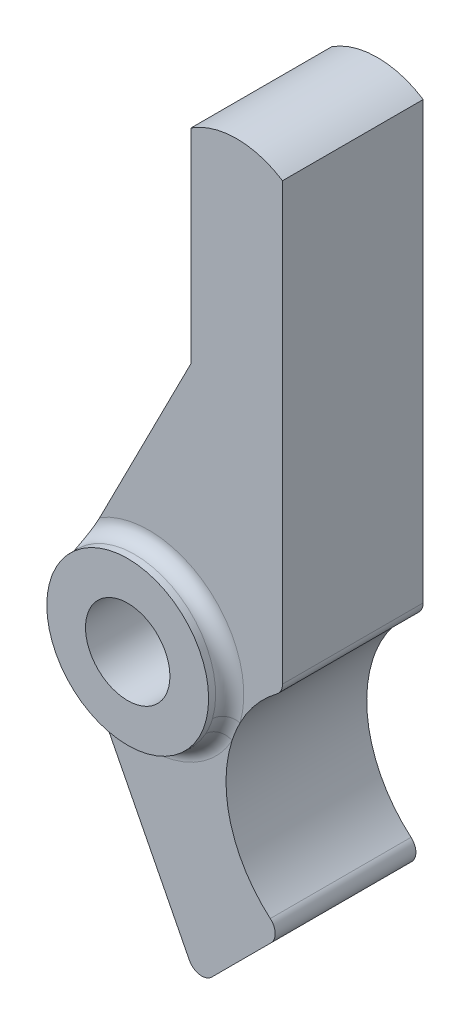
ISO-10303-21;
HEADER;
FILE_DESCRIPTION(('STEP AP214'),'2;1');
FILE_NAME('part.step','',(''),(''),'','','');
FILE_SCHEMA(('AUTOMOTIVE_DESIGN { 1 0 10303 214 1 1 1 1 }'));
ENDSEC;
DATA;
#1=APPLICATION_CONTEXT('core data for automotive mechanical design processes');
#2=APPLICATION_PROTOCOL_DEFINITION('international standard','automotive_design',2000,#1);
#3=PRODUCT_CONTEXT('',#1,'mechanical');
#4=PRODUCT('Part','Part','',(#3));
#5=PRODUCT_RELATED_PRODUCT_CATEGORY('part','',(#4));
#6=PRODUCT_DEFINITION_FORMATION('','',#4);
#7=PRODUCT_DEFINITION_CONTEXT('part definition',#1,'design');
#8=PRODUCT_DEFINITION('design','',#6,#7);
#9=PRODUCT_DEFINITION_SHAPE('','',#8);
#10=(LENGTH_UNIT() NAMED_UNIT(*) SI_UNIT(.MILLI.,.METRE.));
#11=(NAMED_UNIT(*) PLANE_ANGLE_UNIT() SI_UNIT($,.RADIAN.));
#12=(NAMED_UNIT(*) SI_UNIT($,.STERADIAN.) SOLID_ANGLE_UNIT());
#13=UNCERTAINTY_MEASURE_WITH_UNIT(LENGTH_MEASURE(1.E-05),#10,'distance_accuracy_value','');
#14=(GEOMETRIC_REPRESENTATION_CONTEXT(3) GLOBAL_UNCERTAINTY_ASSIGNED_CONTEXT((#13)) GLOBAL_UNIT_ASSIGNED_CONTEXT((#10,
#11,#12)) REPRESENTATION_CONTEXT('',''));
#15=CARTESIAN_POINT('',(0.,0.,0.));
#16=DIRECTION('',(0.,0.,1.));
#17=DIRECTION('',(1.,0.,0.));
#18=AXIS2_PLACEMENT_3D('',#15,#16,#17);
#19=CARTESIAN_POINT('',(10.,-15.,20.));
#20=DIRECTION('',(0.,0.,1.));
#21=DIRECTION('',(1.,0.,0.));
#22=AXIS2_PLACEMENT_3D('',#19,#20,#21);
#23=PLANE('',#22);
#24=DIRECTION('',(-0.45417969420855,-0.890910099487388,0.));
#25=VECTOR('',#24,1.);
#26=CARTESIAN_POINT('',(-13.,34.,20.));
#27=LINE('',#26,#25);
#28=CARTESIAN_POINT('',(-13.,34.,20.));
#29=VERTEX_POINT('',#28);
#30=CARTESIAN_POINT('',(-25.9676183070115,8.56297086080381,20.));
#31=VERTEX_POINT('',#30);
#32=EDGE_CURVE('E195',#29,#31,#27,.T.);
#33=ORIENTED_EDGE('',*,*,#32,.T.);
#34=CARTESIAN_POINT('',(-19.,-3.,20.));
#35=DIRECTION('',(0.,0.,1.));
#36=DIRECTION('',(1.,0.,0.));
#37=AXIS2_PLACEMENT_3D('',#34,#35,#36);
#38=CIRCLE('',#37,13.5);
#39=CARTESIAN_POINT('',(-6.03388619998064,-6.75897498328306,20.));
#40=VERTEX_POINT('',#39);
#41=EDGE_CURVE('E51',#31,#40,#38,.F.);
#42=ORIENTED_EDGE('',*,*,#41,.T.);
#43=CARTESIAN_POINT('',(10.,-15.,20.));
#44=DIRECTION('',(0.,0.,-1.));
#45=DIRECTION('',(1.,0.,0.));
#46=AXIS2_PLACEMENT_3D('',#43,#44,#45);
#47=CIRCLE('',#46,18.0277563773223);
#48=CARTESIAN_POINT('',(-0.801663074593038,-0.566563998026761,20.));
#49=VERTEX_POINT('',#48);
#50=EDGE_CURVE('E184',#40,#49,#47,.T.);
#51=ORIENTED_EDGE('',*,*,#50,.T.);
#52=CARTESIAN_POINT('',(-2.,1.0346819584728,20.));
#53=DIRECTION('',(0.,0.,1.));
#54=DIRECTION('',(1.,0.,0.));
#55=AXIS2_PLACEMENT_3D('',#52,#53,#54);
#56=CIRCLE('',#55,2.);
#57=CARTESIAN_POINT('',(0.,1.0346819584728,20.));
#58=VERTEX_POINT('',#57);
#59=EDGE_CURVE('E228',#49,#58,#56,.T.);
#60=ORIENTED_EDGE('',*,*,#59,.T.);
#61=DIRECTION('',(0.,1.,0.));
#62=VECTOR('',#61,1.);
#63=CARTESIAN_POINT('',(0.,0.,20.));
#64=LINE('',#63,#62);
#65=CARTESIAN_POINT('',(0.,63.,20.));
#66=VERTEX_POINT('',#65);
#67=EDGE_CURVE('E189',#58,#66,#64,.T.);
#68=ORIENTED_EDGE('',*,*,#67,.T.);
#69=CARTESIAN_POINT('',(-6.5,53.,20.));
#70=DIRECTION('',(0.,0.,1.));
#71=DIRECTION('',(1.,0.,0.));
#72=AXIS2_PLACEMENT_3D('',#69,#70,#71);
#73=CIRCLE('',#72,11.9268604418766);
#74=CARTESIAN_POINT('',(-13.,63.,20.));
#75=VERTEX_POINT('',#74);
#76=EDGE_CURVE('E168',#66,#75,#73,.T.);
#77=ORIENTED_EDGE('',*,*,#76,.T.);
#78=DIRECTION('',(0.,-1.,0.));
#79=VECTOR('',#78,1.);
#80=CARTESIAN_POINT('',(-13.,63.,20.));
#81=LINE('',#80,#79);
#82=EDGE_CURVE('E193',#75,#29,#81,.T.);
#83=ORIENTED_EDGE('',*,*,#82,.T.);
#84=EDGE_LOOP('',(#33,#42,#51,#60,#68,#77,#83));
#85=FACE_BOUND('',#84,.T.);
#86=ADVANCED_FACE('F24',(#85),#23,.T.);
#87=CARTESIAN_POINT('',(10.,-15.,0.));
#88=DIRECTION('',(0.,0.,1.));
#89=DIRECTION('',(1.,0.,0.));
#90=AXIS2_PLACEMENT_3D('',#87,#88,#89);
#91=PLANE('',#90);
#92=DIRECTION('',(0.453928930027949,-0.891037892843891,0.));
#93=VECTOR('',#92,1.);
#94=CARTESIAN_POINT('',(-12.0000000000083,-42.,0.));
#95=LINE('',#94,#93);
#96=CARTESIAN_POINT('',(-25.9818521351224,-14.5543818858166,0.));
#97=VERTEX_POINT('',#96);
#98=CARTESIAN_POINT('',(-13.2496499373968,-39.5470048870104,0.));
#99=VERTEX_POINT('',#98);
#100=EDGE_CURVE('E185',#97,#99,#95,.T.);
#101=ORIENTED_EDGE('',*,*,#100,.F.);
#102=CARTESIAN_POINT('',(-19.,-3.,0.));
#103=DIRECTION('',(0.,0.,1.));
#104=DIRECTION('',(1.,0.,0.));
#105=AXIS2_PLACEMENT_3D('',#102,#103,#104);
#106=CIRCLE('',#105,13.5);
#107=CARTESIAN_POINT('',(-7.16890567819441,-9.50193872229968,0.));
#108=VERTEX_POINT('',#107);
#109=EDGE_CURVE('E250',#97,#108,#106,.T.);
#110=ORIENTED_EDGE('',*,*,#109,.T.);
#111=CARTESIAN_POINT('',(10.,-15.,0.));
#112=DIRECTION('',(0.,0.,-1.));
#113=DIRECTION('',(1.,0.,0.));
#114=AXIS2_PLACEMENT_3D('',#111,#112,#113);
#115=CIRCLE('',#114,18.0277563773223);
#116=CARTESIAN_POINT('',(-1.73266811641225,-28.6873846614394,0.));
#117=VERTEX_POINT('',#116);
#118=EDGE_CURVE('E162',#117,#108,#115,.T.);
#119=ORIENTED_EDGE('',*,*,#118,.F.);
#120=CARTESIAN_POINT('',(-3.03429077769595,-30.2058636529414,0.));
#121=DIRECTION('',(0.,0.,1.));
#122=DIRECTION('',(1.,0.,0.));
#123=AXIS2_PLACEMENT_3D('',#120,#121,#122);
#124=CIRCLE('',#123,2.);
#125=CARTESIAN_POINT('',(-1.62007721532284,-31.6200772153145,0.));
#126=VERTEX_POINT('',#125);
#127=EDGE_CURVE('E224',#117,#126,#124,.F.);
#128=ORIENTED_EDGE('',*,*,#127,.T.);
#129=DIRECTION('',(0.707106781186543,0.707106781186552,0.));
#130=VECTOR('',#129,1.);
#131=CARTESIAN_POINT('',(-8.40300051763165E-12,-30.,0.));
#132=LINE('',#131,#130);
#133=CARTESIAN_POINT('',(-10.0533605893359,-40.0533605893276,0.));
#134=VERTEX_POINT('',#133);
#135=EDGE_CURVE('E181',#134,#126,#132,.T.);
#136=ORIENTED_EDGE('',*,*,#135,.F.);
#137=CARTESIAN_POINT('',(-11.467574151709,-38.6391470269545,0.));
#138=DIRECTION('',(0.,0.,1.));
#139=DIRECTION('',(1.,0.,0.));
#140=AXIS2_PLACEMENT_3D('',#137,#138,#139);
#141=CIRCLE('',#140,2.);
#142=EDGE_CURVE('E208',#134,#99,#141,.F.);
#143=ORIENTED_EDGE('',*,*,#142,.T.);
#144=EDGE_LOOP('',(#101,#110,#119,#128,#136,#143));
#145=FACE_BOUND('',#144,.T.);
#146=ADVANCED_FACE('F305',(#145),#91,.F.);
#147=CARTESIAN_POINT('',(-6.03388619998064,-6.75897498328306,0.));
#148=VERTEX_POINT('',#147);
#149=CARTESIAN_POINT('',(-0.801663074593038,-0.566563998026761,0.));
#150=VERTEX_POINT('',#149);
#151=EDGE_CURVE('E330',#148,#150,#115,.T.);
#152=ORIENTED_EDGE('',*,*,#151,.F.);
#153=CARTESIAN_POINT('',(-19.,-3.,0.));
#154=DIRECTION('',(0.,0.,1.));
#155=DIRECTION('',(1.,0.,0.));
#156=AXIS2_PLACEMENT_3D('',#153,#154,#155);
#157=CIRCLE('',#156,13.5);
#158=CARTESIAN_POINT('',(-25.9676183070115,8.5629708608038,0.));
#159=VERTEX_POINT('',#158);
#160=EDGE_CURVE('E375',#148,#159,#157,.T.);
#161=ORIENTED_EDGE('',*,*,#160,.T.);
#162=DIRECTION('',(-0.45417969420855,-0.890910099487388,0.));
#163=VECTOR('',#162,1.);
#164=CARTESIAN_POINT('',(-13.,34.,0.));
#165=LINE('',#164,#163);
#166=CARTESIAN_POINT('',(-13.,34.,0.));
#167=VERTEX_POINT('',#166);
#168=EDGE_CURVE('E177',#167,#159,#165,.T.);
#169=ORIENTED_EDGE('',*,*,#168,.F.);
#170=DIRECTION('',(0.,-1.,0.));
#171=VECTOR('',#170,1.);
#172=CARTESIAN_POINT('',(-13.,63.,0.));
#173=LINE('',#172,#171);
#174=CARTESIAN_POINT('',(-13.,63.,0.));
#175=VERTEX_POINT('',#174);
#176=EDGE_CURVE('E175',#175,#167,#173,.T.);
#177=ORIENTED_EDGE('',*,*,#176,.F.);
#178=CARTESIAN_POINT('',(-6.5,53.,0.));
#179=DIRECTION('',(0.,0.,1.));
#180=DIRECTION('',(1.,0.,0.));
#181=AXIS2_PLACEMENT_3D('',#178,#179,#180);
#182=CIRCLE('',#181,11.9268604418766);
#183=CARTESIAN_POINT('',(0.,63.,0.));
#184=VERTEX_POINT('',#183);
#185=EDGE_CURVE('E161',#184,#175,#182,.T.);
#186=ORIENTED_EDGE('',*,*,#185,.F.);
#187=DIRECTION('',(0.,1.,0.));
#188=VECTOR('',#187,1.);
#189=CARTESIAN_POINT('',(0.,0.,0.));
#190=LINE('',#189,#188);
#191=CARTESIAN_POINT('',(0.,1.0346819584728,0.));
#192=VERTEX_POINT('',#191);
#193=EDGE_CURVE('E150',#192,#184,#190,.T.);
#194=ORIENTED_EDGE('',*,*,#193,.F.);
#195=CARTESIAN_POINT('',(-2.,1.0346819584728,0.));
#196=DIRECTION('',(0.,0.,1.));
#197=DIRECTION('',(1.,0.,0.));
#198=AXIS2_PLACEMENT_3D('',#195,#196,#197);
#199=CIRCLE('',#198,2.);
#200=EDGE_CURVE('E222',#192,#150,#199,.F.);
#201=ORIENTED_EDGE('',*,*,#200,.T.);
#202=EDGE_LOOP('',(#152,#161,#169,#177,#186,#194,#201));
#203=FACE_BOUND('',#202,.T.);
#204=ADVANCED_FACE('F173',(#203),#91,.F.);
#205=CARTESIAN_POINT('',(10.,-15.,20.));
#206=DIRECTION('',(0.,0.,-1.));
#207=DIRECTION('',(-1.,0.,0.));
#208=AXIS2_PLACEMENT_3D('',#205,#206,#207);
#209=CYLINDRICAL_SURFACE('',#208,18.0277563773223);
#210=CARTESIAN_POINT('',(-1.73266811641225,-28.6873846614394,20.));
#211=VERTEX_POINT('',#210);
#212=CARTESIAN_POINT('',(-7.16890567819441,-9.50193872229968,20.));
#213=VERTEX_POINT('',#212);
#214=EDGE_CURVE('E186',#211,#213,#47,.T.);
#215=ORIENTED_EDGE('',*,*,#214,.F.);
#216=DIRECTION('',(0.,0.,-1.));
#217=VECTOR('',#216,1.);
#218=CARTESIAN_POINT('',(-1.73266811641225,-28.6873846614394,20.));
#219=LINE('',#218,#217);
#220=EDGE_CURVE('E219',#211,#117,#219,.T.);
#221=ORIENTED_EDGE('',*,*,#220,.T.);
#222=ORIENTED_EDGE('',*,*,#118,.T.);
#223=EDGE_CURVE('E332',#108,#148,#115,.T.);
#224=ORIENTED_EDGE('',*,*,#223,.T.);
#225=ORIENTED_EDGE('',*,*,#151,.T.);
#226=DIRECTION('',(0.,0.,-1.));
#227=VECTOR('',#226,1.);
#228=CARTESIAN_POINT('',(-0.801663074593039,-0.566563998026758,20.));
#229=LINE('',#228,#227);
#230=EDGE_CURVE('E216',#150,#49,#229,.F.);
#231=ORIENTED_EDGE('',*,*,#230,.T.);
#232=ORIENTED_EDGE('',*,*,#50,.F.);
#233=EDGE_CURVE('E190',#213,#40,#47,.T.);
#234=ORIENTED_EDGE('',*,*,#233,.F.);
#235=EDGE_LOOP('',(#215,#221,#222,#224,#225,#231,#232,#234));
#236=FACE_BOUND('',#235,.T.);
#237=ADVANCED_FACE('F304',(#236),#209,.F.);
#238=CARTESIAN_POINT('',(0.,0.,20.));
#239=DIRECTION('',(-1.,0.,0.));
#240=DIRECTION('',(0.,0.,1.));
#241=AXIS2_PLACEMENT_3D('',#238,#239,#240);
#242=PLANE('',#241);
#243=ORIENTED_EDGE('',*,*,#67,.F.);
#244=DIRECTION('',(0.,0.,-1.));
#245=VECTOR('',#244,1.);
#246=CARTESIAN_POINT('',(0.,1.0346819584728,20.));
#247=LINE('',#246,#245);
#248=EDGE_CURVE('E157',#58,#192,#247,.T.);
#249=ORIENTED_EDGE('',*,*,#248,.T.);
#250=ORIENTED_EDGE('',*,*,#193,.T.);
#251=DIRECTION('',(0.,0.,-1.));
#252=VECTOR('',#251,1.);
#253=CARTESIAN_POINT('',(0.,63.,20.));
#254=LINE('',#253,#252);
#255=EDGE_CURVE('E154',#66,#184,#254,.T.);
#256=ORIENTED_EDGE('',*,*,#255,.F.);
#257=EDGE_LOOP('',(#243,#249,#250,#256));
#258=FACE_BOUND('',#257,.T.);
#259=ADVANCED_FACE('F153',(#258),#242,.F.);
#260=CARTESIAN_POINT('',(-6.5,53.,20.));
#261=DIRECTION('',(0.,0.,-1.));
#262=DIRECTION('',(-1.,0.,0.));
#263=AXIS2_PLACEMENT_3D('',#260,#261,#262);
#264=CYLINDRICAL_SURFACE('',#263,11.9268604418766);
#265=ORIENTED_EDGE('',*,*,#185,.T.);
#266=DIRECTION('',(0.,0.,-1.));
#267=VECTOR('',#266,1.);
#268=CARTESIAN_POINT('',(-13.,63.,20.));
#269=LINE('',#268,#267);
#270=EDGE_CURVE('E170',#75,#175,#269,.T.);
#271=ORIENTED_EDGE('',*,*,#270,.F.);
#272=ORIENTED_EDGE('',*,*,#76,.F.);
#273=ORIENTED_EDGE('',*,*,#255,.T.);
#274=EDGE_LOOP('',(#265,#271,#272,#273));
#275=FACE_BOUND('',#274,.T.);
#276=ADVANCED_FACE('F165',(#275),#264,.T.);
#277=CARTESIAN_POINT('',(-13.,63.,20.));
#278=DIRECTION('',(1.,0.,0.));
#279=DIRECTION('',(0.,1.,0.));
#280=AXIS2_PLACEMENT_3D('',#277,#278,#279);
#281=PLANE('',#280);
#282=ORIENTED_EDGE('',*,*,#176,.T.);
#283=DIRECTION('',(0.,0.,-1.));
#284=VECTOR('',#283,1.);
#285=CARTESIAN_POINT('',(-13.,34.,20.));
#286=LINE('',#285,#284);
#287=EDGE_CURVE('E201',#29,#167,#286,.T.);
#288=ORIENTED_EDGE('',*,*,#287,.F.);
#289=ORIENTED_EDGE('',*,*,#82,.F.);
#290=ORIENTED_EDGE('',*,*,#270,.T.);
#291=EDGE_LOOP('',(#282,#288,#289,#290));
#292=FACE_BOUND('',#291,.T.);
#293=ADVANCED_FACE('F469',(#292),#281,.F.);
#294=CARTESIAN_POINT('',(-13.,34.,20.));
#295=DIRECTION('',(0.890910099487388,-0.45417969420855,0.));
#296=DIRECTION('',(0.45417969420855,0.890910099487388,0.));
#297=AXIS2_PLACEMENT_3D('',#294,#295,#296);
#298=PLANE('',#297);
#299=ORIENTED_EDGE('',*,*,#168,.T.);
#300=CARTESIAN_POINT('',(-25.9676183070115,8.56297086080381,0.));
#301=CARTESIAN_POINT('',(-26.0276865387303,8.44514217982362,-1.97143339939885E-05));
#302=CARTESIAN_POINT('',(-26.087736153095,8.32735001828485,-0.00366549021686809));
#303=CARTESIAN_POINT('',(-26.2076499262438,8.09212948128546,-0.0174742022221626));
#304=CARTESIAN_POINT('',(-26.2675141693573,7.97470094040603,-0.0276335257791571));
#305=CARTESIAN_POINT('',(-26.3868407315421,7.74063226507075,-0.0537064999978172));
#306=CARTESIAN_POINT('',(-26.4463036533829,7.62399094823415,-0.0696070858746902));
#307=CARTESIAN_POINT('',(-26.5649029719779,7.39134881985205,-0.106565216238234));
#308=CARTESIAN_POINT('',(-26.6240393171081,7.27534810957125,-0.127623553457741));
#309=CARTESIAN_POINT('',(-26.8001634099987,6.92986649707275,-0.197430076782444));
#310=CARTESIAN_POINT('',(-26.9165998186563,6.70146709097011,-0.252983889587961));
#311=CARTESIAN_POINT('',(-27.1478360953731,6.24787848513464,-0.37883083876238));
#312=CARTESIAN_POINT('',(-27.2626351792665,6.02269082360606,-0.449130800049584));
#313=CARTESIAN_POINT('',(-27.4609086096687,5.63376149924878,-0.582001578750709));
#314=CARTESIAN_POINT('',(-27.5447667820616,5.46926693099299,-0.641829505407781));
#315=CARTESIAN_POINT('',(-27.7115894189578,5.14203087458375,-0.767402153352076));
#316=CARTESIAN_POINT('',(-27.7945536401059,4.9792898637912,-0.833148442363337));
#317=CARTESIAN_POINT('',(-27.9328337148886,4.70804234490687,-0.948038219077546));
#318=CARTESIAN_POINT('',(-27.9884099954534,4.59902498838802,-0.995670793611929));
#319=CARTESIAN_POINT('',(-28.0990819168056,4.38193308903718,-1.09358405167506));
#320=CARTESIAN_POINT('',(-28.1541775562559,4.27385854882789,-1.14386474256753));
#321=CARTESIAN_POINT('',(-28.2453466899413,4.09502294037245,-1.23011400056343));
#322=CARTESIAN_POINT('',(-28.2815898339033,4.02392909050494,-1.26521309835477));
#323=CARTESIAN_POINT('',(-28.3537254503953,3.88242926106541,-1.33710762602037));
#324=CARTESIAN_POINT('',(-28.3896179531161,3.81202322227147,-1.37390290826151));
#325=CARTESIAN_POINT('',(-28.4487837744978,3.6959646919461,-1.43696031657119));
#326=CARTESIAN_POINT('',(-28.4722022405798,3.65002748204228,-1.46255484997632));
#327=CARTESIAN_POINT('',(-28.5186854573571,3.55884690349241,-1.51516562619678));
#328=CARTESIAN_POINT('',(-28.5417503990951,3.51360316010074,-1.54218106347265));
#329=CARTESIAN_POINT('',(-28.5948569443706,3.40943038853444,-1.60739956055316));
#330=CARTESIAN_POINT('',(-28.6247168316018,3.35085781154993,-1.64637481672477));
#331=CARTESIAN_POINT('',(-28.6669650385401,3.26798454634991,-1.70920005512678));
#332=CARTESIAN_POINT('',(-28.6802388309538,3.2419469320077,-1.73014264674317));
#333=CARTESIAN_POINT('',(-28.70584304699,3.19172219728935,-1.77467922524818));
#334=CARTESIAN_POINT('',(-28.7181759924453,3.16753013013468,-1.7982656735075));
#335=CARTESIAN_POINT('',(-28.7341918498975,3.13611373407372,-1.83495830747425));
#336=CARTESIAN_POINT('',(-28.7387411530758,3.12718990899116,-1.84620311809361));
#337=CARTESIAN_POINT('',(-28.7472714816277,3.11045698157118,-1.86972668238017));
#338=CARTESIAN_POINT('',(-28.751252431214,3.10264802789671,-1.8820055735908));
#339=CARTESIAN_POINT('',(-28.7576243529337,3.09014898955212,-1.90519009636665));
#340=CARTESIAN_POINT('',(-28.7601740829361,3.08514748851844,-1.91588024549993));
#341=CARTESIAN_POINT('',(-28.7644640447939,3.07673238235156,-1.93800011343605));
#342=CARTESIAN_POINT('',(-28.7662079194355,3.07331163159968,-1.9494262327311));
#343=CARTESIAN_POINT('',(-28.7680927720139,3.06961434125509,-1.96746965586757));
#344=CARTESIAN_POINT('',(-28.7686020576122,3.06861533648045,-1.97390338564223));
#345=CARTESIAN_POINT('',(-28.7692899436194,3.06726599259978,-1.98688866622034));
#346=CARTESIAN_POINT('',(-28.7694668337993,3.06691900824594,-1.99344065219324));
#347=CARTESIAN_POINT('',(-28.769464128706,3.06692431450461,-2.));
#348=B_SPLINE_CURVE_WITH_KNOTS('',3,(#300,#301,#302,#303,#304,#305,#306,#307,#308,#309,#310,
#311,#312,#313,#314,#315,#316,#317,#318,#319,#320,#321,#322,#323,#324,#325,#326,#327,#328,#329,
#330,#331,#332,#333,#334,#335,#336,#337,#338,#339,#340,#341,#342,#343,#344,#345,#346,#347),
.UNSPECIFIED.,.F.,.F.,(4,2,2,2,2,2,2,2,2,2,2,2,2,2,2,2,2,2,2,2,2,2,2,4),(0.,0.396660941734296,
0.793102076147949,1.18864669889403,1.58425215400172,2.37060135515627,3.15731530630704,
3.73947842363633,4.32179620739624,4.71570225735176,5.10960940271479,5.37112625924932,
5.63262039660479,5.8052908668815,5.97786448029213,6.20680091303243,6.3146143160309,
6.42212776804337,6.46724874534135,6.51237573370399,6.54849036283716,6.58444010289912,
6.60399360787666,6.62364744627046),.UNSPECIFIED.);
#349=CARTESIAN_POINT('',(-28.769464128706,3.06692431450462,-2.));
#350=VERTEX_POINT('',#349);
#351=EDGE_CURVE('E261',#159,#350,#348,.T.);
#352=ORIENTED_EDGE('',*,*,#351,.T.);
#353=DIRECTION('',(0.,0.,-1.));
#354=VECTOR('',#353,1.);
#355=CARTESIAN_POINT('',(-28.769464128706,3.06692431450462,20.));
#356=LINE('',#355,#354);
#357=CARTESIAN_POINT('',(-28.769464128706,3.06692431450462,22.));
#358=VERTEX_POINT('',#357);
#359=EDGE_CURVE('E204',#358,#350,#356,.T.);
#360=ORIENTED_EDGE('',*,*,#359,.F.);
#361=CARTESIAN_POINT('',(-28.769464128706,3.06692431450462,22.));
#362=CARTESIAN_POINT('',(-28.7694806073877,3.06689199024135,21.9893655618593));
#363=CARTESIAN_POINT('',(-28.7690071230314,3.06782076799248,21.9787840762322));
#364=CARTESIAN_POINT('',(-28.7672405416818,3.07128605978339,21.9581266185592));
#365=CARTESIAN_POINT('',(-28.7659607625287,3.07379644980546,21.9480452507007));
#366=CARTESIAN_POINT('',(-28.7621106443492,3.08134876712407,21.9246490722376));
#367=CARTESIAN_POINT('',(-28.7592329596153,3.08699357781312,21.9115863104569));
#368=CARTESIAN_POINT('',(-28.7525978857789,3.10000881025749,21.8865120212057));
#369=CARTESIAN_POINT('',(-28.7488338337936,3.10739230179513,21.8745094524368));
#370=CARTESIAN_POINT('',(-28.734059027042,3.13637427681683,21.8323270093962));
#371=CARTESIAN_POINT('',(-28.7213917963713,3.1612220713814,21.805050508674));
#372=CARTESIAN_POINT('',(-28.6946318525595,3.21371385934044,21.7541976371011));
#373=CARTESIAN_POINT('',(-28.6805302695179,3.24137525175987,21.7306469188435));
#374=CARTESIAN_POINT('',(-28.6500731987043,3.30111925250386,21.6834524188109));
#375=CARTESIAN_POINT('',(-28.6336366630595,3.333360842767,21.6600594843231));
#376=CARTESIAN_POINT('',(-28.6002748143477,3.39880279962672,21.6150145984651));
#377=CARTESIAN_POINT('',(-28.5833490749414,3.43200400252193,21.5933642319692));
#378=CARTESIAN_POINT('',(-28.5320540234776,3.53262338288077,21.5300953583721));
#379=CARTESIAN_POINT('',(-28.4972337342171,3.60092618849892,21.4902541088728));
#380=CARTESIAN_POINT('',(-28.426981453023,3.73873170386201,21.4131985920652));
#381=CARTESIAN_POINT('',(-28.3915490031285,3.80823531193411,21.3759864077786));
#382=CARTESIAN_POINT('',(-28.320341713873,3.94791415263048,21.3034727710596));
#383=CARTESIAN_POINT('',(-28.2845674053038,4.01808834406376,21.2681687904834));
#384=CARTESIAN_POINT('',(-28.1766366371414,4.2298032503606,21.1642059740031));
#385=CARTESIAN_POINT('',(-28.1040550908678,4.37217780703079,21.0976897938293));
#386=CARTESIAN_POINT('',(-27.9580650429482,4.65854906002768,20.9691705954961));
#387=CARTESIAN_POINT('',(-27.8846564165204,4.8025460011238,20.9071682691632));
#388=CARTESIAN_POINT('',(-27.7369905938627,5.09220442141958,20.7875439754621));
#389=CARTESIAN_POINT('',(-27.6627323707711,5.23786791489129,20.7299281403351));
#390=CARTESIAN_POINT('',(-27.5134889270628,5.53062096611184,20.619490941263));
#391=CARTESIAN_POINT('',(-27.4385037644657,5.67771041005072,20.5666691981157));
#392=CARTESIAN_POINT('',(-27.288220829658,5.97250250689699,20.4666554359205));
#393=CARTESIAN_POINT('',(-27.212927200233,6.12019703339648,20.4194333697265));
#394=CARTESIAN_POINT('',(-27.0616069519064,6.41702390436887,20.3309864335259));
#395=CARTESIAN_POINT('',(-26.9855802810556,6.56615635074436,20.2897619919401));
#396=CARTESIAN_POINT('',(-26.8329321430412,6.86558798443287,20.2142375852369));
#397=CARTESIAN_POINT('',(-26.7563117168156,7.01588512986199,20.1799275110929));
#398=CARTESIAN_POINT('',(-26.6024316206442,7.31773334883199,20.1191871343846));
#399=CARTESIAN_POINT('',(-26.5251720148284,7.46928429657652,20.0927560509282));
#400=CARTESIAN_POINT('',(-26.3681737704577,7.77724901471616,20.0484374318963));
#401=CARTESIAN_POINT('',(-26.2884213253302,7.93368986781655,20.0307791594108));
#402=CARTESIAN_POINT('',(-26.1684189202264,8.1690842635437,20.0126150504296));
#403=CARTESIAN_POINT('',(-26.1282952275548,8.24779012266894,20.0079468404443));
#404=CARTESIAN_POINT('',(-26.0479891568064,8.40531695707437,20.0016407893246));
#405=CARTESIAN_POINT('',(-26.0078067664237,8.48413795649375,20.0000037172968));
#406=CARTESIAN_POINT('',(-25.9676183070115,8.56297086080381,20.));
#407=B_SPLINE_CURVE_WITH_KNOTS('',3,(#361,#362,#363,#364,#365,#366,#367,#368,#369,#370,#371,
#372,#373,#374,#375,#376,#377,#378,#379,#380,#381,#382,#383,#384,#385,#386,#387,#388,#389,#390,
#391,#392,#393,#394,#395,#396,#397,#398,#399,#400,#401,#402,#403,#404,#405,#406),.UNSPECIFIED.,
.F.,.F.,(4,2,2,2,2,2,2,2,2,2,2,2,2,2,2,2,2,2,2,2,2,2,4),(0.,0.0317673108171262,
0.0630231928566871,0.106330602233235,0.149974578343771,0.266074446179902,0.382941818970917,
0.512103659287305,0.641381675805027,0.900462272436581,1.15974588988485,1.41867711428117,
1.9378781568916,2.45715860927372,2.97715216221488,3.49710454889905,4.01412690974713,
4.53118618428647,5.04748392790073,5.56373048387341,6.0928389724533,6.35819224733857,
6.62361284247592),.UNSPECIFIED.);
#408=EDGE_CURVE('E38',#358,#31,#407,.T.);
#409=ORIENTED_EDGE('',*,*,#408,.T.);
#410=ORIENTED_EDGE('',*,*,#32,.F.);
#411=ORIENTED_EDGE('',*,*,#287,.T.);
#412=EDGE_LOOP('',(#299,#352,#360,#409,#410,#411));
#413=FACE_BOUND('',#412,.T.);
#414=ADVANCED_FACE('F391',(#413),#298,.F.);
#415=CARTESIAN_POINT('',(-19.,-3.,20.));
#416=DIRECTION('',(0.,0.,-1.));
#417=DIRECTION('',(-1.,0.,0.));
#418=AXIS2_PLACEMENT_3D('',#415,#416,#417);
#419=CYLINDRICAL_SURFACE('',#418,11.5);
#420=CARTESIAN_POINT('',(-19.,-3.,-2.));
#421=DIRECTION('',(0.,0.,1.));
#422=DIRECTION('',(1.,0.,0.));
#423=AXIS2_PLACEMENT_3D('',#420,#421,#422);
#424=CIRCLE('',#423,11.5);
#425=CARTESIAN_POINT('',(-8.92166039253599,-8.53868854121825,-2.));
#426=VERTEX_POINT('',#425);
#427=CARTESIAN_POINT('',(-28.8152737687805,-8.99252875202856,-2.));
#428=VERTEX_POINT('',#427);
#429=EDGE_CURVE('E376',#426,#428,#424,.F.);
#430=ORIENTED_EDGE('',*,*,#429,.T.);
#431=DIRECTION('',(0.,0.,-1.));
#432=VECTOR('',#431,1.);
#433=CARTESIAN_POINT('',(-28.8152737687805,-8.99252875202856,20.));
#434=LINE('',#433,#432);
#435=CARTESIAN_POINT('',(-28.8152737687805,-8.99252875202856,22.));
#436=VERTEX_POINT('',#435);
#437=EDGE_CURVE('E199',#436,#428,#434,.T.);
#438=ORIENTED_EDGE('',*,*,#437,.F.);
#439=CARTESIAN_POINT('',(-19.,-3.,22.));
#440=DIRECTION('',(0.,0.,1.));
#441=DIRECTION('',(1.,0.,0.));
#442=AXIS2_PLACEMENT_3D('',#439,#440,#441);
#443=CIRCLE('',#442,11.5);
#444=CARTESIAN_POINT('',(-8.92166039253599,-8.53868854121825,22.));
#445=VERTEX_POINT('',#444);
#446=EDGE_CURVE('E233',#436,#445,#443,.T.);
#447=ORIENTED_EDGE('',*,*,#446,.T.);
#448=CARTESIAN_POINT('',(-11.2714260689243,-11.5158173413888,20.0000000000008));
#449=CARTESIAN_POINT('',(-10.253880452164,-10.5923385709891,20.));
#450=CARTESIAN_POINT('',(-9.02689822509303,-11.2109876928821,19.9999999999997));
#451=CARTESIAN_POINT('',(-7.79991599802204,-11.8296368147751,19.9999999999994));
#452=CARTESIAN_POINT('',(-7.93735534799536,-13.1968685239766,20.));
#453=CARTESIAN_POINT('',(-11.2714350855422,-11.5158234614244,20.0421178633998));
#454=CARTESIAN_POINT('',(-10.2538539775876,-10.5923196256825,19.9988885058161));
#455=CARTESIAN_POINT('',(-9.02686454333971,-11.2109698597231,19.9833873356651));
#456=CARTESIAN_POINT('',(-7.79987775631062,-11.8296203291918,19.9678879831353));
#457=CARTESIAN_POINT('',(-7.93735537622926,-13.1968748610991,20.));
#458=CARTESIAN_POINT('',(-11.270172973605,-11.5146800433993,20.0842291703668));
#459=CARTESIAN_POINT('',(-10.2545540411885,-10.5926768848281,19.9977982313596));
#460=CARTESIAN_POINT('',(-9.02820199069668,-11.2111483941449,19.966800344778));
#461=CARTESIAN_POINT('',(-7.80184972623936,-11.8296198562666,19.9358087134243));
#462=CARTESIAN_POINT('',(-7.93722248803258,-13.1955469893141,20.));
#463=CARTESIAN_POINT('',(-11.2651752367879,-11.5101413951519,20.1680549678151));
#464=CARTESIAN_POINT('',(-10.2572086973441,-10.5940024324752,19.9962707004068));
#465=CARTESIAN_POINT('',(-9.03336731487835,-11.2117657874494,19.934473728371));
#466=CARTESIAN_POINT('',(-7.80952431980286,-11.8295289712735,19.8726819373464));
#467=CARTESIAN_POINT('',(-7.93669137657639,-13.1902720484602,20.));
#468=CARTESIAN_POINT('',(-11.2614411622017,-11.5067475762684,20.209769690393));
#469=CARTESIAN_POINT('',(-10.2591615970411,-10.5949698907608,19.9958330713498));
#470=CARTESIAN_POINT('',(-9.03719363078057,-11.2122044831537,19.9187335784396));
#471=CARTESIAN_POINT('',(-7.81522194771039,-11.8294386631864,19.8416444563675));
#472=CARTESIAN_POINT('',(-7.93629331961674,-13.1863266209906,20.));
#473=CARTESIAN_POINT('',(-11.251605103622,-11.4977889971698,20.2921622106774));
#474=CARTESIAN_POINT('',(-10.2641016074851,-10.5973640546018,19.9962150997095));
#475=CARTESIAN_POINT('',(-9.04704836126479,-11.2132063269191,19.888985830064));
#476=CARTESIAN_POINT('',(-7.82999199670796,-11.829048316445,19.7817668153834));
#477=CARTESIAN_POINT('',(-7.93523634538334,-13.175904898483,20.));
#478=CARTESIAN_POINT('',(-11.2455210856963,-11.4922407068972,20.3328454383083));
#479=CARTESIAN_POINT('',(-10.2670793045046,-10.5987865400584,19.9970244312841));
#480=CARTESIAN_POINT('',(-9.05306004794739,-11.213768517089,19.8749661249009));
#481=CARTESIAN_POINT('',(-7.83903396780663,-11.8287500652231,19.752920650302));
#482=CARTESIAN_POINT('',(-7.93457940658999,-13.1694478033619,20.));
#483=CARTESIAN_POINT('',(-11.2311122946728,-11.4790612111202,20.4131788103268));
#484=CARTESIAN_POINT('',(-10.2737234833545,-10.6018449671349,20.0003167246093));
#485=CARTESIAN_POINT('',(-9.06684972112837,-11.2147912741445,19.849107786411));
#486=CARTESIAN_POINT('',(-7.8599688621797,-11.8277369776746,19.6979121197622));
#487=CARTESIAN_POINT('',(-7.93300568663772,-13.1540947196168,20.));
#488=CARTESIAN_POINT('',(-11.2227872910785,-11.4714297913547,20.4528288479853));
#489=CARTESIAN_POINT('',(-10.2773883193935,-10.6034802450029,20.0027976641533));
#490=CARTESIAN_POINT('',(-9.07462788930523,-11.2152518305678,19.8372693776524));
#491=CARTESIAN_POINT('',(-7.87185598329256,-11.8270226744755,19.6717557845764));
#492=CARTESIAN_POINT('',(-7.93208887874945,-13.1451984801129,20.));
#493=CARTESIAN_POINT('',(-11.1947149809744,-11.4456009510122,20.5696318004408));
#494=CARTESIAN_POINT('',(-10.288787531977,-10.6082637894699,20.0132160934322));
#495=CARTESIAN_POINT('',(-9.09981027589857,-11.2160810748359,19.8057605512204));
#496=CARTESIAN_POINT('',(-7.91079052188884,-11.8238976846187,19.5983575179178));
#497=CARTESIAN_POINT('',(-7.92895389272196,-13.1150532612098,20.));
#498=CARTESIAN_POINT('',(-11.1718383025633,-11.4244401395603,20.644895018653));
#499=CARTESIAN_POINT('',(-10.2969526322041,-10.6113046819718,20.0241173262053));
#500=CARTESIAN_POINT('',(-9.11909882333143,-11.2159035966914,19.7899988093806));
#501=CARTESIAN_POINT('',(-7.94117411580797,-11.8205097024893,19.5559137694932));
#502=CARTESIAN_POINT('',(-7.92634788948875,-13.0903144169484,20.));
#503=CARTESIAN_POINT('',(-11.1192072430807,-11.375225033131,20.7887514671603));
#504=CARTESIAN_POINT('',(-10.3111571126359,-10.6147062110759,20.0543315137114));
#505=CARTESIAN_POINT('',(-9.15841220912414,-11.211927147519,19.77003991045));
#506=CARTESIAN_POINT('',(-8.00559761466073,-11.8091551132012,19.4857862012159));
#507=CARTESIAN_POINT('',(-7.92010333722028,-13.0325817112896,20.));
#508=CARTESIAN_POINT('',(-11.0894408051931,-11.3471586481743,20.8573327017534));
#509=CARTESIAN_POINT('',(-10.3171943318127,-10.6150702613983,20.0736164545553));
#510=CARTESIAN_POINT('',(-9.17843828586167,-11.2081217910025,19.7658631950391));
#511=CARTESIAN_POINT('',(-8.03960364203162,-11.8012016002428,19.4581053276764));
#512=CARTESIAN_POINT('',(-7.91646297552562,-12.9995733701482,20.));
#513=CARTESIAN_POINT('',(-11.0350817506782,-11.2952396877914,20.966107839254));
#514=CARTESIAN_POINT('',(-10.3234994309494,-10.6118824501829,20.1117235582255));
#515=CARTESIAN_POINT('',(-9.20974868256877,-11.1973568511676,19.7674362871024));
#516=CARTESIAN_POINT('',(-8.09596029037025,-11.7828433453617,19.4231475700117));
#517=CARTESIAN_POINT('',(-7.90949206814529,-12.9382737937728,20.));
#518=CARTESIAN_POINT('',(-11.0119059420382,-11.2729368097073,21.0083356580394));
#519=CARTESIAN_POINT('',(-10.3250022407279,-10.6095621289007,20.1286641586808));
#520=CARTESIAN_POINT('',(-9.22177251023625,-11.1918060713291,19.7704246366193));
#521=CARTESIAN_POINT('',(-8.11850816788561,-11.7740714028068,19.4121700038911));
#522=CARTESIAN_POINT('',(-7.90643869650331,-12.9118819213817,20.));
#523=CARTESIAN_POINT('',(-10.9635790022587,-11.2260000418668,21.0893118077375));
#524=CARTESIAN_POINT('',(-10.3255003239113,-10.6025035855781,20.1649706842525));
#525=CARTESIAN_POINT('',(-9.24388351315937,-11.1780279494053,19.7803753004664));
#526=CARTESIAN_POINT('',(-8.16223220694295,-11.7535739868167,19.3957639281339));
#527=CARTESIAN_POINT('',(-7.89985658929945,-12.8561896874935,20.));
#528=CARTESIAN_POINT('',(-10.9384272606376,-11.2013654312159,21.128059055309));
#529=CARTESIAN_POINT('',(-10.3245025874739,-10.5977728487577,20.1843262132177));
#530=CARTESIAN_POINT('',(-9.25397008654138,-11.1697997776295,19.7873388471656));
#531=CARTESIAN_POINT('',(-8.18340789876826,-11.7418588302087,19.3903214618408));
#532=CARTESIAN_POINT('',(-7.89632770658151,-12.8268884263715,20.));
#533=CARTESIAN_POINT('',(-10.8605679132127,-11.1243425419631,21.2392080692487));
#534=CARTESIAN_POINT('',(-10.3173679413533,-10.5796135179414,20.2448706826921));
#535=CARTESIAN_POINT('',(-9.28058988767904,-11.140806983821,19.8130158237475));
#536=CARTESIAN_POINT('',(-8.243696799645,-11.7021261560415,19.3810527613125));
#537=CARTESIAN_POINT('',(-7.88501148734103,-12.7350147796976,20.));
#538=CARTESIAN_POINT('',(-10.8054954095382,-11.068872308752,21.306441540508));
#539=CARTESIAN_POINT('',(-10.3071174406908,-10.562217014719,20.2886573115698));
#540=CARTESIAN_POINT('',(-9.29345954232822,-11.1157408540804,19.836511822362));
#541=CARTESIAN_POINT('',(-8.2797533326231,-11.669475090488,19.384185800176));
#542=CARTESIAN_POINT('',(-7.87649940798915,-12.668516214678,20.));
#543=CARTESIAN_POINT('',(-10.7059355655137,-10.9663226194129,21.4129916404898));
#544=CARTESIAN_POINT('',(-10.2796737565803,-10.522216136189,20.3667664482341));
#545=CARTESIAN_POINT('',(-9.30642932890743,-11.0619714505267,19.8835661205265));
#546=CARTESIAN_POINT('',(-8.3331544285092,-11.601845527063,19.4002591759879));
#547=CARTESIAN_POINT('',(-7.85987486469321,-12.5448509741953,20.));
#548=CARTESIAN_POINT('',(-10.662190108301,-10.9205508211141,21.455102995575));
#549=CARTESIAN_POINT('',(-10.264873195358,-10.5020200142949,20.4007001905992));
#550=CARTESIAN_POINT('',(-9.3088970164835,-11.035692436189,19.9056780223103));
#551=CARTESIAN_POINT('',(-8.35292288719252,-11.5695154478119,19.410536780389));
#552=CARTESIAN_POINT('',(-7.85218220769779,-12.4894313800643,20.));
#553=CARTESIAN_POINT('',(-10.5735152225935,-10.8261448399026,21.5327602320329));
#554=CARTESIAN_POINT('',(-10.2298965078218,-10.455881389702,20.4678695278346));
#555=CARTESIAN_POINT('',(-9.30799028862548,-10.9772349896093,19.951757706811));
#556=CARTESIAN_POINT('',(-8.38608667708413,-11.4987383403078,19.4355282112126));
#557=CARTESIAN_POINT('',(-7.83566291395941,-12.374645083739,20.));
#558=CARTESIAN_POINT('',(-10.5285851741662,-10.7775091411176,21.5683025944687));
#559=CARTESIAN_POINT('',(-10.2097444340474,-10.4299644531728,20.5011094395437));
#560=CARTESIAN_POINT('',(-9.3046127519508,-10.9450534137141,19.9757264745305));
#561=CARTESIAN_POINT('',(-8.3995117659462,-11.4603181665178,19.4502221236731));
#562=CARTESIAN_POINT('',(-7.8268356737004,-12.3152762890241,20.));
#563=CARTESIAN_POINT('',(-10.4382045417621,-10.6779024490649,21.6334923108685));
#564=CARTESIAN_POINT('',(-10.164917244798,-10.3728897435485,20.5657965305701));
#565=CARTESIAN_POINT('',(-9.29258532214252,-10.8753707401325,20.0240527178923));
#566=CARTESIAN_POINT('',(-8.42028321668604,-11.3780265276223,19.4821871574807));
#567=CARTESIAN_POINT('',(-7.80802408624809,-12.1932057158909,20.));
#568=CARTESIAN_POINT('',(-10.3927537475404,-10.6269304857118,21.6631371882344));
#569=CARTESIAN_POINT('',(-10.1402603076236,-10.3417527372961,20.5972556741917));
#570=CARTESIAN_POINT('',(-9.28393322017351,-10.8378674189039,20.0484103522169));
#571=CARTESIAN_POINT('',(-8.42765868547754,-11.334175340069,19.4994482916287));
#572=CARTESIAN_POINT('',(-7.79803925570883,-12.1305025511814,20.));
#573=CARTESIAN_POINT('',(-10.3018066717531,-10.5230451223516,21.71722231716));
#574=CARTESIAN_POINT('',(-10.0873006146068,-10.2747966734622,20.6577406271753));
#575=CARTESIAN_POINT('',(-9.26206153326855,-10.7581490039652,20.0965239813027));
#576=CARTESIAN_POINT('',(-8.43687611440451,-11.2416952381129,19.5351904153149));
#577=CARTESIAN_POINT('',(-7.77688665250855,-12.0022453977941,20.));
#578=CARTESIAN_POINT('',(-10.2563103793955,-10.4701309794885,21.7416605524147));
#579=CARTESIAN_POINT('',(-10.0590095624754,-10.2389927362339,20.6867824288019));
#580=CARTESIAN_POINT('',(-9.24884018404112,-10.7159320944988,20.1202797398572));
#581=CARTESIAN_POINT('',(-8.43874348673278,-11.1930796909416,19.553669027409));
#582=CARTESIAN_POINT('',(-7.76571842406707,-11.9366903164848,20.));
#583=CARTESIAN_POINT('',(-10.1247928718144,-10.3142678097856,21.8059624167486));
#584=CARTESIAN_POINT('',(-9.97301632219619,-10.1293422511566,20.766801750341));
#585=CARTESIAN_POINT('',(-9.20489460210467,-10.5874693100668,20.1873243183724));
#586=CARTESIAN_POINT('',(-8.43702123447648,-11.0463303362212,19.6074625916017));
#587=CARTESIAN_POINT('',(-7.73156247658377,-11.7429658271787,20.));
#588=CARTESIAN_POINT('',(-10.0391857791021,-10.2091856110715,21.8398900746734));
#589=CARTESIAN_POINT('',(-9.91147215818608,-10.049903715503,20.8143862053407));
#590=CARTESIAN_POINT('',(-9.16913233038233,-10.495819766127,20.2289313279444));
#591=CARTESIAN_POINT('',(-8.42711034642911,-10.9425027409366,19.6431773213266));
#592=CARTESIAN_POINT('',(-7.70699040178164,-11.6115894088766,20.));
#593=CARTESIAN_POINT('',(-9.87066948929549,-9.99456965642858,21.895354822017));
#594=CARTESIAN_POINT('',(-9.78273780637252,-9.87922849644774,20.8990448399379));
#595=CARTESIAN_POINT('',(-9.08797620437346,-10.3009564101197,20.3053778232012));
#596=CARTESIAN_POINT('',(-8.39353658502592,-10.7234537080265,19.7114072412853));
#597=CARTESIAN_POINT('',(-7.6532827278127,-11.3420580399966,20.));
#598=CARTESIAN_POINT('',(-9.78776296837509,-9.88503171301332,21.9168799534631));
#599=CARTESIAN_POINT('',(-9.71552737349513,-9.78799462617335,20.9362301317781));
#600=CARTESIAN_POINT('',(-9.04257311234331,-10.1977315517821,20.3402107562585));
#601=CARTESIAN_POINT('',(-8.36995286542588,-10.608210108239,19.7439757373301));
#602=CARTESIAN_POINT('',(-7.6241427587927,-11.2038966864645,20.));
#603=CARTESIAN_POINT('',(-9.62509989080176,-9.66186215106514,21.9509371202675));
#604=CARTESIAN_POINT('',(-9.57843021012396,-9.59576836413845,21.0013147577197));
#605=CARTESIAN_POINT('',(-8.94519474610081,-9.98179285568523,20.4029969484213));
#606=CARTESIAN_POINT('',(-8.31229531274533,-10.3685615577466,19.8044627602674));
#607=CARTESIAN_POINT('',(-7.56099282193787,-10.9216995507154,20.));
#608=CARTESIAN_POINT('',(-9.5453608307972,-9.54821304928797,21.9634244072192));
#609=CARTESIAN_POINT('',(-9.50847882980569,-9.49469716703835,21.0292655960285));
#610=CARTESIAN_POINT('',(-8.89318824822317,-9.86903484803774,20.4309155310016));
#611=CARTESIAN_POINT('',(-8.27821275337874,-10.2440524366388,19.8324213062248));
#612=CARTESIAN_POINT('',(-7.52695960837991,-10.7776382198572,20.));
#613=CARTESIAN_POINT('',(-9.38992249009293,-9.31788884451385,21.9820293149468));
#614=CARTESIAN_POINT('',(-9.36853512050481,-9.28506901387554,21.0771834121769));
#615=CARTESIAN_POINT('',(-8.78523476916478,-9.63645845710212,20.4801745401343));
#616=CARTESIAN_POINT('',(-8.20224950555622,-9.98852565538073,19.8830222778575));
#617=CARTESIAN_POINT('',(-7.45401316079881,-10.4855692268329,20.));
#618=CARTESIAN_POINT('',(-9.31422237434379,-9.20121437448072,21.9881482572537));
#619=CARTESIAN_POINT('',(-9.29847265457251,-9.17645161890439,21.0972224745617));
#620=CARTESIAN_POINT('',(-8.72928860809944,-9.51664154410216,20.5015163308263));
#621=CARTESIAN_POINT('',(-8.1603774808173,-9.85741859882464,19.905722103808));
#622=CARTESIAN_POINT('',(-7.41510094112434,-10.3375623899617,20.));
#623=CARTESIAN_POINT('',(-9.15665565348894,-8.94842686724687,21.9969039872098));
#624=CARTESIAN_POINT('',(-9.15013946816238,-8.93739948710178,21.1333322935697));
#625=CARTESIAN_POINT('',(-8.60715218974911,-9.25407840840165,20.5411017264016));
#626=CARTESIAN_POINT('',(-8.06451876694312,-9.57151755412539,19.9487560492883));
#627=CARTESIAN_POINT('',(-7.32645386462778,-10.0174986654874,20.));
#628=CARTESIAN_POINT('',(-9.07543211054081,-8.81189929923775,21.99892555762));
#629=CARTESIAN_POINT('',(-9.07194393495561,-8.80584112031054,21.1485200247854));
#630=CARTESIAN_POINT('',(-8.54063253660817,-9.11048664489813,20.5584796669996));
#631=CARTESIAN_POINT('',(-8.00959367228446,-9.41572844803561,19.9683803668));
#632=CARTESIAN_POINT('',(-7.27596671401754,-9.84500204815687,20.));
#633=CARTESIAN_POINT('',(-8.9186961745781,-8.53557164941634,22.0003962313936));
#634=CARTESIAN_POINT('',(-8.91922917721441,-8.53642015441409,21.1727979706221));
#635=CARTESIAN_POINT('',(-8.40665693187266,-8.81781458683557,20.5871137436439));
#636=CARTESIAN_POINT('',(-7.8943578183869,-9.0998047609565,20.0013718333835));
#637=CARTESIAN_POINT('',(-7.16851449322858,-9.49771338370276,20.));
#638=CARTESIAN_POINT('',(-8.84318494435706,-8.39577090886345,21.9998448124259));
#639=CARTESIAN_POINT('',(-8.84459302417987,-8.39840059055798,21.181928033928));
#640=CARTESIAN_POINT('',(-8.33920079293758,-8.66873318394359,20.5983686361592));
#641=CARTESIAN_POINT('',(-7.83399029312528,-8.93947437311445,20.0147853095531));
#642=CARTESIAN_POINT('',(-7.11154811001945,-9.3229208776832,20.));
#643=CARTESIAN_POINT('',(-8.69796729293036,-8.11306100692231,21.9981521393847));
#644=CARTESIAN_POINT('',(-8.70011545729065,-8.11735440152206,21.1957895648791));
#645=CARTESIAN_POINT('',(-8.20468451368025,-8.36655945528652,20.6158694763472));
#646=CARTESIAN_POINT('',(-7.70943565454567,-8.61617318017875,20.0359259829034));
#647=CARTESIAN_POINT('',(-6.99126037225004,-8.97244526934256,20.));
#648=CARTESIAN_POINT('',(-8.6282651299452,-7.9701496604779,21.9970104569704));
#649=CARTESIAN_POINT('',(-8.63016647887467,-7.9741468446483,21.2005391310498));
#650=CARTESIAN_POINT('',(-8.13762469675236,-8.21346429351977,20.6221117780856));
#651=CARTESIAN_POINT('',(-7.64517151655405,-8.45298807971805,20.0436787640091));
#652=CARTESIAN_POINT('',(-6.92793442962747,-8.79676161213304,20.));
#653=CARTESIAN_POINT('',(-8.49485121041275,-7.68157187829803,21.995364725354));
#654=CARTESIAN_POINT('',(-8.49597390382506,-7.68411560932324,21.206706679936));
#655=CARTESIAN_POINT('',(-8.0049779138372,-7.90488003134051,20.6303017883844));
#656=CARTESIAN_POINT('',(-7.51407095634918,-8.12585135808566,20.0538915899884));
#657=CARTESIAN_POINT('',(-6.7953123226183,-8.44617648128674,20.));
#658=CARTESIAN_POINT('',(-8.43113884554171,-7.53590572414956,21.9948606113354));
#659=CARTESIAN_POINT('',(-8.43163078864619,-7.53709979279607,21.2081336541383));
#660=CARTESIAN_POINT('',(-7.93939079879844,-7.74939117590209,20.6322499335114));
#661=CARTESIAN_POINT('',(-7.44714903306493,-7.9616782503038,20.0563662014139));
#662=CARTESIAN_POINT('',(-6.72601676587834,-8.27127492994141,20.));
#663=CARTESIAN_POINT('',(-8.31002290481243,-7.24257914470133,21.9948960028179));
#664=CARTESIAN_POINT('',(-8.30947395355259,-7.24124701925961,21.2080231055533));
#665=CARTESIAN_POINT('',(-7.81066664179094,-7.43808137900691,20.632100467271));
#666=CARTESIAN_POINT('',(-7.31185789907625,-7.63491229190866,20.0561778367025));
#667=CARTESIAN_POINT('',(-6.58223843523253,-7.92437300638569,20.));
#668=CARTESIAN_POINT('',(-8.25259774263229,-7.09492763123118,21.9954318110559));
#669=CARTESIAN_POINT('',(-8.25155524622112,-7.09221784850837,21.2064959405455));
#670=CARTESIAN_POINT('',(-7.7475217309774,-7.28226357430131,20.6300171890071));
#671=CARTESIAN_POINT('',(-7.24340295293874,-7.4720945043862,20.0535328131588));
#672=CARTESIAN_POINT('',(-6.50777494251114,-7.75236454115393,20.));
#673=CARTESIAN_POINT('',(-8.14389061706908,-6.7973651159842,21.9971084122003));
#674=CARTESIAN_POINT('',(-8.14240383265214,-6.7931513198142,21.200127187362));
#675=CARTESIAN_POINT('',(-7.62395938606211,-6.97133038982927,20.6215703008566));
#676=CARTESIAN_POINT('',(-7.10542976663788,-7.14929537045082,20.043007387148));
#677=CARTESIAN_POINT('',(-6.35413034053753,-7.41203027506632,20.));
#678=CARTESIAN_POINT('',(-8.09260931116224,-6.64745387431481,21.9982492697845));
#679=CARTESIAN_POINT('',(-8.09110713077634,-6.64290984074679,21.1952763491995));
#680=CARTESIAN_POINT('',(-7.56354224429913,-6.81621508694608,20.6152062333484));
#681=CARTESIAN_POINT('',(-7.03581646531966,-6.9890995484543,20.0351120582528));
#682=CARTESIAN_POINT('',(-6.27494872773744,-7.24370486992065,20.));
#683=CARTESIAN_POINT('',(-7.99632043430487,-6.34575714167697,21.9998958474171));
#684=CARTESIAN_POINT('',(-7.99550617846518,-6.34304288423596,21.1812026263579));
#685=CARTESIAN_POINT('',(-7.44581495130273,-6.5085946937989,20.5974700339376));
#686=CARTESIAN_POINT('',(-6.89596261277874,-6.67372589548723,20.0137129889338));
#687=CARTESIAN_POINT('',(-6.11277141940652,-6.91219264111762,20.));
#688=CARTESIAN_POINT('',(-7.95130799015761,-6.19397320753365,22.0004020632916));
#689=CARTESIAN_POINT('',(-7.95115091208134,-6.19321565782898,21.1719616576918));
#690=CARTESIAN_POINT('',(-7.38850240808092,-6.35608765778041,20.5861018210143));
#691=CARTESIAN_POINT('',(-6.82562617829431,-6.51834443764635,20.000183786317));
#692=CARTESIAN_POINT('',(-6.02977875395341,-6.74900190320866,20.));
#693=CARTESIAN_POINT('',(-7.86759602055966,-5.88870553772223,21.9987999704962));
#694=CARTESIAN_POINT('',(-7.86950322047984,-5.89584583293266,21.1474558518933));
#695=CARTESIAN_POINT('',(-7.27707283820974,-6.0556467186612,20.5572530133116));
#696=CARTESIAN_POINT('',(-6.6844140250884,-6.21483292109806,19.9669902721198));
#697=CARTESIAN_POINT('',(-5.86087786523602,-6.42880976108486,20.));
#698=CARTESIAN_POINT('',(-7.82889502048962,-5.73522220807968,21.9966922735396));
#699=CARTESIAN_POINT('',(-7.83218320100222,-5.74811188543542,21.1321511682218));
#700=CARTESIAN_POINT('',(-7.22295506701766,-5.90771175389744,20.539773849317));
#701=CARTESIAN_POINT('',(-6.61344114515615,-6.06652662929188,19.9472798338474));
#702=CARTESIAN_POINT('',(-5.77497032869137,-6.27180691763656,20.));
#703=CARTESIAN_POINT('',(-7.77372908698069,-5.49569913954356,21.989278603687));
#704=CARTESIAN_POINT('',(-7.77969981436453,-5.52239456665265,21.1020956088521));
#705=CARTESIAN_POINT('',(-7.14128558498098,-5.68343927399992,20.5068508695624));
#706=CARTESIAN_POINT('',(-6.50278295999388,-5.8442413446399,19.9115713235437));
#707=CARTESIAN_POINT('',(-5.64004823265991,-6.03348275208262,20.));
#708=CARTESIAN_POINT('',(-7.75504823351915,-5.41012747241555,21.985819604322));
#709=CARTESIAN_POINT('',(-7.76204370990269,-5.44251222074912,21.0901086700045));
#710=CARTESIAN_POINT('',(-7.11265580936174,-5.60461124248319,20.4939796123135));
#711=CARTESIAN_POINT('',(-6.46317104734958,-5.76644506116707,19.8978020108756));
#712=CARTESIAN_POINT('',(-5.59167787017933,-5.94965417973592,20.));
#713=CARTESIAN_POINT('',(-7.71966345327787,-5.23867736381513,21.976698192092));
#714=CARTESIAN_POINT('',(-7.72883811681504,-5.28464852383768,21.0632473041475));
#715=CARTESIAN_POINT('',(-7.05630570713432,-5.44974210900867,20.4657547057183));
#716=CARTESIAN_POINT('',(-6.38367606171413,-5.61456744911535,19.8682134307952));
#717=CARTESIAN_POINT('',(-5.49457762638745,-5.78440157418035,20.));
#718=CARTESIAN_POINT('',(-7.70295930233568,-5.15279895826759,21.9710360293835));
#719=CARTESIAN_POINT('',(-7.71328893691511,-5.20664151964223,21.0483577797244));
#720=CARTESIAN_POINT('',(-7.02858527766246,-5.37370069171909,20.450401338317));
#721=CARTESIAN_POINT('',(-6.34377596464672,-5.54046774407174,19.8523813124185));
#722=CARTESIAN_POINT('',(-5.44584778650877,-5.70297726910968,20.));
#723=CARTESIAN_POINT('',(-7.65575088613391,-4.89437966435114,21.9497950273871));
#724=CARTESIAN_POINT('',(-7.66956864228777,-4.97545128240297,20.9985430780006));
#725=CARTESIAN_POINT('',(-6.94654823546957,-5.15027193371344,20.4002027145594));
#726=CARTESIAN_POINT('',(-6.22310243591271,-5.32394283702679,19.8015999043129));
#727=CARTESIAN_POINT('',(-5.29916115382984,-5.46212845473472,20.));
#728=CARTESIAN_POINT('',(-7.62824707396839,-4.72147344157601,21.9299687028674));
#729=CARTESIAN_POINT('',(-7.64460004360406,-4.82626805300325,20.9585933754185));
#730=CARTESIAN_POINT('',(-6.89349777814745,-5.00797725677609,20.3612742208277));
#731=CARTESIAN_POINT('',(-6.14191057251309,-5.18845761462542,19.7635339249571));
#732=CARTESIAN_POINT('',(-5.20094459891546,-5.3065454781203,20.));
#733=CARTESIAN_POINT('',(-7.59025334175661,-4.44200514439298,21.8837212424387));
#734=CARTESIAN_POINT('',(-7.61019758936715,-4.59841771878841,20.8810893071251));
#735=CARTESIAN_POINT('',(-6.8096071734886,-4.79423594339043,20.2890048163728));
#736=CARTESIAN_POINT('',(-6.0088276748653,-4.98956821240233,19.6967595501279));
#737=CARTESIAN_POINT('',(-5.04301288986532,-5.06420187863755,20.));
#738=CARTESIAN_POINT('',(-7.57726627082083,-4.33514246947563,21.86264988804));
#739=CARTESIAN_POINT('',(-7.59843631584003,-4.51418771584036,20.8482135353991));
#740=CARTESIAN_POINT('',(-6.77797160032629,-4.71638148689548,20.259140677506));
#741=CARTESIAN_POINT('',(-5.9573048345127,-4.91810423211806,19.6698622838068));
#742=CARTESIAN_POINT('',(-4.98281774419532,-4.97371130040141,20.));
#743=CARTESIAN_POINT('',(-7.55441017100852,-4.12245343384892,21.8119666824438));
#744=CARTESIAN_POINT('',(-7.5773904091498,-4.35435014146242,20.7760039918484));
#745=CARTESIAN_POINT('',(-6.71537127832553,-4.57098134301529,20.1954945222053));
#746=CARTESIAN_POINT('',(-5.85314900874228,-4.78714246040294,19.6147786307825));
#747=CARTESIAN_POINT('',(-4.86364016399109,-4.79786932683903,20.));
#748=CARTESIAN_POINT('',(-7.54454274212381,-4.01662763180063,21.7823504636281));
#749=CARTESIAN_POINT('',(-7.56811757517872,-4.27876052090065,20.7366054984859));
#750=CARTESIAN_POINT('',(-6.68440688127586,-4.5034409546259,20.1617105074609));
#751=CARTESIAN_POINT('',(-5.8004803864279,-4.72769385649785,19.58656845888));
#752=CARTESIAN_POINT('',(-4.80465836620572,-4.71252058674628,20.));
#753=CARTESIAN_POINT('',(-7.52792872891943,-3.80777250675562,21.7127178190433));
#754=CARTESIAN_POINT('',(-7.55158284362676,-4.13941349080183,20.6519449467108));
#755=CARTESIAN_POINT('',(-6.62299967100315,-4.38182311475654,20.0917012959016));
#756=CARTESIAN_POINT('',(-5.69420130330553,-4.62380667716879,19.5312133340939));
#757=CARTESIAN_POINT('',(-4.68907944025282,-4.54815853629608,20.));
#758=CARTESIAN_POINT('',(-7.5211664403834,-3.70473164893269,21.6727553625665));
#759=CARTESIAN_POINT('',(-7.54432067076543,-4.0756440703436,20.6066508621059));
#760=CARTESIAN_POINT('',(-6.59255500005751,-4.3276785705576,20.0554894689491));
#761=CARTESIAN_POINT('',(-5.64056279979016,-4.57937087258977,19.5040567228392));
#762=CARTESIAN_POINT('',(-4.63247165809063,-4.469115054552,20.));
#763=CARTESIAN_POINT('',(-7.51055317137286,-3.50278485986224,21.5801451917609));
#764=CARTESIAN_POINT('',(-7.53105604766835,-3.96279714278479,20.5116310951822));
#765=CARTESIAN_POINT('',(-6.53177143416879,-4.23559364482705,19.9831764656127));
#766=CARTESIAN_POINT('',(-5.53226092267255,-4.50804692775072,19.4544549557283));
#767=CARTESIAN_POINT('',(-4.522478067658,-4.31794298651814,20.));
#768=CARTESIAN_POINT('',(-7.50669748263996,-3.40387248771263,21.5275181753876));
#769=CARTESIAN_POINT('',(-7.52505886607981,-3.91378772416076,20.4618643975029));
#770=CARTESIAN_POINT('',(-6.50143244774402,-4.19762710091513,19.9470752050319));
#771=CARTESIAN_POINT('',(-5.47757436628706,-4.48125017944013,19.432029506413));
#772=CARTESIAN_POINT('',(-4.46908717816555,-4.24580338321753,20.));
#773=CARTESIAN_POINT('',(-7.50199379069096,-3.22855577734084,21.4171885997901));
#774=CARTESIAN_POINT('',(-7.51445894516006,-3.84018891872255,20.3697095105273));
#775=CARTESIAN_POINT('',(-6.44581735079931,-4.14527627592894,19.8853134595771));
#776=CARTESIAN_POINT('',(-5.37701279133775,-4.450208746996,19.4007357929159));
#777=CARTESIAN_POINT('',(-4.37535322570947,-4.12092476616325,20.));
#778=CARTESIAN_POINT('',(-7.50075418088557,-3.15113231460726,21.3617602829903));
#779=CARTESIAN_POINT('',(-7.50978595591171,-3.81295125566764,20.3274061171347));
#780=CARTESIAN_POINT('',(-6.42053272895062,-4.12803258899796,19.8589133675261));
#781=CARTESIAN_POINT('',(-5.33111890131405,-4.44305095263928,19.3902762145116));
#782=CARTESIAN_POINT('',(-4.3343116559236,-4.06694944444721,20.));
#783=CARTESIAN_POINT('',(-7.49976309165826,-3.00312155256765,21.2391361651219));
#784=CARTESIAN_POINT('',(-7.50029752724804,-3.77201228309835,20.2455081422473));
#785=CARTESIAN_POINT('',(-6.37031380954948,-4.10741768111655,19.8137398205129));
#786=CARTESIAN_POINT('',(-5.24017098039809,-4.44275478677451,19.3818283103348));
#787=CARTESIAN_POINT('',(-4.25649490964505,-3.96567064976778,20.));
#788=CARTESIAN_POINT('',(-7.50001214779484,-2.9325367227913,21.1719361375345));
#789=CARTESIAN_POINT('',(-7.49548224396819,-3.75840746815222,20.2059415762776));
#790=CARTESIAN_POINT('',(-6.34537964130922,-4.10405145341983,19.7949691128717));
#791=CARTESIAN_POINT('',(-5.19513337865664,-4.44971138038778,19.3839254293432));
#792=CARTESIAN_POINT('',(-4.21972127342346,-3.91836958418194,20.));
#793=CARTESIAN_POINT('',(-7.501152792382,-2.83378173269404,21.0615083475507));
#794=CARTESIAN_POINT('',(-7.48802612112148,-3.74763391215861,20.1520007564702));
#795=CARTESIAN_POINT('',(-6.30892644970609,-4.108349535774,19.7763986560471));
#796=CARTESIAN_POINT('',(-5.12978885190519,-4.46907013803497,19.4007762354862));
#797=CARTESIAN_POINT('',(-4.16866952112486,-3.85327031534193,20.));
#798=CARTESIAN_POINT('',(-7.50166636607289,-2.80187859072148,21.0228291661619));
#799=CARTESIAN_POINT('',(-7.48548035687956,-3.7456743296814,20.1348069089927));
#800=CARTESIAN_POINT('',(-6.29686297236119,-4.11138775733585,19.7718080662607));
#801=CARTESIAN_POINT('',(-5.10821172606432,-4.47711388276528,19.408801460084));
#802=CARTESIAN_POINT('',(-4.15224998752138,-3.83243747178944,20.));
#803=CARTESIAN_POINT('',(-7.5028748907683,-2.74109056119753,20.9423471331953));
#804=CARTESIAN_POINT('',(-7.48035019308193,-3.74464856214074,20.1029396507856));
#805=CARTESIAN_POINT('',(-6.27334362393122,-4.1201045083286,19.7665795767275));
#806=CARTESIAN_POINT('',(-5.06630350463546,-4.49557274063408,19.4302122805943));
#807=CARTESIAN_POINT('',(-4.12108310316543,-3.7930539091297,20.));
#808=CARTESIAN_POINT('',(-7.5035697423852,-2.7122040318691,20.9005460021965));
#809=CARTESIAN_POINT('',(-7.47776624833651,-3.74558921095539,20.0882754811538));
#810=CARTESIAN_POINT('',(-6.26188742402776,-4.12578159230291,19.765939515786));
#811=CARTESIAN_POINT('',(-5.04597975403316,-4.50599140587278,19.443608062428));
#812=CARTESIAN_POINT('',(-4.10633484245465,-3.77450194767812,20.));
#813=CARTESIAN_POINT('',(-7.50505575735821,-2.6579558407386,20.8139538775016));
#814=CARTESIAN_POINT('',(-7.47263392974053,-3.74975852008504,20.0620182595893));
#815=CARTESIAN_POINT('',(-6.23988382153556,-4.13902451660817,19.7691398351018));
#816=CARTESIAN_POINT('',(-5.00710474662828,-4.52830787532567,19.4762653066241));
#817=CARTESIAN_POINT('',(-4.07873407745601,-3.73990510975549,20.));
#818=CARTESIAN_POINT('',(-7.50584682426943,-2.63259070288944,20.7691658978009));
#819=CARTESIAN_POINT('',(-7.47008632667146,-3.75299034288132,20.0504338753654));
#820=CARTESIAN_POINT('',(-6.2293355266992,-4.14658847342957,19.7729757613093));
#821=CARTESIAN_POINT('',(-4.98856178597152,-4.54020499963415,19.4955318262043));
#822=CARTESIAN_POINT('',(-4.06587970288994,-3.7238577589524,20.));
#823=CARTESIAN_POINT('',(-7.50743536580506,-2.58586958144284,20.6768200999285));
#824=CARTESIAN_POINT('',(-7.46514720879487,-3.76088492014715,20.0306638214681));
#825=CARTESIAN_POINT('',(-6.20950164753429,-4.16259461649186,19.7853794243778));
#826=CARTESIAN_POINT('',(-4.95383305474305,-4.5643230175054,19.5401095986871));
#827=CARTESIAN_POINT('',(-4.04227391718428,-3.69447489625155,20.));
#828=CARTESIAN_POINT('',(-7.50823283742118,-2.56451181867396,20.6292635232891));
#829=CARTESIAN_POINT('',(-7.46275685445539,-3.76554897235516,20.022488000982));
#830=CARTESIAN_POINT('',(-6.20021550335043,-4.17103641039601,19.7939450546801));
#831=CARTESIAN_POINT('',(-4.9376578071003,-4.57654028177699,19.5654243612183));
#832=CARTESIAN_POINT('',(-4.03152157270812,-3.68113818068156,20.));
#833=CARTESIAN_POINT('',(-7.51008953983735,-2.51757052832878,20.509462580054));
#834=CARTESIAN_POINT('',(-7.45726907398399,-3.77750709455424,20.0066496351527));
#835=CARTESIAN_POINT('',(-6.17944472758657,-4.19139839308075,19.8207010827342));
#836=CARTESIAN_POINT('',(-4.90158560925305,-4.60532318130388,19.6347955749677));
#837=CARTESIAN_POINT('',(-4.00794685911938,-3.65196390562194,20.));
#838=CARTESIAN_POINT('',(-7.51110268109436,-2.494488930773,20.4358344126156));
#839=CARTESIAN_POINT('',(-7.45435260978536,-3.78502089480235,20.0009491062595));
#840=CARTESIAN_POINT('',(-6.16888350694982,-4.20315274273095,19.8414978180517));
#841=CARTESIAN_POINT('',(-4.88340017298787,-4.62130038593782,19.6820910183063));
#842=CARTESIAN_POINT('',(-3.99641018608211,-3.6377514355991,20.));
#843=CARTESIAN_POINT('',(-7.51270889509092,-2.45920066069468,20.2851625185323));
#844=CARTESIAN_POINT('',(-7.44973806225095,-3.79756825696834,19.9954164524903));
#845=CARTESIAN_POINT('',(-6.15250993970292,-4.22223475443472,19.8906897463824));
#846=CARTESIAN_POINT('',(-4.85526612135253,-4.64692033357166,19.7860084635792));
#847=CARTESIAN_POINT('',(-3.97880458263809,-3.61609815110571,20.));
#848=CARTESIAN_POINT('',(-7.51330292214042,-2.44696926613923,20.2081269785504));
#849=CARTESIAN_POINT('',(-7.44804193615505,-3.80259611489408,19.9955846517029));
#850=CARTESIAN_POINT('',(-6.14668679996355,-4.22957246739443,19.9190674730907));
#851=CARTESIAN_POINT('',(-4.84532906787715,-4.65655201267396,19.8425695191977));
#852=CARTESIAN_POINT('',(-3.97272322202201,-3.60864194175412,20.));
#853=CARTESIAN_POINT('',(-7.51370615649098,-2.43870332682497,20.1088318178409));
#854=CARTESIAN_POINT('',(-7.44688942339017,-3.80603232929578,19.9973386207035));
#855=CARTESIAN_POINT('',(-6.1427437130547,-4.23456905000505,19.9573005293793));
#856=CARTESIAN_POINT('',(-4.83859798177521,-4.6631058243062,19.9172643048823));
#857=CARTESIAN_POINT('',(-3.96861447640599,-3.60360540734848,20.));
#858=CARTESIAN_POINT('',(-7.51377246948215,-2.43734822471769,20.0870853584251));
#859=CARTESIAN_POINT('',(-7.44669980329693,-3.80659996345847,19.9978161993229));
#860=CARTESIAN_POINT('',(-6.14209638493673,-4.23539255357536,19.9657743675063));
#861=CARTESIAN_POINT('',(-4.83749296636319,-4.66418515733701,19.9337334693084));
#862=CARTESIAN_POINT('',(-3.96794101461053,-3.60277999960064,20.));
#863=CARTESIAN_POINT('',(-7.51386100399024,-2.43554212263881,20.0435619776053));
#864=CARTESIAN_POINT('',(-7.44644662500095,-3.80735949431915,19.9988632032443));
#865=CARTESIAN_POINT('',(-6.14123297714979,-4.23649322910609,19.9828318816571));
#866=CARTESIAN_POINT('',(-4.83601924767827,-4.66562705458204,19.966801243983));
#867=CARTESIAN_POINT('',(-3.96704349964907,-3.60168008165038,20.));
#868=CARTESIAN_POINT('',(-7.5138832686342,-2.43509023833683,20.0217851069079));
#869=CARTESIAN_POINT('',(-7.44638296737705,-3.80755168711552,19.9994324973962));
#870=CARTESIAN_POINT('',(-6.14101647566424,-4.23677093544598,19.991415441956));
#871=CARTESIAN_POINT('',(-4.83564996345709,-4.66599018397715,19.98339816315));
#872=CARTESIAN_POINT('',(-3.96681900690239,-3.60140503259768,20.));
#873=CARTESIAN_POINT('',(-7.51388335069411,-2.43508910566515,19.9999999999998));
#874=CARTESIAN_POINT('',(-7.44638277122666,-3.80755251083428,20.));
#875=CARTESIAN_POINT('',(-6.14101586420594,-4.2367719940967,20.0000000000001));
#876=CARTESIAN_POINT('',(-4.83564895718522,-4.66599147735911,20.0000000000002));
#877=CARTESIAN_POINT('',(-3.96681845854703,-3.60140437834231,20.));
#878=(BOUNDED_SURFACE() B_SPLINE_SURFACE(3,2,((#448,#449,#450,#451,#452),(#453,#454,#455,#456,
#457),(#458,#459,#460,#461,#462),(#463,#464,#465,#466,#467),(#468,#469,#470,#471,#472),(#473,
#474,#475,#476,#477),(#478,#479,#480,#481,#482),(#483,#484,#485,#486,#487),(#488,#489,#490,#491,
#492),(#493,#494,#495,#496,#497),(#498,#499,#500,#501,#502),(#503,#504,#505,#506,#507),(#508,
#509,#510,#511,#512),(#513,#514,#515,#516,#517),(#518,#519,#520,#521,#522),(#523,#524,#525,#526,
#527),(#528,#529,#530,#531,#532),(#533,#534,#535,#536,#537),(#538,#539,#540,#541,#542),(#543,
#544,#545,#546,#547),(#548,#549,#550,#551,#552),(#553,#554,#555,#556,#557),(#558,#559,#560,#561,
#562),(#563,#564,#565,#566,#567),(#568,#569,#570,#571,#572),(#573,#574,#575,#576,#577),(#578,
#579,#580,#581,#582),(#583,#584,#585,#586,#587),(#588,#589,#590,#591,#592),(#593,#594,#595,#596,
#597),(#598,#599,#600,#601,#602),(#603,#604,#605,#606,#607),(#608,#609,#610,#611,#612),(#613,
#614,#615,#616,#617),(#618,#619,#620,#621,#622),(#623,#624,#625,#626,#627),(#628,#629,#630,#631,
#632),(#633,#634,#635,#636,#637),(#638,#639,#640,#641,#642),(#643,#644,#645,#646,#647),(#648,
#649,#650,#651,#652),(#653,#654,#655,#656,#657),(#658,#659,#660,#661,#662),(#663,#664,#665,#666,
#667),(#668,#669,#670,#671,#672),(#673,#674,#675,#676,#677),(#678,#679,#680,#681,#682),(#683,
#684,#685,#686,#687),(#688,#689,#690,#691,#692),(#693,#694,#695,#696,#697),(#698,#699,#700,#701,
#702),(#703,#704,#705,#706,#707),(#708,#709,#710,#711,#712),(#713,#714,#715,#716,#717),(#718,
#719,#720,#721,#722),(#723,#724,#725,#726,#727),(#728,#729,#730,#731,#732),(#733,#734,#735,#736,
#737),(#738,#739,#740,#741,#742),(#743,#744,#745,#746,#747),(#748,#749,#750,#751,#752),(#753,
#754,#755,#756,#757),(#758,#759,#760,#761,#762),(#763,#764,#765,#766,#767),(#768,#769,#770,#771,
#772),(#773,#774,#775,#776,#777),(#778,#779,#780,#781,#782),(#783,#784,#785,#786,#787),(#788,
#789,#790,#791,#792),(#793,#794,#795,#796,#797),(#798,#799,#800,#801,#802),(#803,#804,#805,#806,
#807),(#808,#809,#810,#811,#812),(#813,#814,#815,#816,#817),(#818,#819,#820,#821,#822),(#823,
#824,#825,#826,#827),(#828,#829,#830,#831,#832),(#833,#834,#835,#836,#837),(#838,#839,#840,#841,
#842),(#843,#844,#845,#846,#847),(#848,#849,#850,#851,#852),(#853,#854,#855,#856,#857),(#858,
#859,#860,#861,#862),(#863,#864,#865,#866,#867),(#868,#869,#870,#871,#872),(#873,#874,#875,#876,
#877)),.UNSPECIFIED.,.F.,.F.,.F.) B_SPLINE_SURFACE_WITH_KNOTS((4,2,2,2,2,2,2,2,2,2,2,2,2,2,2,2,
2,2,2,2,2,2,2,2,2,2,2,2,2,2,2,2,2,2,2,2,2,2,2,2,2,2,4),(3,2,3),(0.,0.126295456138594,
0.252511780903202,0.377781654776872,0.503064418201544,0.752853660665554,1.00308337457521,
1.17280217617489,1.34257362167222,1.68240870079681,1.93837612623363,2.19448027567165,
2.45069174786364,2.70700225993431,3.19420614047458,3.68187897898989,4.17195017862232,
4.6619196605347,5.22121769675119,5.7806292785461,6.34044738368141,6.90020857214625,
7.45798327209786,8.01581760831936,8.57321585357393,9.13048367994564,9.43906875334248,
9.74761879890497,10.3662297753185,10.7503163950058,11.1345996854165,11.5169174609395,
11.8986145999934,12.2172635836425,12.5360272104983,12.697384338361,12.8586531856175,
13.0197616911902,13.1807984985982,13.4151394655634,13.6489451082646,13.7143416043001,
13.7796740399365),(0.,0.5,1.),
.UNSPECIFIED.) GEOMETRIC_REPRESENTATION_ITEM() RATIONAL_B_SPLINE_SURFACE(((1.,0.824210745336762,
1.,0.824210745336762,1.),(1.,0.824210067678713,1.,0.824210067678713,1.),(1.,0.824283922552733,
1.,0.824283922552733,1.),(1.,0.824575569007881,1.,0.824575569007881,1.),(1.,0.824793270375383,
1.,0.824793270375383,1.),(1.,0.82536534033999,1.,0.82536534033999,1.),(1.,0.825718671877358,1.,
0.825718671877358,1.),(1.,0.826552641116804,1.,0.826552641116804,1.),(1.,0.827033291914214,1.,
0.827033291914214,1.),(1.,0.828647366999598,1.,0.828647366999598,1.),(1.,0.829954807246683,1.,
0.829954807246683,1.),(1.,0.832928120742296,1.,0.832928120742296,1.),(1.,0.834594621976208,1.,
0.834594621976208,1.),(1.,0.837598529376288,1.,0.837598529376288,1.),(1.,0.838869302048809,1.,
0.838869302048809,1.),(1.,0.841495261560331,1.,0.841495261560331,1.),(1.,0.842850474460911,1.,
0.842850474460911,1.),(1.,0.847005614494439,1.,0.847005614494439,1.),(1.,0.849892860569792,1.,
0.849892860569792,1.),(1.,0.855005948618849,1.,0.855005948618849,1.),(1.,0.857219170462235,1.,
0.857219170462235,1.),(1.,0.861634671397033,1.,0.861634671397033,1.),(1.,0.863836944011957,1.,
0.863836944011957,1.),(1.,0.868193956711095,1.,0.868193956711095,1.),(1.,0.87034867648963,1.,
0.87034867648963,1.),(1.,0.874585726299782,1.,0.874585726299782,1.),(1.,0.876668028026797,1.,
0.876668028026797,1.),(1.,0.882576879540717,1.,0.882576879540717,1.),(1.,0.886284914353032,1.,
0.886284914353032,1.),(1.,0.893300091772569,1.,0.893300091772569,1.),(1.,0.896606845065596,1.,
0.896606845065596,1.),(1.,0.9027975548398,1.,0.9027975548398,1.),(1.,0.905679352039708,1.,
0.905679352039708,1.),(1.,0.910981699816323,1.,0.910981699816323,1.),(1.,0.913402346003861,1.,
0.913402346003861,1.),(1.,0.918082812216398,1.,0.918082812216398,1.),(1.,0.920271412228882,1.,
0.920271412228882,1.),(1.,0.92402721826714,1.,0.92402721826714,1.),(1.,0.925594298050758,1.,
0.925594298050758,1.),(1.,0.928101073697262,1.,0.928101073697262,1.),(1.,0.929040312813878,1.,
0.929040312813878,1.),(1.,0.930285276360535,1.,0.930285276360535,1.),(1.,0.930591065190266,1.,
0.930591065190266,1.),(1.,0.930567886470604,1.,0.930567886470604,1.),(1.,0.9302411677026,1.,
0.9302411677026,1.),(1.,0.928958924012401,1.,0.928958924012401,1.),(1.,0.928003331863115,1.,
0.928003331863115,1.),(1.,0.925468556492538,1.,0.925468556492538,1.),(1.,0.923889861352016,1.,
0.923889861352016,1.),(1.,0.920115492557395,1.,0.920115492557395,1.),(1.,0.917919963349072,1.,
0.917919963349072,1.),(1.,0.914036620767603,1.,0.914036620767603,1.),(1.,0.912559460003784,1.,
0.912559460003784,1.),(1.,0.909421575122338,1.,0.909421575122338,1.),(1.,0.907760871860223,1.,
0.907760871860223,1.),(1.,0.90249739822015,1.,0.90249739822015,1.),(1.,0.898620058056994,1.,
0.898620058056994,1.),(1.,0.891786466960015,1.,0.891786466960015,1.),(1.,0.889038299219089,1.,
0.889038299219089,1.),(1.,0.883302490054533,1.,0.883302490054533,1.),(1.,0.880314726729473,1.,
0.880314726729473,1.),(1.,0.874157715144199,1.,0.874157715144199,1.),(1.,0.870989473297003,1.,
0.870989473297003,1.),(1.,0.864530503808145,1.,0.864530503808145,1.),(1.,0.86123998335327,1.,
0.86123998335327,1.),(1.,0.855194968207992,1.,0.855194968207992,1.),(1.,0.852441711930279,1.,
0.852441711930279,1.),(1.,0.847031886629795,1.,0.847031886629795,1.),(1.,0.844375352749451,1.,
0.844375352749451,1.),(1.,0.84056821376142,1.,0.84056821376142,1.),(1.,0.839321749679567,1.,
0.839321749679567,1.),(1.,0.836919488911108,1.,0.836919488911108,1.),(1.,0.835763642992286,1.,
0.835763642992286,1.),(1.,0.833570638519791,1.,0.833570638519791,1.),(1.,0.832533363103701,1.,
0.832533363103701,1.),(1.,0.83060589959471,1.,0.83060589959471,1.),(1.,0.829715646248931,1.,
0.829715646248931,1.),(1.,0.827745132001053,1.,0.827745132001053,1.),(1.,0.826762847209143,1.,
0.826762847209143,1.),(1.,0.825253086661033,1.,0.825253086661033,1.),(1.,0.824724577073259,1.,
0.824724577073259,1.),(1.,0.824367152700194,1.,0.824367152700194,1.),(1.,0.824308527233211,1.,
0.824308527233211,1.),(1.,0.82423036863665,1.,0.82423036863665,1.),(1.,0.824210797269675,1.,
0.824210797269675,1.),(1.,0.824210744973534,1.,0.824210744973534,1.))) REPRESENTATION_ITEM('') SURFACE());
#879=CARTESIAN_POINT('',(-11.2714260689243,-11.5158173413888,20.0000000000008));
#880=CARTESIAN_POINT('',(-11.2714350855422,-11.5158234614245,20.0421178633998));
#881=CARTESIAN_POINT('',(-11.270172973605,-11.5146800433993,20.0842291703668));
#882=CARTESIAN_POINT('',(-11.2651752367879,-11.5101413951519,20.1680549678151));
#883=CARTESIAN_POINT('',(-11.2614411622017,-11.5067475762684,20.209769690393));
#884=CARTESIAN_POINT('',(-11.251605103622,-11.4977889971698,20.2921622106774));
#885=CARTESIAN_POINT('',(-11.2455210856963,-11.4922407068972,20.3328454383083));
#886=CARTESIAN_POINT('',(-11.2311122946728,-11.4790612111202,20.4131788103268));
#887=CARTESIAN_POINT('',(-11.2227872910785,-11.4714297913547,20.4528288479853));
#888=CARTESIAN_POINT('',(-11.1947149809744,-11.4456009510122,20.5696318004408));
#889=CARTESIAN_POINT('',(-11.1718383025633,-11.4244401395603,20.644895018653));
#890=CARTESIAN_POINT('',(-11.1192072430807,-11.375225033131,20.7887514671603));
#891=CARTESIAN_POINT('',(-11.0894408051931,-11.3471586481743,20.8573327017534));
#892=CARTESIAN_POINT('',(-11.0350817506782,-11.2952396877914,20.966107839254));
#893=CARTESIAN_POINT('',(-11.0119059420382,-11.2729368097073,21.0083356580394));
#894=CARTESIAN_POINT('',(-10.9635790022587,-11.2260000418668,21.0893118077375));
#895=CARTESIAN_POINT('',(-10.9384272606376,-11.2013654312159,21.128059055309));
#896=CARTESIAN_POINT('',(-10.8605679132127,-11.1243425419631,21.2392080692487));
#897=CARTESIAN_POINT('',(-10.8054954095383,-11.068872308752,21.306441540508));
#898=CARTESIAN_POINT('',(-10.7059355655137,-10.9663226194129,21.4129916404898));
#899=CARTESIAN_POINT('',(-10.662190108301,-10.9205508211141,21.455102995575));
#900=CARTESIAN_POINT('',(-10.5735152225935,-10.8261448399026,21.5327602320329));
#901=CARTESIAN_POINT('',(-10.5285851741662,-10.7775091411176,21.5683025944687));
#902=CARTESIAN_POINT('',(-10.4382045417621,-10.6779024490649,21.6334923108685));
#903=CARTESIAN_POINT('',(-10.3927537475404,-10.6269304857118,21.6631371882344));
#904=CARTESIAN_POINT('',(-10.3018066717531,-10.5230451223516,21.71722231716));
#905=CARTESIAN_POINT('',(-10.2563103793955,-10.4701309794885,21.7416605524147));
#906=CARTESIAN_POINT('',(-10.1247928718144,-10.3142678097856,21.8059624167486));
#907=CARTESIAN_POINT('',(-10.0391857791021,-10.2091856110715,21.8398900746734));
#908=CARTESIAN_POINT('',(-9.87066948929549,-9.99456965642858,21.895354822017));
#909=CARTESIAN_POINT('',(-9.78776296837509,-9.88503171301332,21.9168799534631));
#910=CARTESIAN_POINT('',(-9.62509989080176,-9.66186215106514,21.9509371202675));
#911=CARTESIAN_POINT('',(-9.5453608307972,-9.54821304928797,21.9634244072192));
#912=CARTESIAN_POINT('',(-9.38992249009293,-9.31788884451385,21.9820293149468));
#913=CARTESIAN_POINT('',(-9.31422237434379,-9.20121437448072,21.9881482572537));
#914=CARTESIAN_POINT('',(-9.15665565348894,-8.94842686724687,21.9969039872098));
#915=CARTESIAN_POINT('',(-9.07543211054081,-8.81189929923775,21.99892555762));
#916=CARTESIAN_POINT('',(-8.9186961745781,-8.53557164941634,22.0003962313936));
#917=CARTESIAN_POINT('',(-8.84318494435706,-8.39577090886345,21.9998448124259));
#918=CARTESIAN_POINT('',(-8.69796729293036,-8.1130610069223,21.9981521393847));
#919=CARTESIAN_POINT('',(-8.6282651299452,-7.9701496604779,21.9970104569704));
#920=CARTESIAN_POINT('',(-8.49485121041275,-7.68157187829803,21.995364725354));
#921=CARTESIAN_POINT('',(-8.43113884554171,-7.53590572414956,21.9948606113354));
#922=CARTESIAN_POINT('',(-8.31002290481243,-7.24257914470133,21.9948960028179));
#923=CARTESIAN_POINT('',(-8.2525977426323,-7.09492763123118,21.9954318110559));
#924=CARTESIAN_POINT('',(-8.14389061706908,-6.7973651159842,21.9971084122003));
#925=CARTESIAN_POINT('',(-8.09260931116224,-6.64745387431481,21.9982492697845));
#926=CARTESIAN_POINT('',(-7.99632043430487,-6.34575714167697,21.9998958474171));
#927=CARTESIAN_POINT('',(-7.95130799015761,-6.19397320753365,22.0004020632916));
#928=CARTESIAN_POINT('',(-7.86759602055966,-5.88870553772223,21.9987999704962));
#929=CARTESIAN_POINT('',(-7.82889502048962,-5.73522220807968,21.9966922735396));
#930=CARTESIAN_POINT('',(-7.77372908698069,-5.49569913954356,21.989278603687));
#931=CARTESIAN_POINT('',(-7.75504823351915,-5.41012747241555,21.985819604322));
#932=CARTESIAN_POINT('',(-7.71966345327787,-5.23867736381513,21.9766981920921));
#933=CARTESIAN_POINT('',(-7.70295930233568,-5.15279895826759,21.9710360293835));
#934=CARTESIAN_POINT('',(-7.65575088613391,-4.89437966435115,21.9497950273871));
#935=CARTESIAN_POINT('',(-7.62824707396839,-4.72147344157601,21.9299687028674));
#936=CARTESIAN_POINT('',(-7.59025334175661,-4.44200514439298,21.8837212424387));
#937=CARTESIAN_POINT('',(-7.57726627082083,-4.33514246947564,21.86264988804));
#938=CARTESIAN_POINT('',(-7.55441017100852,-4.12245343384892,21.8119666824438));
#939=CARTESIAN_POINT('',(-7.54454274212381,-4.01662763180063,21.7823504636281));
#940=CARTESIAN_POINT('',(-7.52792872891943,-3.80777250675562,21.7127178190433));
#941=CARTESIAN_POINT('',(-7.5211664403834,-3.70473164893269,21.6727553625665));
#942=CARTESIAN_POINT('',(-7.51055317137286,-3.50278485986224,21.5801451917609));
#943=CARTESIAN_POINT('',(-7.50669748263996,-3.40387248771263,21.5275181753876));
#944=CARTESIAN_POINT('',(-7.50199379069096,-3.22855577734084,21.4171885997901));
#945=CARTESIAN_POINT('',(-7.50075418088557,-3.15113231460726,21.3617602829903));
#946=CARTESIAN_POINT('',(-7.49976309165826,-3.00312155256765,21.2391361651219));
#947=CARTESIAN_POINT('',(-7.50001214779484,-2.9325367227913,21.1719361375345));
#948=CARTESIAN_POINT('',(-7.501152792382,-2.83378173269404,21.0615083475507));
#949=CARTESIAN_POINT('',(-7.50166636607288,-2.80187859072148,21.0228291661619));
#950=CARTESIAN_POINT('',(-7.5028748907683,-2.74109056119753,20.9423471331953));
#951=CARTESIAN_POINT('',(-7.5035697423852,-2.7122040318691,20.9005460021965));
#952=CARTESIAN_POINT('',(-7.50505575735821,-2.6579558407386,20.8139538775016));
#953=CARTESIAN_POINT('',(-7.50584682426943,-2.63259070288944,20.7691658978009));
#954=CARTESIAN_POINT('',(-7.50743536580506,-2.58586958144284,20.6768200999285));
#955=CARTESIAN_POINT('',(-7.50823283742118,-2.56451181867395,20.6292635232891));
#956=CARTESIAN_POINT('',(-7.51008953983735,-2.51757052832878,20.509462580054));
#957=CARTESIAN_POINT('',(-7.51110268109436,-2.494488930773,20.4358344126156));
#958=CARTESIAN_POINT('',(-7.51270889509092,-2.45920066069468,20.2851625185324));
#959=CARTESIAN_POINT('',(-7.51330292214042,-2.44696926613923,20.2081269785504));
#960=CARTESIAN_POINT('',(-7.51370615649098,-2.43870332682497,20.1088318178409));
#961=CARTESIAN_POINT('',(-7.51377246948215,-2.43734822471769,20.0870853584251));
#962=CARTESIAN_POINT('',(-7.51386100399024,-2.43554212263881,20.0435619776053));
#963=CARTESIAN_POINT('',(-7.5138832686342,-2.43509023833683,20.0217851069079));
#964=CARTESIAN_POINT('',(-7.51388335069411,-2.43508910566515,19.9999999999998));
#965=B_SPLINE_CURVE_WITH_KNOTS('',3,(#879,#880,#881,#882,#883,#884,#885,#886,#887,#888,#889,
#890,#891,#892,#893,#894,#895,#896,#897,#898,#899,#900,#901,#902,#903,#904,#905,#906,#907,#908,
#909,#910,#911,#912,#913,#914,#915,#916,#917,#918,#919,#920,#921,#922,#923,#924,#925,#926,#927,
#928,#929,#930,#931,#932,#933,#934,#935,#936,#937,#938,#939,#940,#941,#942,#943,#944,#945,#946,
#947,#948,#949,#950,#951,#952,#953,#954,#955,#956,#957,#958,#959,#960,#961,#962,#963,#964),
.UNSPECIFIED.,.F.,.F.,(4,2,2,2,2,2,2,2,2,2,2,2,2,2,2,2,2,2,2,2,2,2,2,2,2,2,2,2,2,2,2,2,2,2,2,2,
2,2,2,2,2,2,4),(0.,0.126295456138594,0.252511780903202,0.377781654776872,0.503064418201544,
0.752853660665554,1.00308337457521,1.17280217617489,1.34257362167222,1.68240870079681,
1.93837612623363,2.19448027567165,2.45069174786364,2.70700225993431,3.19420614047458,
3.68187897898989,4.17195017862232,4.6619196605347,5.22121769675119,5.7806292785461,
6.34044738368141,6.90020857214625,7.45798327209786,8.01581760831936,8.57321585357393,
9.13048367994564,9.43906875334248,9.74761879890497,10.3662297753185,10.7503163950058,
11.1345996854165,11.5169174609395,11.8986145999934,12.2172635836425,12.5360272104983,
12.697384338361,12.8586531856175,13.0197616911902,13.1807984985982,13.4151394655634,
13.6489451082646,13.7143416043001,13.7796740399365),.UNSPECIFIED.);
#966=CARTESIAN_POINT('',(-7.95479194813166,-6.20208980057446,22.));
#967=VERTEX_POINT('',#966);
#968=EDGE_CURVE('E403',#445,#967,#965,.T.);
#969=ORIENTED_EDGE('',*,*,#968,.T.);
#970=CARTESIAN_POINT('',(-19.,-3.,22.));
#971=DIRECTION('',(0.,0.,1.));
#972=DIRECTION('',(1.,0.,0.));
#973=AXIS2_PLACEMENT_3D('',#970,#971,#972);
#974=CIRCLE('',#973,11.5);
#975=EDGE_CURVE('E408',#967,#358,#974,.T.);
#976=ORIENTED_EDGE('',*,*,#975,.T.);
#977=ORIENTED_EDGE('',*,*,#359,.T.);
#978=CARTESIAN_POINT('',(-19.,-3.,-2.));
#979=DIRECTION('',(0.,0.,1.));
#980=DIRECTION('',(1.,0.,0.));
#981=AXIS2_PLACEMENT_3D('',#978,#979,#980);
#982=CIRCLE('',#981,11.5);
#983=CARTESIAN_POINT('',(-7.95479194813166,-6.20208980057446,-2.));
#984=VERTEX_POINT('',#983);
#985=EDGE_CURVE('E386',#350,#984,#982,.F.);
#986=ORIENTED_EDGE('',*,*,#985,.T.);
#987=CARTESIAN_POINT('',(-7.51388335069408,-2.43508910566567,-7.6453173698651E-13));
#988=CARTESIAN_POINT('',(-7.44638277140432,-3.80755250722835,0.));
#989=CARTESIAN_POINT('',(-6.1410158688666,-4.23677199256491,3.01324609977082E-13));
#990=CARTESIAN_POINT('',(-4.8356489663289,-4.66599147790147,5.82682424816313E-13));
#991=CARTESIAN_POINT('',(-3.9668184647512,-3.60140438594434,0.));
#992=CARTESIAN_POINT('',(-7.51388540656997,-2.43507840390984,-0.0421178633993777));
#993=CARTESIAN_POINT('',(-7.44637742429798,-3.80758462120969,0.00111149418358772));
#994=CARTESIAN_POINT('',(-6.14100463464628,-4.23680841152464,0.0166126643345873));
#995=CARTESIAN_POINT('',(-4.83563355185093,-4.66603016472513,0.0321120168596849));
#996=CARTESIAN_POINT('',(-3.96681400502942,-3.60139987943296,0.));
#997=CARTESIAN_POINT('',(-7.51380025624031,-2.43677930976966,-0.084229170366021));
#998=CARTESIAN_POINT('',(-7.44662036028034,-3.80683715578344,0.00220176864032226));
#999=CARTESIAN_POINT('',(-6.14182487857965,-4.23573703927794,0.0331996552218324));
#1000=CARTESIAN_POINT('',(-4.83702927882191,-4.66463710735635,0.0641912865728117));
#1001=CARTESIAN_POINT('',(-3.96765824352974,-3.60243339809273,0.));
#1002=CARTESIAN_POINT('',(-7.51347079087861,-2.44352231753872,-0.168054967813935));
#1003=CARTESIAN_POINT('',(-7.44756220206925,-3.80402340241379,0.00372929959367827));
#1004=CARTESIAN_POINT('',(-6.14504368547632,-4.23165035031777,0.0655262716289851));
#1005=CARTESIAN_POINT('',(-4.84252414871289,-4.65927855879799,0.127318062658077));
#1006=CARTESIAN_POINT('',(-3.97100968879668,-3.60654130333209,0.));
#1007=CARTESIAN_POINT('',(-7.51322657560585,-2.44856232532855,-0.209769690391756));
#1008=CARTESIAN_POINT('',(-7.44826049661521,-3.80195889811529,0.00416692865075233));
#1009=CARTESIAN_POINT('',(-6.14744125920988,-4.22863625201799,0.0812664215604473));
#1010=CARTESIAN_POINT('',(-4.84661968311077,-4.65531652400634,0.158355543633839));
#1011=CARTESIAN_POINT('',(-3.97351585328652,-3.60961441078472,0.));
#1012=CARTESIAN_POINT('',(-7.5125965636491,-2.46185169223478,-0.292162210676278));
#1013=CARTESIAN_POINT('',(-7.45006440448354,-3.79677414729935,0.00378490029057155));
#1014=CARTESIAN_POINT('',(-6.15370670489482,-4.22096399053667,0.111014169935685));
#1015=CARTESIAN_POINT('',(-4.85734699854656,-4.64515623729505,0.218233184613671));
#1016=CARTESIAN_POINT('',(-3.98013190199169,-3.61773582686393,0.));
#1017=CARTESIAN_POINT('',(-7.51221184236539,-2.47007670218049,-0.332845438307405));
#1018=CARTESIAN_POINT('',(-7.45116633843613,-3.79366353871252,0.00297556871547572));
#1019=CARTESIAN_POINT('',(-6.15756341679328,-4.21631832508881,0.125033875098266));
#1020=CARTESIAN_POINT('',(-4.86395596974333,-4.63897823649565,0.247079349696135));
#1021=CARTESIAN_POINT('',(-3.9842296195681,-3.62276915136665,0.));
#1022=CARTESIAN_POINT('',(-7.5113285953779,-2.48958393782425,-0.413178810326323));
#1023=CARTESIAN_POINT('',(-7.453706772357,-3.78680458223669,-0.000316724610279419));
#1024=CARTESIAN_POINT('',(-6.16659850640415,-4.20585083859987,0.150892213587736));
#1025=CARTESIAN_POINT('',(-4.87948564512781,-4.62490253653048,0.302087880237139));
#1026=CARTESIAN_POINT('',(-3.9939645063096,-3.63474520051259,0.));
#1027=CARTESIAN_POINT('',(-7.51083005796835,-2.50086647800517,-0.452828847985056));
#1028=CARTESIAN_POINT('',(-7.45514457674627,-3.78305786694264,-0.00279766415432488));
#1029=CARTESIAN_POINT('',(-6.17177702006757,-4.20002889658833,0.162730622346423));
#1030=CARTESIAN_POINT('',(-4.88840186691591,-4.61700855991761,0.328244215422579));
#1031=CARTESIAN_POINT('',(-3.99960183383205,-3.64168812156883,0.));
#1032=CARTESIAN_POINT('',(-7.50921632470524,-2.53897919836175,-0.56963180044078));
#1033=CARTESIAN_POINT('',(-7.45983077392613,-3.77161829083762,-0.0132160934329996));
#1034=CARTESIAN_POINT('',(-6.18901049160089,-4.1816482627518,0.194239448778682));
#1035=CARTESIAN_POINT('',(-4.91816061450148,-4.59170874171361,0.401642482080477));
#1036=CARTESIAN_POINT('',(-4.01868405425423,-3.66523448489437,0.));
#1037=CARTESIAN_POINT('',(-7.50798066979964,-2.57011752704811,-0.644895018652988));
#1038=CARTESIAN_POINT('',(-7.46345982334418,-3.76369706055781,-0.0241173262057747));
#1039=CARTESIAN_POINT('',(-6.20278474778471,-4.16814458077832,0.210001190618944));
#1040=CARTESIAN_POINT('',(-4.94205442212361,-4.57263710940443,0.444086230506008));
#1041=CARTESIAN_POINT('',(-4.0343204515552,-3.68458144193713,0.));
#1042=CARTESIAN_POINT('',(-7.50551352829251,-2.64213188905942,-0.788751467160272));
#1043=CARTESIAN_POINT('',(-7.47110759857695,-3.7512532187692,-0.0543315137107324));
#1044=CARTESIAN_POINT('',(-6.2334132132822,-4.14317957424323,0.229960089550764));
#1045=CARTESIAN_POINT('',(-4.99566454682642,-4.53515019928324,0.51421379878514));
#1046=CARTESIAN_POINT('',(-4.07069558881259,-3.72984631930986,0.));
#1047=CARTESIAN_POINT('',(-7.5042820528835,-2.68302499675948,-0.857332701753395));
#1048=CARTESIAN_POINT('',(-7.47512238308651,-3.74672971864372,-0.0736164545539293));
#1049=CARTESIAN_POINT('',(-6.25027281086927,-4.13172189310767,0.234136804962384));
#1050=CARTESIAN_POINT('',(-5.02534763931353,-4.51674959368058,0.54189467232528));
#1051=CARTESIAN_POINT('',(-4.09144327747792,-3.75577576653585,0.));
#1052=CARTESIAN_POINT('',(-7.50250269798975,-2.75817364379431,-0.966107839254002));
#1053=CARTESIAN_POINT('',(-7.48183646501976,-3.74453028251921,-0.111723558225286));
#1054=CARTESIAN_POINT('',(-6.28003498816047,-4.11721542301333,0.232563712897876));
#1055=CARTESIAN_POINT('',(-5.07819832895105,-4.48991860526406,0.576852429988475));
#1056=CARTESIAN_POINT('',(-4.12982478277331,-3.80407785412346,0.));
#1057=CARTESIAN_POINT('',(-7.50186235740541,-2.79033148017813,-1.00833565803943));
#1058=CARTESIAN_POINT('',(-7.48453941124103,-3.74511029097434,-0.128664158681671));
#1059=CARTESIAN_POINT('',(-6.29246539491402,-4.11264720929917,0.229575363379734));
#1060=CARTESIAN_POINT('',(-5.10035177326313,-4.48019344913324,0.587829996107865));
#1061=CARTESIAN_POINT('',(-4.14631264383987,-3.82491062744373,0.));
#1062=CARTESIAN_POINT('',(-7.50083100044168,-2.85769237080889,-1.08931180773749));
#1063=CARTESIAN_POINT('',(-7.48987942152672,-3.74975307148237,-0.164970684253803));
#1064=CARTESIAN_POINT('',(-6.31784706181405,-4.10677319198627,0.219624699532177));
#1065=CARTESIAN_POINT('',(-5.14577497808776,-4.46380235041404,0.604236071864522));
#1066=CARTESIAN_POINT('',(-4.18100712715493,-3.86897015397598,0.));
#1067=CARTESIAN_POINT('',(-7.50044006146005,-2.89289636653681,-1.12805905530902));
#1068=CARTESIAN_POINT('',(-7.49251614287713,-3.75380560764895,-0.184326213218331));
#1069=CARTESIAN_POINT('',(-6.33079848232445,-4.10546840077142,0.212661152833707));
#1070=CARTESIAN_POINT('',(-5.16903711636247,-4.45712943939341,0.60967853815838));
#1071=CARTESIAN_POINT('',(-4.19921428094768,-3.89219764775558,0.));
#1072=CARTESIAN_POINT('',(-7.49976997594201,-3.00241419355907,-1.2392080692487));
#1073=CARTESIAN_POINT('',(-7.50029893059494,-3.77169674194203,-0.24487068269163));
#1074=CARTESIAN_POINT('',(-6.3701213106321,-4.10717458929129,0.18698417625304));
#1075=CARTESIAN_POINT('',(-5.23977346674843,-4.44264476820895,0.618947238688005));
#1076=CARTESIAN_POINT('',(-4.25612458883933,-3.96520477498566,0.));
#1077=CARTESIAN_POINT('',(-7.49999510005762,-3.08057989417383,-1.30644154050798));
#1078=CARTESIAN_POINT('',(-7.50533788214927,-3.79124974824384,-0.288657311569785));
#1079=CARTESIAN_POINT('',(-6.39693976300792,-4.11581805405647,0.163488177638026));
#1080=CARTESIAN_POINT('',(-5.28835879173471,-4.44027161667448,0.615814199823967));
#1081=CARTESIAN_POINT('',(-4.29708913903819,-4.01827473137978,0.));
#1082=CARTESIAN_POINT('',(-7.50200664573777,-3.22349439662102,-1.41299164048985));
#1083=CARTESIAN_POINT('',(-7.51418292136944,-3.83894661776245,-0.366766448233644));
#1084=CARTESIAN_POINT('',(-6.44411077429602,-4.14470161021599,0.116433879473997));
#1085=CARTESIAN_POINT('',(-5.37393314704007,-4.45039409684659,0.599740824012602));
#1086=CARTESIAN_POINT('',(-4.37270710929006,-4.11752889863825,0.));
#1087=CARTESIAN_POINT('',(-7.50339404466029,-3.28679366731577,-1.45510299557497));
#1088=CARTESIAN_POINT('',(-7.51798039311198,-3.86369574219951,-0.400700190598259));
#1089=CARTESIAN_POINT('',(-6.46442566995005,-4.16155334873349,0.094321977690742));
#1090=CARTESIAN_POINT('',(-5.41076599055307,-4.45930294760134,0.589463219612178));
#1091=CARTESIAN_POINT('',(-4.4064231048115,-4.16218021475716,0.));
#1092=CARTESIAN_POINT('',(-7.50735360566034,-3.41625426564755,-1.53276023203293));
#1093=CARTESIAN_POINT('',(-7.52583189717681,-3.92105858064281,-0.467869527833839));
#1094=CARTESIAN_POINT('',(-6.50509002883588,-4.20355936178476,0.0482422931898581));
#1095=CARTESIAN_POINT('',(-5.48424419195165,-4.48595233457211,0.564471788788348));
#1096=CARTESIAN_POINT('',(-4.47584169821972,-4.25507714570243,0.));
#1097=CARTESIAN_POINT('',(-7.50992640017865,-3.48241710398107,-1.56830259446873));
#1098=CARTESIAN_POINT('',(-7.52988488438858,-3.95363720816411,-0.501109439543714));
#1099=CARTESIAN_POINT('',(-6.52543950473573,-4.22871806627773,0.0242735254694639));
#1100=CARTESIAN_POINT('',(-5.52089163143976,-4.50365284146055,0.549777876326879));
#1101=CARTESIAN_POINT('',(-4.51154534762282,-4.30332466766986,0.));
#1102=CARTESIAN_POINT('',(-7.51635376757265,-3.61676307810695,-1.63349231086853));
#1103=CARTESIAN_POINT('',(-7.53849346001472,-4.02569893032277,-0.565796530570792));
#1104=CARTESIAN_POINT('',(-6.56616643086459,-4.28652508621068,-0.0240527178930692));
#1105=CARTESIAN_POINT('',(-5.59373699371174,-4.54720648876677,0.517812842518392));
#1106=CARTESIAN_POINT('',(-4.58448894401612,-4.40299578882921,0.));
#1107=CARTESIAN_POINT('',(-7.5202088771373,-3.68494704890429,-1.66313718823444));
#1108=CARTESIAN_POINT('',(-7.54304723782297,-4.06515448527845,-0.597255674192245));
#1109=CARTESIAN_POINT('',(-6.58654388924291,-4.31917653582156,-0.0484103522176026));
#1110=CARTESIAN_POINT('',(-5.62994118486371,-4.57302471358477,0.500551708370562));
#1111=CARTESIAN_POINT('',(-4.62172952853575,-4.45442071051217,0.));
#1112=CARTESIAN_POINT('',(-7.52925872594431,-3.82272091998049,-1.71722231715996));
#1113=CARTESIAN_POINT('',(-7.55288329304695,-4.14995481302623,-0.657740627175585));
#1114=CARTESIAN_POINT('',(-6.62739612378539,-4.39104093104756,-0.0965239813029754));
#1115=CARTESIAN_POINT('',(-5.70180991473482,-4.63195192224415,0.464809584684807));
#1116=CARTESIAN_POINT('',(-4.69738802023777,-4.56012370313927,0.));
#1117=CARTESIAN_POINT('',(-7.53445398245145,-3.89231135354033,-1.74166055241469));
#1118=CARTESIAN_POINT('',(-7.55816316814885,-4.19528061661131,-0.686782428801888));
#1119=CARTESIAN_POINT('',(-6.64787093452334,-4.43025640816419,-0.120279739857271));
#1120=CARTESIAN_POINT('',(-5.73748299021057,-4.66503349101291,0.446330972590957));
#1121=CARTESIAN_POINT('',(-4.7358063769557,-4.61440286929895,0.));
#1122=CARTESIAN_POINT('',(-7.55152308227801,-4.09553248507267,-1.80596241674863));
#1123=CARTESIAN_POINT('',(-7.57479205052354,-4.33363359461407,-0.766801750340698));
#1124=CARTESIAN_POINT('',(-6.70754608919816,-4.55221040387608,-0.187324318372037));
#1125=CARTESIAN_POINT('',(-5.83995724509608,-4.77009236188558,0.39253740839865));
#1126=CARTESIAN_POINT('',(-4.84852267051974,-4.7756196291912,0.));
#1127=CARTESIAN_POINT('',(-7.56519726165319,-4.23038002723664,-1.83989007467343));
#1128=CARTESIAN_POINT('',(-7.5873737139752,-4.43333247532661,-0.814386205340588));
#1129=CARTESIAN_POINT('',(-6.74699967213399,-4.64233250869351,-0.228931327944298));
#1130=CARTESIAN_POINT('',(-5.90630863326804,-4.85056526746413,0.356822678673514));
#1131=CARTESIAN_POINT('',(-4.92396556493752,-4.8859460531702,0.));
#1132=CARTESIAN_POINT('',(-7.59760015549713,-4.50131876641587,-1.89535482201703));
#1133=CARTESIAN_POINT('',(-7.61687839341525,-4.64506824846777,-0.899044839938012));
#1134=CARTESIAN_POINT('',(-6.82726269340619,-4.83756542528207,-0.305377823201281));
#1135=CARTESIAN_POINT('',(-6.03733118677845,-5.02929066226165,0.288592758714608));
#1136=CARTESIAN_POINT('',(-5.0764118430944,-5.11462006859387,0.));
#1137=CARTESIAN_POINT('',(-7.61633372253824,-4.63741103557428,-1.91687995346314));
#1138=CARTESIAN_POINT('',(-7.63378509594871,-4.75711745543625,-0.936230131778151));
#1139=CARTESIAN_POINT('',(-6.86807340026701,-4.94269058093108,-0.340210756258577));
#1140=CARTESIAN_POINT('',(-6.10207402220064,-5.12750290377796,0.256024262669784));
#1141=CARTESIAN_POINT('',(-5.15341665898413,-5.23297527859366,0.));
#1142=CARTESIAN_POINT('',(-7.65892240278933,-4.91026655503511,-1.9509371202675));
#1143=CARTESIAN_POINT('',(-7.67260007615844,-4.99001220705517,-1.0013147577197));
#1144=CARTESIAN_POINT('',(-6.95174914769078,-5.16429932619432,-0.40299694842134));
#1145=CARTESIAN_POINT('',(-6.23061014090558,-5.33782239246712,0.195537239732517));
#1146=CARTESIAN_POINT('',(-5.30813107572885,-5.47728366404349,0.));
#1147=CARTESIAN_POINT('',(-7.68280225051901,-5.04702981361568,-1.9634244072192));
#1148=CARTESIAN_POINT('',(-7.69451829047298,-5.11095919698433,-1.02926559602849));
#1149=CARTESIAN_POINT('',(-6.99462330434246,-5.28083623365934,-0.430915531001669));
#1150=CARTESIAN_POINT('',(-6.29447085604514,-5.45000951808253,0.167578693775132));
#1151=CARTESIAN_POINT('',(-5.38584228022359,-5.6032713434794,0.));
#1152=CARTESIAN_POINT('',(-7.73555872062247,-5.31984306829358,-1.9820293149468));
#1153=CARTESIAN_POINT('',(-7.74361517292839,-5.35817914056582,-1.07718341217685));
#1154=CARTESIAN_POINT('',(-7.08257212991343,-5.52169041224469,-0.480174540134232));
#1155=CARTESIAN_POINT('',(-6.42127314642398,-5.68449945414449,0.116977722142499));
#1156=CARTESIAN_POINT('',(-5.54059999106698,-5.86148739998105,0.));
#1157=CARTESIAN_POINT('',(-7.76443430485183,-5.4558932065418,-1.9881482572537));
#1158=CARTESIAN_POINT('',(-7.77078691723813,-5.48454442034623,-1.09722247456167));
#1159=CARTESIAN_POINT('',(-7.12764634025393,-5.64600606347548,-0.501516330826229));
#1160=CARTESIAN_POINT('',(-6.48428401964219,-5.80685940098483,0.0942778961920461));
#1161=CARTESIAN_POINT('',(-5.6176466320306,-5.99371447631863,0.));
#1162=CARTESIAN_POINT('',(-7.83155724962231,-5.74610572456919,-1.9969039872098));
#1163=CARTESIAN_POINT('',(-7.83473823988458,-5.75851318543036,-1.13333229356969));
#1164=CARTESIAN_POINT('',(-7.22674771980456,-5.91810093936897,-0.541101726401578));
#1165=CARTESIAN_POINT('',(-6.61847041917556,-6.07690071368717,0.0512439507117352));
#1166=CARTESIAN_POINT('',(-5.78107540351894,-6.28283405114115,0.));
#1167=CARTESIAN_POINT('',(-7.87055255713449,-5.90010704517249,-1.99892555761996));
#1168=CARTESIAN_POINT('',(-7.8723649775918,-5.90685864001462,-1.14852002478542));
#1169=CARTESIAN_POINT('',(-7.28113926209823,-6.06671123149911,-0.558479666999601));
#1170=CARTESIAN_POINT('',(-6.68968506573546,-6.22594931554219,0.0316196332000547));
#1171=CARTESIAN_POINT('',(-5.86723591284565,-6.44056927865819,0.));
#1172=CARTESIAN_POINT('',(-7.95489681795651,-6.20638987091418,-2.00039623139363));
#1173=CARTESIAN_POINT('',(-7.95467442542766,-6.2054128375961,-1.17279797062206));
#1174=CARTESIAN_POINT('',(-7.39313799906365,-6.36847716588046,-0.587113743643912));
#1175=CARTESIAN_POINT('',(-6.831373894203,-6.53092694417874,-0.00137183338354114));
#1176=CARTESIAN_POINT('',(-6.03659501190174,-6.76224130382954,0.));
#1177=CARTESIAN_POINT('',(-8.00024705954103,-6.35867102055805,-1.99984481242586));
#1178=CARTESIAN_POINT('',(-7.99938530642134,-6.35581527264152,-1.18192803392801));
#1179=CARTESIAN_POINT('',(-7.45074584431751,-6.52163372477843,-0.598368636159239));
#1180=CARTESIAN_POINT('',(-6.9019462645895,-6.68703463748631,-0.0147853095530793));
#1181=CARTESIAN_POINT('',(-6.11979299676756,-6.92617935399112,0.));
#1182=CARTESIAN_POINT('',(-8.09725151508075,-6.66133121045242,-1.99815213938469));
#1183=CARTESIAN_POINT('',(-8.09573787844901,-6.65677525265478,-1.19578956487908));
#1184=CARTESIAN_POINT('',(-7.56907586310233,-6.83050521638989,-0.615869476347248));
#1185=CARTESIAN_POINT('',(-7.04225392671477,-7.00381733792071,-0.0359259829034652));
#1186=CARTESIAN_POINT('',(-6.28232139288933,-7.25917606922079,0.));
#1187=CARTESIAN_POINT('',(-8.14891028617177,-6.81170878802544,-1.99701045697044));
#1188=CARTESIAN_POINT('',(-8.14743130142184,-6.80753683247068,-1.2005391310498));
#1189=CARTESIAN_POINT('',(-7.62980026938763,-6.98622192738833,-0.622111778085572));
#1190=CARTESIAN_POINT('',(-7.1120861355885,-7.16469840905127,-0.0436787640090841));
#1191=CARTESIAN_POINT('',(-6.3616489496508,-7.428238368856,0.));
#1192=CARTESIAN_POINT('',(-8.25841346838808,-7.11018066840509,-1.99536472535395));
#1193=CARTESIAN_POINT('',(-8.25741050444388,-7.10758739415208,-1.20670667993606));
#1194=CARTESIAN_POINT('',(-7.75398284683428,-7.29830861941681,-0.630301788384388));
#1195=CARTESIAN_POINT('',(-7.25047199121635,-7.4888205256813,-0.0538915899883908));
#1196=CARTESIAN_POINT('',(-6.51552675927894,-7.77002803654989,0.));
#1197=CARTESIAN_POINT('',(-8.31625725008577,-7.2582752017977,-1.99486061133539));
#1198=CARTESIAN_POINT('',(-8.31576162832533,-7.25708265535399,-1.20813365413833));
#1199=CARTESIAN_POINT('',(-7.81744073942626,-7.45467853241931,-0.632249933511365));
#1200=CARTESIAN_POINT('',(-7.31912163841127,-7.65227871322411,-0.0563662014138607));
#1201=CARTESIAN_POINT('',(-6.5900774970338,-7.94275503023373,0.));
#1202=CARTESIAN_POINT('',(-8.43781815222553,-7.55141765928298,-1.99489600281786));
#1203=CARTESIAN_POINT('',(-8.43837098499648,-7.55274817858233,-1.20802310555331));
#1204=CARTESIAN_POINT('',(-7.9463248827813,-7.76592212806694,-0.632100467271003));
#1205=CARTESIAN_POINT('',(-7.45428020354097,-7.97909952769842,-0.0561778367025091));
#1206=CARTESIAN_POINT('',(-6.73345845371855,-8.2898213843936,0.));
#1207=CARTESIAN_POINT('',(-8.50151370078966,-7.69647453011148,-1.99543181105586));
#1208=CARTESIAN_POINT('',(-8.50269074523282,-7.69912863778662,-1.20649594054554));
#1209=CARTESIAN_POINT('',(-8.01174334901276,-7.92079915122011,-0.630017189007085));
#1210=CARTESIAN_POINT('',(-7.5208873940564,-8.14268190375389,-0.0535328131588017));
#1211=CARTESIAN_POINT('',(-6.80230803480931,-8.4641528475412,0.));
#1212=CARTESIAN_POINT('',(-8.63484836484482,-7.98384633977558,-1.9971084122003));
#1213=CARTESIAN_POINT('',(-8.63677375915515,-7.98787864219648,-1.20012718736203));
#1214=CARTESIAN_POINT('',(-8.14401395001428,-8.22812891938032,-0.621570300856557));
#1215=CARTESIAN_POINT('',(-7.65134514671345,-8.4685908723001,-0.0430073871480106));
#1216=CARTESIAN_POINT('',(-6.934066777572,-8.81354333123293,0.));
#1217=CARTESIAN_POINT('',(-8.70448811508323,-8.12616098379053,-1.99824926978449));
#1218=CARTESIAN_POINT('',(-8.70663596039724,-8.130437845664,-1.19527634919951));
#1219=CARTESIAN_POINT('',(-8.21086623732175,-8.38058140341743,-0.615206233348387));
#1220=CARTESIAN_POINT('',(-7.71527999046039,-8.63113640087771,-0.0351120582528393));
#1221=CARTESIAN_POINT('',(-6.99697530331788,-8.98860242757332,0.));
#1222=CARTESIAN_POINT('',(-8.84953134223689,-8.40768350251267,-1.9998958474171));
#1223=CARTESIAN_POINT('',(-8.85087305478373,-8.41017950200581,-1.18120262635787));
#1224=CARTESIAN_POINT('',(-8.34492498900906,-8.68144395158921,-0.597470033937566));
#1225=CARTESIAN_POINT('',(-7.83916011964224,-8.95311987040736,-0.0137129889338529));
#1226=CARTESIAN_POINT('',(-7.11646253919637,-9.33777951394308,0.));
#1227=CARTESIAN_POINT('',(-8.92493027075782,-8.54689371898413,-2.00040206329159));
#1228=CARTESIAN_POINT('',(-8.92535440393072,-8.54754076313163,-1.17196165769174));
#1229=CARTESIAN_POINT('',(-8.41213113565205,-8.82985708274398,-0.586101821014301));
#1230=CARTESIAN_POINT('',(-7.89918143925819,-9.11276965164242,-0.000183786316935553));
#1231=CARTESIAN_POINT('',(-7.17304615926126,-9.51189813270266,0.));
#1232=CARTESIAN_POINT('',(-9.08139631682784,-8.82205625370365,-1.99879997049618));
#1233=CARTESIAN_POINT('',(-9.07770055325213,-8.815656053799,-1.14745585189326));
#1234=CARTESIAN_POINT('',(-8.54557325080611,-9.12118938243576,-0.557253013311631));
#1235=CARTESIAN_POINT('',(-8.01371864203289,-9.42731907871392,0.0330097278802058));
#1236=CARTESIAN_POINT('',(-7.27977693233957,-9.85781583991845,0.));
#1237=CARTESIAN_POINT('',(-9.16246210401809,-8.95800932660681,-1.99669227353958));
#1238=CARTESIAN_POINT('',(-9.1556810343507,-8.9465649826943,-1.13215116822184));
#1239=CARTESIAN_POINT('',(-8.6118094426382,-9.26410982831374,-0.539773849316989));
#1240=CARTESIAN_POINT('',(-8.06829029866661,-9.58241208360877,0.0527201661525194));
#1241=CARTESIAN_POINT('',(-7.32992558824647,-10.0296154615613,0.));
#1242=CARTESIAN_POINT('',(-9.29267266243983,-9.16647944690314,-1.989278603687));
#1243=CARTESIAN_POINT('',(-9.27803467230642,-9.14337047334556,-1.1020956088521));
#1244=CARTESIAN_POINT('',(-8.71248966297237,-9.48051579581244,-0.50685086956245));
#1245=CARTESIAN_POINT('',(-8.14705355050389,-9.81789527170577,0.088428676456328));
#1246=CARTESIAN_POINT('',(-7.40285240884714,-10.2935928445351,0.));
#1247=CARTESIAN_POINT('',(-9.33991867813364,-9.24023104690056,-1.98581960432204));
#1248=CARTESIAN_POINT('',(-9.32198574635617,-9.21237214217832,-1.09010867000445));
#1249=CARTESIAN_POINT('',(-8.74793063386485,-9.55652540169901,-0.493979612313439));
#1250=CARTESIAN_POINT('',(-8.17399437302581,-9.90093476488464,0.102197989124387));
#1251=CARTESIAN_POINT('',(-7.42785803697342,-10.3870895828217,0.));
#1252=CARTESIAN_POINT('',(-9.43602637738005,-9.3865544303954,-1.97669819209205));
#1253=CARTESIAN_POINT('',(-9.41003532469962,-9.34754177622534,-1.06324730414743));
#1254=CARTESIAN_POINT('',(-8.81748687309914,-9.70592992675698,-0.46575470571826));
#1255=CARTESIAN_POINT('',(-8.2250591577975,-10.0645765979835,0.131786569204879));
#1256=CARTESIAN_POINT('',(-7.47591584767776,-10.5726356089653,0.));
#1257=CARTESIAN_POINT('',(-9.48488787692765,-9.45912634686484,-1.97103602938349));
#1258=CARTESIAN_POINT('',(-9.45415217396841,-9.41372767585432,-1.0483577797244));
#1259=CARTESIAN_POINT('',(-8.85160229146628,-9.779325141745,-0.45040133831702));
#1260=CARTESIAN_POINT('',(-8.24918405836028,-10.1452039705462,0.147618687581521));
#1261=CARTESIAN_POINT('',(-7.49896825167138,-10.6646850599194,0.));
#1262=CARTESIAN_POINT('',(-9.63408134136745,-9.67534493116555,-1.9497950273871));
#1263=CARTESIAN_POINT('',(-9.5865738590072,-9.60821388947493,-0.998543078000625));
#1264=CARTESIAN_POINT('',(-8.95142624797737,-9.99539379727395,-0.400202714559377));
#1265=CARTESIAN_POINT('',(-8.31679003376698,-10.3836878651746,0.198400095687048));
#1266=CARTESIAN_POINT('',(-7.56535423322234,-10.9387617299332,0.));
#1267=CARTESIAN_POINT('',(-9.73679461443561,-9.81712999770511,-1.92996870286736));
#1268=CARTESIAN_POINT('',(-9.67431844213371,-9.73142084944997,-0.958593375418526));
#1269=CARTESIAN_POINT('',(-9.01443226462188,-10.1335689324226,-0.361274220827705));
#1270=CARTESIAN_POINT('',(-8.3550712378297,-10.5369292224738,0.236466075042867));
#1271=CARTESIAN_POINT('',(-7.60578957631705,-11.1182541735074,0.));
#1272=CARTESIAN_POINT('',(-9.90738172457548,-10.0417320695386,-1.88372124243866));
#1273=CARTESIAN_POINT('',(-9.81097359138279,-9.91695972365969,-0.881089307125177));
#1274=CARTESIAN_POINT('',(-9.10609947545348,-10.3440923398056,-0.289004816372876));
#1275=CARTESIAN_POINT('',(-8.40143493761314,-10.7717024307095,0.303240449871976));
#1276=CARTESIAN_POINT('',(-7.66527459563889,-11.4013343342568,0.));
#1277=CARTESIAN_POINT('',(-9.97370094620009,-10.1265262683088,-1.86264988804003));
#1278=CARTESIAN_POINT('',(-9.86216798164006,-9.98487257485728,-0.848213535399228));
#1279=CARTESIAN_POINT('',(-9.13872557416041,-10.4215369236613,-0.259140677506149));
#1280=CARTESIAN_POINT('',(-8.4154730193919,-10.858677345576,0.330137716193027));
#1281=CARTESIAN_POINT('',(-7.68662020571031,-11.5079005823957,0.));
#1282=CARTESIAN_POINT('',(-10.1078135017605,-10.2931781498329,-1.81196668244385));
#1283=CARTESIAN_POINT('',(-9.96021666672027,-10.1128469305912,-0.776003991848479));
#1284=CARTESIAN_POINT('',(-9.19716829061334,-10.5686574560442,-0.195494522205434));
#1285=CARTESIAN_POINT('',(-8.43430833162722,-11.0249441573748,0.385221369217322));
#1286=CARTESIAN_POINT('',(-7.72653821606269,-11.7165396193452,0.));
#1287=CARTESIAN_POINT('',(-10.1756075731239,-10.3750343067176,-1.78235046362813));
#1288=CARTESIAN_POINT('',(-10.007066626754,-10.1728873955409,-0.736605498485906));
#1289=CARTESIAN_POINT('',(-9.222981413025,-10.638329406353,-0.161710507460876));
#1290=CARTESIAN_POINT('',(-8.43904558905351,-11.1042264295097,0.413431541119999));
#1291=CARTESIAN_POINT('',(-7.74510919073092,-11.8186100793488,0.));
#1292=CARTESIAN_POINT('',(-10.3114280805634,-10.5345626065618,-1.71271781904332));
#1293=CARTESIAN_POINT('',(-10.0938288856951,-10.2831747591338,-0.651944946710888));
#1294=CARTESIAN_POINT('',(-9.26546384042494,-10.7677781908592,-0.0917012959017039));
#1295=CARTESIAN_POINT('',(-8.43724757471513,-11.2528351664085,0.468786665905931));
#1296=CARTESIAN_POINT('',(-7.77946195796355,-12.0165829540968,0.));
#1297=CARTESIAN_POINT('',(-10.3794515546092,-10.6122540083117,-1.67275536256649));
#1298=CARTESIAN_POINT('',(-10.1337494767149,-10.3334303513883,-0.60665086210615));
#1299=CARTESIAN_POINT('',(-9.28217923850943,-10.827603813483,-0.0554894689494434));
#1300=CARTESIAN_POINT('',(-8.43069050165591,-11.3221794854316,0.495943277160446));
#1301=CARTESIAN_POINT('',(-7.79525753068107,-12.1125142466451,0.));
#1302=CARTESIAN_POINT('',(-10.5146368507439,-10.7626537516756,-1.58014519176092));
#1303=CARTESIAN_POINT('',(-10.2041007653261,-10.4226552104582,-0.51163109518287));
#1304=CARTESIAN_POINT('',(-9.30423503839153,-10.9357140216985,0.0168235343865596));
#1305=CARTESIAN_POINT('',(-8.40445198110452,-11.4491753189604,0.545545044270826));
#1306=CARTESIAN_POINT('',(-7.82424253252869,-12.2972071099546,0.));
#1307=CARTESIAN_POINT('',(-10.5817998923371,-10.8353699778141,-1.52751817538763));
#1308=CARTESIAN_POINT('',(-10.2344870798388,-10.4615725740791,-0.461864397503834));
#1309=CARTESIAN_POINT('',(-9.30959386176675,-10.9840171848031,0.0529247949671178));
#1310=CARTESIAN_POINT('',(-8.38468955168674,-11.5067785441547,0.56797049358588));
#1311=CARTESIAN_POINT('',(-7.83743615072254,-12.3859800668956,0.));
#1312=CARTESIAN_POINT('',(-10.7023501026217,-10.9627501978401,-1.41718859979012));
#1313=CARTESIAN_POINT('',(-10.2789912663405,-10.5211420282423,-0.369709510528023));
#1314=CARTESIAN_POINT('',(-9.30723086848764,-11.0603589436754,0.114686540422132));
#1315=CARTESIAN_POINT('',(-8.33546459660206,-11.599800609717,0.599264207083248));
#1316=CARTESIAN_POINT('',(-7.85934777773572,-12.5405782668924,0.));
#1317=CARTESIAN_POINT('',(-10.7561802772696,-11.0184120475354,-1.36176028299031));
#1318=CARTESIAN_POINT('',(-10.2949306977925,-10.5437177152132,-0.327406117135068));
#1319=CARTESIAN_POINT('',(-9.30152348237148,-11.0904269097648,0.141086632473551));
#1320=CARTESIAN_POINT('',(-8.30804711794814,-11.6372941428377,0.609723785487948));
#1321=CARTESIAN_POINT('',(-7.86844508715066,-12.6077719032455,0.));
#1322=CARTESIAN_POINT('',(-10.8600632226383,-11.1238468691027,-1.23913616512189));
#1323=CARTESIAN_POINT('',(-10.3171439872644,-10.5793912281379,-0.24550814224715));
#1324=CARTESIAN_POINT('',(-9.28055433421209,-11.1404989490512,0.186260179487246));
#1325=CARTESIAN_POINT('',(-8.24390034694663,-11.7017674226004,0.618171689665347));
#1326=CARTESIAN_POINT('',(-7.88494434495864,-12.7344234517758,0.));
#1327=CARTESIAN_POINT('',(-10.9101146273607,-11.1736177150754,-1.17193613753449));
#1328=CARTESIAN_POINT('',(-10.323349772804,-10.5924206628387,-0.205941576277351));
#1329=CARTESIAN_POINT('',(-9.26528913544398,-11.1604993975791,0.205030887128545));
#1330=CARTESIAN_POINT('',(-8.20711557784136,-11.7286683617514,0.616074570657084));
#1331=CARTESIAN_POINT('',(-7.89234568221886,-12.7938785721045,0.));
#1332=CARTESIAN_POINT('',(-10.9807019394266,-11.2426921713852,-1.06150834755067));
#1333=CARTESIAN_POINT('',(-10.3256862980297,-10.6053126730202,-0.152000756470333));
#1334=CARTESIAN_POINT('',(-9.23645731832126,-11.1832158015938,0.223601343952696));
#1335=CARTESIAN_POINT('',(-8.14719798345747,-11.7611422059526,0.59922376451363));
#1336=CARTESIAN_POINT('',(-7.90221981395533,-12.8760168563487,0.));
#1337=CARTESIAN_POINT('',(-11.0036080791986,-11.264904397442,-1.02282916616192));
#1338=CARTESIAN_POINT('',(-10.3252695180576,-10.6084981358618,-0.134806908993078));
#1339=CARTESIAN_POINT('',(-9.22577422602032,-11.1895899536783,0.228191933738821));
#1340=CARTESIAN_POINT('',(-8.12624600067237,-11.7706967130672,0.591198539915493));
#1341=CARTESIAN_POINT('',(-7.90532158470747,-12.902360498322,0.));
#1342=CARTESIAN_POINT('',(-11.047416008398,-11.3070649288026,-0.942347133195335));
#1343=CARTESIAN_POINT('',(-10.3223641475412,-10.6128489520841,-0.102939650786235));
#1344=CARTESIAN_POINT('',(-9.20297235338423,-11.2000406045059,0.233420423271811));
#1345=CARTESIAN_POINT('',(-8.08354813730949,-11.7872472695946,0.569787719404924));
#1346=CARTESIAN_POINT('',(-7.91109583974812,-12.9522513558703,0.));
#1347=CARTESIAN_POINT('',(-11.0683188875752,-11.3270144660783,-0.900546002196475));
#1348=CARTESIAN_POINT('',(-10.3198710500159,-10.6140091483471,-0.0882754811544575));
#1349=CARTESIAN_POINT('',(-9.19085436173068,-11.2041183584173,0.234060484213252));
#1350=CARTESIAN_POINT('',(-8.06180494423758,-11.7942356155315,0.556391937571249));
#1351=CARTESIAN_POINT('',(-7.91376855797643,-12.9758000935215,0.));
#1352=CARTESIAN_POINT('',(-11.1077021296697,-11.3643512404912,-0.81395387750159));
#1353=CARTESIAN_POINT('',(-10.3132933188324,-10.6146853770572,-0.0620182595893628));
#1354=CARTESIAN_POINT('',(-9.16592686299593,-11.2102952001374,0.230860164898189));
#1355=CARTESIAN_POINT('',(-8.01852764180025,-11.8059132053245,0.523734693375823));
#1356=CARTESIAN_POINT('',(-7.91868395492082,-13.0197839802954,0.));
#1357=CARTESIAN_POINT('',(-11.1261848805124,-11.3817410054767,-0.769165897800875));
#1358=CARTESIAN_POINT('',(-10.3092069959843,-10.6141986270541,-0.0504338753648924));
#1359=CARTESIAN_POINT('',(-9.15311805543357,-11.2123962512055,0.227024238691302));
#1360=CARTESIAN_POINT('',(-7.9969998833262,-11.8105970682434,0.504468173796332));
#1361=CARTESIAN_POINT('',(-7.92092705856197,-13.0402222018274,0.));
#1362=CARTESIAN_POINT('',(-11.1603220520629,-11.4136790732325,-0.676820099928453));
#1363=CARTESIAN_POINT('',(-10.300133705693,-10.612102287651,-0.0306638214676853));
#1364=CARTESIAN_POINT('',(-9.1277733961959,-11.215084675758,0.214620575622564));
#1365=CARTESIAN_POINT('',(-7.95538357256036,-11.8180701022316,0.459890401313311));
#1366=CARTESIAN_POINT('',(-7.92498517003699,-13.0776937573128,0.));
#1367=CARTESIAN_POINT('',(-11.1759777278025,-11.4282286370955,-0.629263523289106));
#1368=CARTESIAN_POINT('',(-10.2951466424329,-10.6104909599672,-0.0224880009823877));
#1369=CARTESIAN_POINT('',(-9.11523742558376,-11.2156727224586,0.206054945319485));
#1370=CARTESIAN_POINT('',(-7.93530503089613,-11.820854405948,0.43457563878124));
#1371=CARTESIAN_POINT('',(-7.92680036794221,-13.0947286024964,0.));
#1372=CARTESIAN_POINT('',(-11.2104602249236,-11.4601330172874,-0.509462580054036));
#1373=CARTESIAN_POINT('',(-10.2828138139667,-10.6059068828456,-0.00664963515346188));
#1374=CARTESIAN_POINT('',(-9.08615197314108,-11.2159409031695,0.179298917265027));
#1375=CARTESIAN_POINT('',(-7.88944186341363,-11.8259757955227,0.365204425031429));
#1376=CARTESIAN_POINT('',(-7.93073307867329,-13.1320306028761,0.));
#1377=CARTESIAN_POINT('',(-11.2274865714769,-11.4757499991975,-0.435834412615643));
#1378=CARTESIAN_POINT('',(-10.2754408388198,-10.6026507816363,-0.000949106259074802));
#1379=CARTESIAN_POINT('',(-9.07037309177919,-11.215085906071,0.15850218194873));
#1380=CARTESIAN_POINT('',(-7.86528411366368,-11.8275199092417,0.317908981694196));
#1381=CARTESIAN_POINT('',(-7.93261208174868,-13.150239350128,0.));
#1382=CARTESIAN_POINT('',(-11.253557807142,-11.4995855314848,-0.28516251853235));
#1383=CARTESIAN_POINT('',(-10.263309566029,-10.5970327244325,0.00458354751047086));
#1384=CARTESIAN_POINT('',(-9.04530359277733,-11.2131527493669,0.109310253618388));
#1385=CARTESIAN_POINT('',(-7.82727302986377,-11.8292703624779,0.213991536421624));
#1386=CARTESIAN_POINT('',(-7.93545429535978,-13.178001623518,0.));
#1387=CARTESIAN_POINT('',(-11.2626208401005,-11.5078209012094,-0.208126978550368));
#1388=CARTESIAN_POINT('',(-10.258556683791,-10.5946734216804,0.00441534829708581));
#1389=CARTESIAN_POINT('',(-9.03599823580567,-11.2120751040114,0.0809325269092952));
#1390=CARTESIAN_POINT('',(-7.81343569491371,-11.8294763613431,0.157430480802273));
#1391=CARTESIAN_POINT('',(-7.93641958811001,-13.187574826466,0.));
#1392=CARTESIAN_POINT('',(-11.2687468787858,-11.5133850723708,-0.108831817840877));
#1393=CARTESIAN_POINT('',(-10.2553131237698,-10.5930562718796,0.0026613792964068));
#1394=CARTESIAN_POINT('',(-9.02967747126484,-11.2113256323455,0.042699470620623));
#1395=CARTESIAN_POINT('',(-7.80404176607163,-11.8295949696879,0.0827356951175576));
#1396=CARTESIAN_POINT('',(-7.93707099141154,-13.1940419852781,0.));
#1397=CARTESIAN_POINT('',(-11.2697513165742,-11.5142971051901,-0.0870853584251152));
#1398=CARTESIAN_POINT('',(-10.2547778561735,-10.5927885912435,0.00218380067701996));
#1399=CARTESIAN_POINT('',(-9.02863752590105,-11.2112003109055,0.034225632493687));
#1400=CARTESIAN_POINT('',(-7.80249718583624,-11.8296120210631,0.0662665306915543));
#1401=CARTESIAN_POINT('',(-7.93717767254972,-13.1951019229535,0.));
#1402=CARTESIAN_POINT('',(-11.2710901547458,-11.515512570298,-0.0435619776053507));
#1403=CARTESIAN_POINT('',(-10.2540620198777,-10.592430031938,0.00113679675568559));
#1404=CARTESIAN_POINT('',(-9.02724883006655,-11.2110315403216,0.0171681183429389));
#1405=CARTESIAN_POINT('',(-7.80043551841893,-11.8296330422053,0.0331987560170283));
#1406=CARTESIAN_POINT('',(-7.93731977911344,-13.1965144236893,0.));
#1407=CARTESIAN_POINT('',(-11.2714252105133,-11.515816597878,-0.0217851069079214));
#1408=CARTESIAN_POINT('',(-10.2538811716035,-10.592339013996,0.000567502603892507));
#1409=CARTESIAN_POINT('',(-9.02689940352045,-11.2109880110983,0.00858455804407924));
#1410=CARTESIAN_POINT('',(-7.79991762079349,-11.8296370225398,0.0166018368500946));
#1411=CARTESIAN_POINT('',(-7.93735527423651,-13.196867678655,0.));
#1412=CARTESIAN_POINT('',(-11.2714260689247,-11.5158173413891,2.32388237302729E-13));
#1413=CARTESIAN_POINT('',(-10.2538804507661,-10.5923385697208,0.));
#1414=CARTESIAN_POINT('',(-9.02689822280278,-11.2109876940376,0.));
#1415=CARTESIAN_POINT('',(-7.79991599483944,-11.8296368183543,-1.7711304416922E-13));
#1416=CARTESIAN_POINT('',(-7.93735534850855,-13.1968685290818,0.));
#1417=(BOUNDED_SURFACE() B_SPLINE_SURFACE(3,2,((#987,#988,#989,#990,#991),(#992,#993,#994,#995,
#996),(#997,#998,#999,#1000,#1001),(#1002,#1003,#1004,#1005,#1006),(#1007,#1008,#1009,#1010,
#1011),(#1012,#1013,#1014,#1015,#1016),(#1017,#1018,#1019,#1020,#1021),(#1022,#1023,#1024,#1025,
#1026),(#1027,#1028,#1029,#1030,#1031),(#1032,#1033,#1034,#1035,#1036),(#1037,#1038,#1039,#1040,
#1041),(#1042,#1043,#1044,#1045,#1046),(#1047,#1048,#1049,#1050,#1051),(#1052,#1053,#1054,#1055,
#1056),(#1057,#1058,#1059,#1060,#1061),(#1062,#1063,#1064,#1065,#1066),(#1067,#1068,#1069,#1070,
#1071),(#1072,#1073,#1074,#1075,#1076),(#1077,#1078,#1079,#1080,#1081),(#1082,#1083,#1084,#1085,
#1086),(#1087,#1088,#1089,#1090,#1091),(#1092,#1093,#1094,#1095,#1096),(#1097,#1098,#1099,#1100,
#1101),(#1102,#1103,#1104,#1105,#1106),(#1107,#1108,#1109,#1110,#1111),(#1112,#1113,#1114,#1115,
#1116),(#1117,#1118,#1119,#1120,#1121),(#1122,#1123,#1124,#1125,#1126),(#1127,#1128,#1129,#1130,
#1131),(#1132,#1133,#1134,#1135,#1136),(#1137,#1138,#1139,#1140,#1141),(#1142,#1143,#1144,#1145,
#1146),(#1147,#1148,#1149,#1150,#1151),(#1152,#1153,#1154,#1155,#1156),(#1157,#1158,#1159,#1160,
#1161),(#1162,#1163,#1164,#1165,#1166),(#1167,#1168,#1169,#1170,#1171),(#1172,#1173,#1174,#1175,
#1176),(#1177,#1178,#1179,#1180,#1181),(#1182,#1183,#1184,#1185,#1186),(#1187,#1188,#1189,#1190,
#1191),(#1192,#1193,#1194,#1195,#1196),(#1197,#1198,#1199,#1200,#1201),(#1202,#1203,#1204,#1205,
#1206),(#1207,#1208,#1209,#1210,#1211),(#1212,#1213,#1214,#1215,#1216),(#1217,#1218,#1219,#1220,
#1221),(#1222,#1223,#1224,#1225,#1226),(#1227,#1228,#1229,#1230,#1231),(#1232,#1233,#1234,#1235,
#1236),(#1237,#1238,#1239,#1240,#1241),(#1242,#1243,#1244,#1245,#1246),(#1247,#1248,#1249,#1250,
#1251),(#1252,#1253,#1254,#1255,#1256),(#1257,#1258,#1259,#1260,#1261),(#1262,#1263,#1264,#1265,
#1266),(#1267,#1268,#1269,#1270,#1271),(#1272,#1273,#1274,#1275,#1276),(#1277,#1278,#1279,#1280,
#1281),(#1282,#1283,#1284,#1285,#1286),(#1287,#1288,#1289,#1290,#1291),(#1292,#1293,#1294,#1295,
#1296),(#1297,#1298,#1299,#1300,#1301),(#1302,#1303,#1304,#1305,#1306),(#1307,#1308,#1309,#1310,
#1311),(#1312,#1313,#1314,#1315,#1316),(#1317,#1318,#1319,#1320,#1321),(#1322,#1323,#1324,#1325,
#1326),(#1327,#1328,#1329,#1330,#1331),(#1332,#1333,#1334,#1335,#1336),(#1337,#1338,#1339,#1340,
#1341),(#1342,#1343,#1344,#1345,#1346),(#1347,#1348,#1349,#1350,#1351),(#1352,#1353,#1354,#1355,
#1356),(#1357,#1358,#1359,#1360,#1361),(#1362,#1363,#1364,#1365,#1366),(#1367,#1368,#1369,#1370,
#1371),(#1372,#1373,#1374,#1375,#1376),(#1377,#1378,#1379,#1380,#1381),(#1382,#1383,#1384,#1385,
#1386),(#1387,#1388,#1389,#1390,#1391),(#1392,#1393,#1394,#1395,#1396),(#1397,#1398,#1399,#1400,
#1401),(#1402,#1403,#1404,#1405,#1406),(#1407,#1408,#1409,#1410,#1411),(#1412,#1413,#1414,#1415,
#1416)),.UNSPECIFIED.,.F.,.F.,.F.) B_SPLINE_SURFACE_WITH_KNOTS((4,2,2,2,2,2,2,2,2,2,2,2,2,2,2,2,
2,2,2,2,2,2,2,2,2,2,2,2,2,2,2,2,2,2,2,2,2,2,2,2,2,2,4),(3,2,3),(0.,0.126295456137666,
0.252511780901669,0.377781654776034,0.503064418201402,0.752853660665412,1.00308337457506,
1.17280217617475,1.34257362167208,1.68240870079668,1.9383761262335,2.19448027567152,
2.45069174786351,2.70700225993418,3.19420614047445,3.68187897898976,4.1719501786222,
4.66191966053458,5.22121769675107,5.78062927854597,6.34044738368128,6.90020857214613,
7.45798327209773,8.01581760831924,8.57321585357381,9.13048367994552,9.43906875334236,
9.74761879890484,10.3662297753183,10.7503163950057,11.1345996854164,11.5169174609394,
11.8986145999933,12.2172635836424,12.5360272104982,12.6973843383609,12.8586531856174,
13.0197616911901,13.1807984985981,13.4151394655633,13.6489451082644,13.7143416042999,
13.7796740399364),(0.,0.5,1.),
.UNSPECIFIED.) GEOMETRIC_REPRESENTATION_ITEM() RATIONAL_B_SPLINE_SURFACE(((1.,0.824210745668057,
1.,0.824210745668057,1.),(1.,0.824210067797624,1.,0.824210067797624,1.),(1.,0.824283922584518,
1.,0.824283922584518,1.),(1.,0.824575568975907,1.,0.824575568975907,1.),(1.,0.824793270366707,
1.,0.824793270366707,1.),(1.,0.825365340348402,1.,0.825365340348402,1.),(1.,0.825718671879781,
1.,0.825718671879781,1.),(1.,0.826552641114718,1.,0.826552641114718,1.),(1.,0.82703329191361,1.,
0.82703329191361,1.),(1.,0.828647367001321,1.,0.828647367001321,1.),(1.,0.829954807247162,1.,
0.829954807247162,1.),(1.,0.832928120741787,1.,0.832928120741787,1.),(1.,0.834594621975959,1.,
0.834594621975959,1.),(1.,0.837598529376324,1.,0.837598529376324,1.),(1.,0.838869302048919,1.,
0.838869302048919,1.),(1.,0.841495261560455,1.,0.841495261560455,1.),(1.,0.842850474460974,1.,
0.842850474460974,1.),(1.,0.847005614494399,1.,0.847005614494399,1.),(1.,0.849892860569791,1.,
0.849892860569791,1.),(1.,0.855005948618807,1.,0.855005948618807,1.),(1.,0.85721917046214,1.,
0.85721917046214,1.),(1.,0.86163467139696,1.,0.86163467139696,1.),(1.,0.863836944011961,1.,
0.863836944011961,1.),(1.,0.868193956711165,1.,0.868193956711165,1.),(1.,0.870348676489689,1.,
0.870348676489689,1.),(1.,0.874585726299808,1.,0.874585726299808,1.),(1.,0.876668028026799,1.,
0.876668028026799,1.),(1.,0.882576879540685,1.,0.882576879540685,1.),(1.,0.88628491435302,1.,
0.88628491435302,1.),(1.,0.893300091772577,1.,0.893300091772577,1.),(1.,0.896606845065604,1.,
0.896606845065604,1.),(1.,0.902797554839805,1.,0.902797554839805,1.),(1.,0.90567935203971,1.,
0.90567935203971,1.),(1.,0.91098169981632,1.,0.91098169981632,1.),(1.,0.913402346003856,1.,
0.913402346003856,1.),(1.,0.918082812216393,1.,0.918082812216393,1.),(1.,0.92027141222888,1.,
0.92027141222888,1.),(1.,0.924027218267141,1.,0.924027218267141,1.),(1.,0.925594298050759,1.,
0.925594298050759,1.),(1.,0.928101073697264,1.,0.928101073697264,1.),(1.,0.929040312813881,1.,
0.929040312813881,1.),(1.,0.930285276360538,1.,0.930285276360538,1.),(1.,0.930591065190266,1.,
0.930591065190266,1.),(1.,0.930567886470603,1.,0.930567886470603,1.),(1.,0.9302411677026,1.,
0.9302411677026,1.),(1.,0.928958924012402,1.,0.928958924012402,1.),(1.,0.928003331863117,1.,
0.928003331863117,1.),(1.,0.925468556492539,1.,0.925468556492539,1.),(1.,0.923889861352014,1.,
0.923889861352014,1.),(1.,0.920115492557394,1.,0.920115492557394,1.),(1.,0.917919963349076,1.,
0.917919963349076,1.),(1.,0.914036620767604,1.,0.914036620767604,1.),(1.,0.912559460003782,1.,
0.912559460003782,1.),(1.,0.909421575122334,1.,0.909421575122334,1.),(1.,0.907760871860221,1.,
0.907760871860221,1.),(1.,0.902497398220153,1.,0.902497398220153,1.),(1.,0.898620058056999,1.,
0.898620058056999,1.),(1.,0.891786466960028,1.,0.891786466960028,1.),(1.,0.889038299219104,1.,
0.889038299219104,1.),(1.,0.883302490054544,1.,0.883302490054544,1.),(1.,0.880314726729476,1.,
0.880314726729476,1.),(1.,0.87415771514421,1.,0.87415771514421,1.),(1.,0.870989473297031,1.,
0.870989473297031,1.),(1.,0.864530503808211,1.,0.864530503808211,1.),(1.,0.861239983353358,1.,
0.861239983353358,1.),(1.,0.855194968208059,1.,0.855194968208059,1.),(1.,0.852441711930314,1.,
0.852441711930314,1.),(1.,0.847031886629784,1.,0.847031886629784,1.),(1.,0.844375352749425,1.,
0.844375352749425,1.),(1.,0.840568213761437,1.,0.840568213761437,1.),(1.,0.839321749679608,1.,
0.839321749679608,1.),(1.,0.836919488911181,1.,0.836919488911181,1.),(1.,0.835763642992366,1.,
0.835763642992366,1.),(1.,0.833570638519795,1.,0.833570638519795,1.),(1.,0.832533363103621,1.,
0.832533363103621,1.),(1.,0.830605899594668,1.,0.830605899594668,1.),(1.,0.829715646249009,1.,
0.829715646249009,1.),(1.,0.827745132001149,1.,0.827745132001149,1.),(1.,0.826762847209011,1.,
0.826762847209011,1.),(1.,0.825253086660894,1.,0.825253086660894,1.),(1.,0.824724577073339,1.,
0.824724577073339,1.),(1.,0.824367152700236,1.,0.824367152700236,1.),(1.,0.824308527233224,1.,
0.824308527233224,1.),(1.,0.824230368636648,1.,0.824230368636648,1.),(1.,0.824210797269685,1.,
0.824210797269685,1.),(1.,0.824210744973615,1.,0.824210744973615,1.))) REPRESENTATION_ITEM('') SURFACE());
#1418=CARTESIAN_POINT('',(-7.51388335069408,-2.43508910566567,-7.6453173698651E-13));
#1419=CARTESIAN_POINT('',(-7.51388540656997,-2.43507840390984,-0.0421178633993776));
#1420=CARTESIAN_POINT('',(-7.51380025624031,-2.43677930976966,-0.0842291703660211));
#1421=CARTESIAN_POINT('',(-7.51347079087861,-2.44352231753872,-0.168054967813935));
#1422=CARTESIAN_POINT('',(-7.51322657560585,-2.44856232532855,-0.209769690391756));
#1423=CARTESIAN_POINT('',(-7.5125965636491,-2.46185169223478,-0.292162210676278));
#1424=CARTESIAN_POINT('',(-7.51221184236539,-2.47007670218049,-0.332845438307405));
#1425=CARTESIAN_POINT('',(-7.5113285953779,-2.48958393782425,-0.413178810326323));
#1426=CARTESIAN_POINT('',(-7.51083005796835,-2.50086647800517,-0.452828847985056));
#1427=CARTESIAN_POINT('',(-7.50921632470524,-2.53897919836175,-0.56963180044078));
#1428=CARTESIAN_POINT('',(-7.50798066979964,-2.57011752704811,-0.644895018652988));
#1429=CARTESIAN_POINT('',(-7.50551352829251,-2.64213188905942,-0.788751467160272));
#1430=CARTESIAN_POINT('',(-7.5042820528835,-2.68302499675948,-0.857332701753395));
#1431=CARTESIAN_POINT('',(-7.50250269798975,-2.75817364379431,-0.966107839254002));
#1432=CARTESIAN_POINT('',(-7.50186235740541,-2.79033148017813,-1.00833565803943));
#1433=CARTESIAN_POINT('',(-7.50083100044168,-2.85769237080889,-1.08931180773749));
#1434=CARTESIAN_POINT('',(-7.50044006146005,-2.89289636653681,-1.12805905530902));
#1435=CARTESIAN_POINT('',(-7.49976997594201,-3.00241419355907,-1.2392080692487));
#1436=CARTESIAN_POINT('',(-7.49999510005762,-3.08057989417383,-1.30644154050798));
#1437=CARTESIAN_POINT('',(-7.50200664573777,-3.22349439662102,-1.41299164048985));
#1438=CARTESIAN_POINT('',(-7.50339404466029,-3.28679366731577,-1.45510299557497));
#1439=CARTESIAN_POINT('',(-7.50735360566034,-3.41625426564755,-1.53276023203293));
#1440=CARTESIAN_POINT('',(-7.50992640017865,-3.48241710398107,-1.56830259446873));
#1441=CARTESIAN_POINT('',(-7.51635376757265,-3.61676307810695,-1.63349231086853));
#1442=CARTESIAN_POINT('',(-7.5202088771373,-3.68494704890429,-1.66313718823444));
#1443=CARTESIAN_POINT('',(-7.52925872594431,-3.82272091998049,-1.71722231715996));
#1444=CARTESIAN_POINT('',(-7.53445398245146,-3.89231135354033,-1.74166055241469));
#1445=CARTESIAN_POINT('',(-7.55152308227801,-4.09553248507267,-1.80596241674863));
#1446=CARTESIAN_POINT('',(-7.56519726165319,-4.23038002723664,-1.83989007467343));
#1447=CARTESIAN_POINT('',(-7.59760015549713,-4.50131876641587,-1.89535482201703));
#1448=CARTESIAN_POINT('',(-7.61633372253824,-4.63741103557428,-1.91687995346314));
#1449=CARTESIAN_POINT('',(-7.65892240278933,-4.91026655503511,-1.9509371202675));
#1450=CARTESIAN_POINT('',(-7.68280225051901,-5.04702981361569,-1.9634244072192));
#1451=CARTESIAN_POINT('',(-7.73555872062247,-5.31984306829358,-1.9820293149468));
#1452=CARTESIAN_POINT('',(-7.76443430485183,-5.4558932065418,-1.9881482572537));
#1453=CARTESIAN_POINT('',(-7.83155724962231,-5.74610572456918,-1.9969039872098));
#1454=CARTESIAN_POINT('',(-7.87055255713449,-5.90010704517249,-1.99892555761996));
#1455=CARTESIAN_POINT('',(-7.95489681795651,-6.20638987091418,-2.00039623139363));
#1456=CARTESIAN_POINT('',(-8.00024705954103,-6.35867102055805,-1.99984481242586));
#1457=CARTESIAN_POINT('',(-8.09725151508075,-6.66133121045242,-1.99815213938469));
#1458=CARTESIAN_POINT('',(-8.14891028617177,-6.81170878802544,-1.99701045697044));
#1459=CARTESIAN_POINT('',(-8.25841346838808,-7.11018066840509,-1.99536472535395));
#1460=CARTESIAN_POINT('',(-8.31625725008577,-7.2582752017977,-1.99486061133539));
#1461=CARTESIAN_POINT('',(-8.43781815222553,-7.55141765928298,-1.99489600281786));
#1462=CARTESIAN_POINT('',(-8.50151370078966,-7.69647453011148,-1.99543181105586));
#1463=CARTESIAN_POINT('',(-8.63484836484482,-7.98384633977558,-1.9971084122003));
#1464=CARTESIAN_POINT('',(-8.70448811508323,-8.12616098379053,-1.99824926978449));
#1465=CARTESIAN_POINT('',(-8.84953134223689,-8.40768350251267,-1.9998958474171));
#1466=CARTESIAN_POINT('',(-8.92493027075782,-8.54689371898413,-2.00040206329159));
#1467=CARTESIAN_POINT('',(-9.08139631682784,-8.82205625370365,-1.99879997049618));
#1468=CARTESIAN_POINT('',(-9.16246210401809,-8.95800932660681,-1.99669227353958));
#1469=CARTESIAN_POINT('',(-9.29267266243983,-9.16647944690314,-1.989278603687));
#1470=CARTESIAN_POINT('',(-9.33991867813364,-9.24023104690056,-1.98581960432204));
#1471=CARTESIAN_POINT('',(-9.43602637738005,-9.3865544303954,-1.97669819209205));
#1472=CARTESIAN_POINT('',(-9.48488787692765,-9.45912634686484,-1.97103602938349));
#1473=CARTESIAN_POINT('',(-9.63408134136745,-9.67534493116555,-1.9497950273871));
#1474=CARTESIAN_POINT('',(-9.73679461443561,-9.81712999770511,-1.92996870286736));
#1475=CARTESIAN_POINT('',(-9.90738172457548,-10.0417320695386,-1.88372124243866));
#1476=CARTESIAN_POINT('',(-9.97370094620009,-10.1265262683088,-1.86264988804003));
#1477=CARTESIAN_POINT('',(-10.1078135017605,-10.2931781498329,-1.81196668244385));
#1478=CARTESIAN_POINT('',(-10.1756075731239,-10.3750343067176,-1.78235046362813));
#1479=CARTESIAN_POINT('',(-10.3114280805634,-10.5345626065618,-1.71271781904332));
#1480=CARTESIAN_POINT('',(-10.3794515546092,-10.6122540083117,-1.67275536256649));
#1481=CARTESIAN_POINT('',(-10.5146368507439,-10.7626537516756,-1.58014519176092));
#1482=CARTESIAN_POINT('',(-10.5817998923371,-10.8353699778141,-1.52751817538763));
#1483=CARTESIAN_POINT('',(-10.7023501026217,-10.9627501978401,-1.41718859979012));
#1484=CARTESIAN_POINT('',(-10.7561802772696,-11.0184120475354,-1.36176028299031));
#1485=CARTESIAN_POINT('',(-10.8600632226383,-11.1238468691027,-1.23913616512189));
#1486=CARTESIAN_POINT('',(-10.9101146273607,-11.1736177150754,-1.17193613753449));
#1487=CARTESIAN_POINT('',(-10.9807019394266,-11.2426921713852,-1.06150834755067));
#1488=CARTESIAN_POINT('',(-11.0036080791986,-11.264904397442,-1.02282916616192));
#1489=CARTESIAN_POINT('',(-11.047416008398,-11.3070649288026,-0.942347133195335));
#1490=CARTESIAN_POINT('',(-11.0683188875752,-11.3270144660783,-0.900546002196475));
#1491=CARTESIAN_POINT('',(-11.1077021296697,-11.3643512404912,-0.81395387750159));
#1492=CARTESIAN_POINT('',(-11.1261848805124,-11.3817410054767,-0.769165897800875));
#1493=CARTESIAN_POINT('',(-11.1603220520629,-11.4136790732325,-0.676820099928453));
#1494=CARTESIAN_POINT('',(-11.1759777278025,-11.4282286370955,-0.629263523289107));
#1495=CARTESIAN_POINT('',(-11.2104602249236,-11.4601330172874,-0.509462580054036));
#1496=CARTESIAN_POINT('',(-11.2274865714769,-11.4757499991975,-0.435834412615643));
#1497=CARTESIAN_POINT('',(-11.253557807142,-11.4995855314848,-0.28516251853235));
#1498=CARTESIAN_POINT('',(-11.2626208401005,-11.5078209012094,-0.208126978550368));
#1499=CARTESIAN_POINT('',(-11.2687468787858,-11.5133850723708,-0.108831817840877));
#1500=CARTESIAN_POINT('',(-11.2697513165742,-11.5142971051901,-0.087085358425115));
#1501=CARTESIAN_POINT('',(-11.2710901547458,-11.515512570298,-0.0435619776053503));
#1502=CARTESIAN_POINT('',(-11.2714252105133,-11.515816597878,-0.0217851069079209));
#1503=CARTESIAN_POINT('',(-11.2714260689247,-11.5158173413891,2.32388237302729E-13));
#1504=B_SPLINE_CURVE_WITH_KNOTS('',3,(#1418,#1419,#1420,#1421,#1422,#1423,#1424,#1425,#1426,
#1427,#1428,#1429,#1430,#1431,#1432,#1433,#1434,#1435,#1436,#1437,#1438,#1439,#1440,#1441,#1442,
#1443,#1444,#1445,#1446,#1447,#1448,#1449,#1450,#1451,#1452,#1453,#1454,#1455,#1456,#1457,#1458,
#1459,#1460,#1461,#1462,#1463,#1464,#1465,#1466,#1467,#1468,#1469,#1470,#1471,#1472,#1473,#1474,
#1475,#1476,#1477,#1478,#1479,#1480,#1481,#1482,#1483,#1484,#1485,#1486,#1487,#1488,#1489,#1490,
#1491,#1492,#1493,#1494,#1495,#1496,#1497,#1498,#1499,#1500,#1501,#1502,#1503),.UNSPECIFIED.,
.F.,.F.,(4,2,2,2,2,2,2,2,2,2,2,2,2,2,2,2,2,2,2,2,2,2,2,2,2,2,2,2,2,2,2,2,2,2,2,2,2,2,2,2,2,2,4),
(0.,0.126295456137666,0.252511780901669,0.377781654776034,0.503064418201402,0.752853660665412,
1.00308337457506,1.17280217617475,1.34257362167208,1.68240870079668,1.9383761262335,
2.19448027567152,2.45069174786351,2.70700225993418,3.19420614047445,3.68187897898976,
4.1719501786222,4.66191966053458,5.22121769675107,5.78062927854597,6.34044738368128,
6.90020857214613,7.45798327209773,8.01581760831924,8.57321585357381,9.13048367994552,
9.43906875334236,9.74761879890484,10.3662297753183,10.7503163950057,11.1345996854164,
11.5169174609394,11.8986145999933,12.2172635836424,12.5360272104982,12.6973843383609,
12.8586531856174,13.0197616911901,13.1807984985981,13.4151394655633,13.6489451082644,
13.7143416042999,13.7796740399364),.UNSPECIFIED.);
#1505=EDGE_CURVE('E378',#984,#426,#1504,.T.);
#1506=ORIENTED_EDGE('',*,*,#1505,.T.);
#1507=EDGE_LOOP('',(#430,#438,#447,#969,#976,#977,#986,#1506));
#1508=FACE_BOUND('',#1507,.T.);
#1509=CARTESIAN_POINT('',(-19.,-3.,23.));
#1510=DIRECTION('',(0.,0.,1.));
#1511=DIRECTION('',(1.,0.,0.));
#1512=AXIS2_PLACEMENT_3D('',#1509,#1510,#1511);
#1513=CIRCLE('',#1512,11.5);
#1514=CARTESIAN_POINT('',(-7.49999999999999,-3.,23.));
#1515=VERTEX_POINT('',#1514);
#1516=EDGE_CURVE('E328',#1515,#1515,#1513,.T.);
#1517=ORIENTED_EDGE('',*,*,#1516,.F.);
#1518=EDGE_LOOP('',(#1517));
#1519=FACE_BOUND('',#1518,.T.);
#1520=CARTESIAN_POINT('',(-19.,-3.,-3.));
#1521=DIRECTION('',(0.,0.,-1.));
#1522=DIRECTION('',(-1.,0.,0.));
#1523=AXIS2_PLACEMENT_3D('',#1520,#1521,#1522);
#1524=CIRCLE('',#1523,11.5);
#1525=CARTESIAN_POINT('',(-30.5,-3.,-3.));
#1526=VERTEX_POINT('',#1525);
#1527=EDGE_CURVE('E325',#1526,#1526,#1524,.T.);
#1528=ORIENTED_EDGE('',*,*,#1527,.F.);
#1529=EDGE_LOOP('',(#1528));
#1530=FACE_BOUND('',#1529,.T.);
#1531=ADVANCED_FACE('F388',(#1508,#1519,#1530),#419,.T.);
#1532=CARTESIAN_POINT('',(-12.0000000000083,-42.,20.));
#1533=DIRECTION('',(0.891037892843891,0.45392893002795,0.));
#1534=DIRECTION('',(-0.45392893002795,0.891037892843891,0.));
#1535=AXIS2_PLACEMENT_3D('',#1532,#1533,#1534);
#1536=PLANE('',#1535);
#1537=ORIENTED_EDGE('',*,*,#437,.T.);
#1538=CARTESIAN_POINT('',(-28.8152737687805,-8.99252875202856,-2.));
#1539=CARTESIAN_POINT('',(-28.8152891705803,-8.99249851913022,-1.99021486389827));
#1540=CARTESIAN_POINT('',(-28.8148503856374,-8.9933598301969,-1.98047969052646));
#1541=CARTESIAN_POINT('',(-28.8132147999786,-8.9965703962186,-1.96148097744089));
#1542=CARTESIAN_POINT('',(-28.8120305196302,-8.99889507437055,-1.95221232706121));
#1543=CARTESIAN_POINT('',(-28.8084741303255,-9.00587607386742,-1.93073175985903));
#1544=CARTESIAN_POINT('',(-28.8058207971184,-9.01108442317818,-1.91875228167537));
#1545=CARTESIAN_POINT('',(-28.7997081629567,-9.02308319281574,-1.89576081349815));
#1546=CARTESIAN_POINT('',(-28.7962426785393,-9.02988575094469,-1.88475718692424));
#1547=CARTESIAN_POINT('',(-28.782583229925,-9.05669850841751,-1.84590365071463));
#1548=CARTESIAN_POINT('',(-28.7708541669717,-9.07972202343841,-1.82075850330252));
#1549=CARTESIAN_POINT('',(-28.7460901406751,-9.12833246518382,-1.7738762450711));
#1550=CARTESIAN_POINT('',(-28.7330470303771,-9.15393538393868,-1.7521628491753));
#1551=CARTESIAN_POINT('',(-28.7048576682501,-9.20926957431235,-1.70859518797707));
#1552=CARTESIAN_POINT('',(-28.6896358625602,-9.23914915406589,-1.68697543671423));
#1553=CARTESIAN_POINT('',(-28.6587466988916,-9.29978290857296,-1.64532699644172));
#1554=CARTESIAN_POINT('',(-28.6430789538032,-9.33053784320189,-1.62529975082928));
#1555=CARTESIAN_POINT('',(-28.5956056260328,-9.42372541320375,-1.56674530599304));
#1556=CARTESIAN_POINT('',(-28.5633909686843,-9.4869610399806,-1.52983190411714));
#1557=CARTESIAN_POINT('',(-28.4984280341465,-9.61447976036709,-1.45837024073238));
#1558=CARTESIAN_POINT('',(-28.465679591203,-9.67876317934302,-1.42382273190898));
#1559=CARTESIAN_POINT('',(-28.3998813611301,-9.80792153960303,-1.35640870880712));
#1560=CARTESIAN_POINT('',(-28.3668320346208,-9.87279557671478,-1.32354001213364));
#1561=CARTESIAN_POINT('',(-28.2673206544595,-10.0681310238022,-1.22676960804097));
#1562=CARTESIAN_POINT('',(-28.2004922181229,-10.1993116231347,-1.16470042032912));
#1563=CARTESIAN_POINT('',(-28.0661418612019,-10.4630340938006,-1.04428757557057));
#1564=CARTESIAN_POINT('',(-27.9986198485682,-10.5955761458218,-0.985944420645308));
#1565=CARTESIAN_POINT('',(-27.8628820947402,-10.862022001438,-0.872777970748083));
#1566=CARTESIAN_POINT('',(-27.7946656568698,-10.9959271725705,-0.817958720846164));
#1567=CARTESIAN_POINT('',(-27.6576380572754,-11.2649049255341,-0.712100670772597));
#1568=CARTESIAN_POINT('',(-27.5888269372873,-11.3999774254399,-0.661061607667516));
#1569=CARTESIAN_POINT('',(-27.3821388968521,-11.8056948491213,-0.514607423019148));
#1570=CARTESIAN_POINT('',(-27.2433529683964,-12.0781241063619,-0.425303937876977));
#1571=CARTESIAN_POINT('',(-26.9634384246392,-12.6275811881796,-0.26749320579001));
#1572=CARTESIAN_POINT('',(-26.8223123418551,-12.9046040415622,-0.198964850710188));
#1573=CARTESIAN_POINT('',(-26.6226210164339,-13.2965872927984,-0.12163083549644));
#1574=CARTESIAN_POINT('',(-26.5649426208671,-13.4098068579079,-0.101563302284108));
#1575=CARTESIAN_POINT('',(-26.4492784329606,-13.6368493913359,-0.066351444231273));
#1576=CARTESIAN_POINT('',(-26.3912926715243,-13.7506722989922,-0.0512066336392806));
#1577=CARTESIAN_POINT('',(-26.2748194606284,-13.9793029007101,-0.0263472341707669));
#1578=CARTESIAN_POINT('',(-26.216330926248,-14.0941127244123,-0.0166567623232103));
#1579=CARTESIAN_POINT('',(-26.0991847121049,-14.3240643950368,-0.00349061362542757));
#1580=CARTESIAN_POINT('',(-26.0405269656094,-14.439206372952,-1.78682995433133E-05));
#1581=CARTESIAN_POINT('',(-25.9818521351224,-14.5543818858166,0.));
#1582=B_SPLINE_CURVE_WITH_KNOTS('',3,(#1538,#1539,#1540,#1541,#1542,#1543,#1544,#1545,#1546,
#1547,#1548,#1549,#1550,#1551,#1552,#1553,#1554,#1555,#1556,#1557,#1558,#1559,#1560,#1561,#1562,
#1563,#1564,#1565,#1566,#1567,#1568,#1569,#1570,#1571,#1572,#1573,#1574,#1575,#1576,#1577,#1578,
#1579,#1580,#1581),.UNSPECIFIED.,.F.,.F.,(4,2,2,2,2,2,2,2,2,2,2,2,2,2,2,2,2,2,2,2,2,4),(0.,
0.0292276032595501,0.0579769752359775,0.0977380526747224,0.137812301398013,0.245111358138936,
0.353122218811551,0.472713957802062,0.592412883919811,0.832289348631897,1.07224177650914,
1.31187389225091,1.79111625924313,2.27042307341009,2.75027060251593,3.23008472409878,
4.18508871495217,5.13911911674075,5.52496127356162,5.91076534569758,6.29826216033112,
6.68594162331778),.UNSPECIFIED.);
#1583=EDGE_CURVE('E255',#428,#97,#1582,.T.);
#1584=ORIENTED_EDGE('',*,*,#1583,.T.);
#1585=ORIENTED_EDGE('',*,*,#100,.T.);
#1586=DIRECTION('',(0.,0.,-1.));
#1587=VECTOR('',#1586,1.);
#1588=CARTESIAN_POINT('',(-13.2496499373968,-39.5470048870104,20.));
#1589=LINE('',#1588,#1587);
#1590=CARTESIAN_POINT('',(-13.2496499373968,-39.5470048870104,20.));
#1591=VERTEX_POINT('',#1590);
#1592=EDGE_CURVE('E211',#99,#1591,#1589,.F.);
#1593=ORIENTED_EDGE('',*,*,#1592,.T.);
#1594=DIRECTION('',(0.453928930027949,-0.891037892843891,0.));
#1595=VECTOR('',#1594,1.);
#1596=CARTESIAN_POINT('',(-12.0000000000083,-42.,20.));
#1597=LINE('',#1596,#1595);
#1598=CARTESIAN_POINT('',(-25.9818521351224,-14.5543818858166,20.));
#1599=VERTEX_POINT('',#1598);
#1600=EDGE_CURVE('E200',#1599,#1591,#1597,.T.);
#1601=ORIENTED_EDGE('',*,*,#1600,.F.);
#1602=CARTESIAN_POINT('',(-25.9818521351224,-14.5543818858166,20.));
#1603=CARTESIAN_POINT('',(-26.0421539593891,-14.4360126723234,20.000019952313));
#1604=CARTESIAN_POINT('',(-26.1024369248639,-14.3176804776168,20.0036868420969));
#1605=CARTESIAN_POINT('',(-26.2228161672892,-14.0813825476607,20.0175699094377));
#1606=CARTESIAN_POINT('',(-26.2829125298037,-13.9634166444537,20.0277824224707));
#1607=CARTESIAN_POINT('',(-26.4026992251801,-13.7282818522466,20.0539836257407));
#1608=CARTESIAN_POINT('',(-26.4623901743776,-13.6111117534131,20.0699589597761));
#1609=CARTESIAN_POINT('',(-26.5814449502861,-13.3774136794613,20.1070803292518));
#1610=CARTESIAN_POINT('',(-26.6408087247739,-13.2608858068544,20.1282271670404));
#1611=CARTESIAN_POINT('',(-26.8176020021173,-12.9138501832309,20.1983026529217));
#1612=CARTESIAN_POINT('',(-26.9344800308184,-12.684424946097,20.2540437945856));
#1613=CARTESIAN_POINT('',(-27.1666096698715,-12.2287670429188,20.3802222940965));
#1614=CARTESIAN_POINT('',(-27.2818604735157,-12.002535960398,20.4506666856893));
#1615=CARTESIAN_POINT('',(-27.4819454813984,-11.6097799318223,20.5843458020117));
#1616=CARTESIAN_POINT('',(-27.5671469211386,-11.4425341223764,20.6449455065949));
#1617=CARTESIAN_POINT('',(-27.7366604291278,-11.1097882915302,20.7720648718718));
#1618=CARTESIAN_POINT('',(-27.8209722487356,-10.944288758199,20.8385861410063));
#1619=CARTESIAN_POINT('',(-27.9614651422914,-10.6685088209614,20.9546312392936));
#1620=CARTESIAN_POINT('',(-28.0179005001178,-10.5577292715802,21.0026698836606));
#1621=CARTESIAN_POINT('',(-28.1303122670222,-10.3370710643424,21.1012950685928));
#1622=CARTESIAN_POINT('',(-28.1862886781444,-10.2271924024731,21.1518815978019));
#1623=CARTESIAN_POINT('',(-28.2788942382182,-10.0454127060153,21.2384237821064));
#1624=CARTESIAN_POINT('',(-28.3156812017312,-9.97320188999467,21.2735596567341));
#1625=CARTESIAN_POINT('',(-28.3889321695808,-9.8294142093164,21.3454253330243));
#1626=CARTESIAN_POINT('',(-28.4253961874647,-9.75783731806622,21.3821550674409));
#1627=CARTESIAN_POINT('',(-28.5093546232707,-9.59303145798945,21.4697138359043));
#1628=CARTESIAN_POINT('',(-28.5566834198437,-9.50012759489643,21.5213229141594));
#1629=CARTESIAN_POINT('',(-28.6338640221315,-9.34862625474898,21.6131250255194));
#1630=CARTESIAN_POINT('',(-28.6641973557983,-9.28908356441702,21.6512505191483));
#1631=CARTESIAN_POINT('',(-28.7060987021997,-9.20683349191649,21.7107070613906));
#1632=CARTESIAN_POINT('',(-28.7184890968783,-9.18251181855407,21.7291927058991));
#1633=CARTESIAN_POINT('',(-28.7426034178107,-9.13517671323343,21.7681558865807));
#1634=CARTESIAN_POINT('',(-28.754328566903,-9.11216088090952,21.788629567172));
#1635=CARTESIAN_POINT('',(-28.7706203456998,-9.08018100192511,21.8212673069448));
#1636=CARTESIAN_POINT('',(-28.7757116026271,-9.07018714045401,21.8321461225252));
#1637=CARTESIAN_POINT('',(-28.7854329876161,-9.05110458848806,21.8549220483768));
#1638=CARTESIAN_POINT('',(-28.7900623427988,-9.04201741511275,21.8668208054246));
#1639=CARTESIAN_POINT('',(-28.7978397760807,-9.02675073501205,21.8897516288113));
#1640=CARTESIAN_POINT('',(-28.8011058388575,-9.02033963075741,21.9005856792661));
#1641=CARTESIAN_POINT('',(-28.8068287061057,-9.00910595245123,21.9231948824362));
#1642=CARTESIAN_POINT('',(-28.8092909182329,-9.00427276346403,21.934963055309));
#1643=CARTESIAN_POINT('',(-28.8124767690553,-8.99801911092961,21.9556136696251));
#1644=CARTESIAN_POINT('',(-28.8135024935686,-8.99600566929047,21.9642649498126));
#1645=CARTESIAN_POINT('',(-28.814911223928,-8.99324040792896,21.9819301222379));
#1646=CARTESIAN_POINT('',(-28.8152856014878,-8.99250552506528,21.9909472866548));
#1647=CARTESIAN_POINT('',(-28.8152737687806,-8.9925287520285,22.));
#1648=B_SPLINE_CURVE_WITH_KNOTS('',3,(#1602,#1603,#1604,#1605,#1606,#1607,#1608,#1609,#1610,
#1611,#1612,#1613,#1614,#1615,#1616,#1617,#1618,#1619,#1620,#1621,#1622,#1623,#1624,#1625,#1626,
#1627,#1628,#1629,#1630,#1631,#1632,#1633,#1634,#1635,#1636,#1637,#1638,#1639,#1640,#1641,#1642,
#1643,#1644,#1645,#1646,#1647),.UNSPECIFIED.,.F.,.F.,(4,2,2,2,2,2,2,2,2,2,2,2,2,2,2,2,2,2,2,2,2,
2,4),(0.,0.398422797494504,0.796622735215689,1.19390565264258,1.59125024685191,2.38098891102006,
3.17110624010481,3.76271957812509,4.3544941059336,4.75432492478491,5.15415396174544,
5.41913133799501,5.684097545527,6.03301473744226,6.26355120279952,6.36241206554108,
6.46108488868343,6.50791905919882,6.55483032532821,6.59374488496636,6.63239198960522,
6.65910405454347,6.68616734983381),.UNSPECIFIED.);
#1649=EDGE_CURVE('E11',#1599,#436,#1648,.T.);
#1650=ORIENTED_EDGE('',*,*,#1649,.T.);
#1651=EDGE_LOOP('',(#1537,#1584,#1585,#1593,#1601,#1650));
#1652=FACE_BOUND('',#1651,.T.);
#1653=ADVANCED_FACE('F267',(#1652),#1536,.F.);
#1654=CARTESIAN_POINT('',(-8.40300051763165E-12,-30.,20.));
#1655=DIRECTION('',(-0.707106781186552,0.707106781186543,0.));
#1656=DIRECTION('',(-0.707106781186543,-0.707106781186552,0.));
#1657=AXIS2_PLACEMENT_3D('',#1654,#1655,#1656);
#1658=PLANE('',#1657);
#1659=ORIENTED_EDGE('',*,*,#135,.T.);
#1660=DIRECTION('',(0.,0.,-1.));
#1661=VECTOR('',#1660,1.);
#1662=CARTESIAN_POINT('',(-1.62007721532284,-31.6200772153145,20.));
#1663=LINE('',#1662,#1661);
#1664=CARTESIAN_POINT('',(-1.62007721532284,-31.6200772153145,20.));
#1665=VERTEX_POINT('',#1664);
#1666=EDGE_CURVE('E226',#126,#1665,#1663,.F.);
#1667=ORIENTED_EDGE('',*,*,#1666,.T.);
#1668=DIRECTION('',(0.707106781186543,0.707106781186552,0.));
#1669=VECTOR('',#1668,1.);
#1670=CARTESIAN_POINT('',(-8.40300051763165E-12,-30.,20.));
#1671=LINE('',#1670,#1669);
#1672=CARTESIAN_POINT('',(-10.0533605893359,-40.0533605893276,20.));
#1673=VERTEX_POINT('',#1672);
#1674=EDGE_CURVE('E196',#1673,#1665,#1671,.T.);
#1675=ORIENTED_EDGE('',*,*,#1674,.F.);
#1676=DIRECTION('',(0.,0.,-1.));
#1677=VECTOR('',#1676,1.);
#1678=CARTESIAN_POINT('',(-10.0533605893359,-40.0533605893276,20.));
#1679=LINE('',#1678,#1677);
#1680=EDGE_CURVE('E169',#1673,#134,#1679,.T.);
#1681=ORIENTED_EDGE('',*,*,#1680,.T.);
#1682=EDGE_LOOP('',(#1659,#1667,#1675,#1681));
#1683=FACE_BOUND('',#1682,.T.);
#1684=ADVANCED_FACE('F368',(#1683),#1658,.F.);
#1685=ORIENTED_EDGE('',*,*,#214,.T.);
#1686=CARTESIAN_POINT('',(-19.,-3.,20.));
#1687=DIRECTION('',(0.,0.,1.));
#1688=DIRECTION('',(1.,0.,0.));
#1689=AXIS2_PLACEMENT_3D('',#1686,#1687,#1688);
#1690=CIRCLE('',#1689,13.5);
#1691=EDGE_CURVE('E252',#213,#1599,#1690,.F.);
#1692=ORIENTED_EDGE('',*,*,#1691,.T.);
#1693=ORIENTED_EDGE('',*,*,#1600,.T.);
#1694=CARTESIAN_POINT('',(-11.467574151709,-38.6391470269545,20.));
#1695=DIRECTION('',(0.,0.,1.));
#1696=DIRECTION('',(1.,0.,0.));
#1697=AXIS2_PLACEMENT_3D('',#1694,#1695,#1696);
#1698=CIRCLE('',#1697,2.);
#1699=EDGE_CURVE('E214',#1591,#1673,#1698,.T.);
#1700=ORIENTED_EDGE('',*,*,#1699,.T.);
#1701=ORIENTED_EDGE('',*,*,#1674,.T.);
#1702=CARTESIAN_POINT('',(-3.03429077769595,-30.2058636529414,20.));
#1703=DIRECTION('',(0.,0.,1.));
#1704=DIRECTION('',(1.,0.,0.));
#1705=AXIS2_PLACEMENT_3D('',#1702,#1703,#1704);
#1706=CIRCLE('',#1705,2.);
#1707=EDGE_CURVE('E230',#1665,#211,#1706,.T.);
#1708=ORIENTED_EDGE('',*,*,#1707,.T.);
#1709=EDGE_LOOP('',(#1685,#1692,#1693,#1700,#1701,#1708));
#1710=FACE_BOUND('',#1709,.T.);
#1711=ADVANCED_FACE('F299',(#1710),#23,.T.);
#1712=CARTESIAN_POINT('',(-11.467574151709,-38.6391470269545,20.));
#1713=DIRECTION('',(0.,0.,-1.));
#1714=DIRECTION('',(-1.,0.,0.));
#1715=AXIS2_PLACEMENT_3D('',#1712,#1713,#1714);
#1716=CYLINDRICAL_SURFACE('',#1715,2.);
#1717=ORIENTED_EDGE('',*,*,#1699,.F.);
#1718=ORIENTED_EDGE('',*,*,#1592,.F.);
#1719=ORIENTED_EDGE('',*,*,#142,.F.);
#1720=ORIENTED_EDGE('',*,*,#1680,.F.);
#1721=EDGE_LOOP('',(#1717,#1718,#1719,#1720));
#1722=FACE_BOUND('',#1721,.T.);
#1723=ADVANCED_FACE('F295',(#1722),#1716,.T.);
#1724=CARTESIAN_POINT('',(-3.03429077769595,-30.2058636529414,20.));
#1725=DIRECTION('',(0.,0.,-1.));
#1726=DIRECTION('',(-1.,0.,0.));
#1727=AXIS2_PLACEMENT_3D('',#1724,#1725,#1726);
#1728=CYLINDRICAL_SURFACE('',#1727,2.);
#1729=ORIENTED_EDGE('',*,*,#1707,.F.);
#1730=ORIENTED_EDGE('',*,*,#1666,.F.);
#1731=ORIENTED_EDGE('',*,*,#127,.F.);
#1732=ORIENTED_EDGE('',*,*,#220,.F.);
#1733=EDGE_LOOP('',(#1729,#1730,#1731,#1732));
#1734=FACE_BOUND('',#1733,.T.);
#1735=ADVANCED_FACE('F291',(#1734),#1728,.T.);
#1736=CARTESIAN_POINT('',(-2.,1.0346819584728,20.));
#1737=DIRECTION('',(0.,0.,-1.));
#1738=DIRECTION('',(-1.,0.,0.));
#1739=AXIS2_PLACEMENT_3D('',#1736,#1737,#1738);
#1740=CYLINDRICAL_SURFACE('',#1739,2.);
#1741=ORIENTED_EDGE('',*,*,#59,.F.);
#1742=ORIENTED_EDGE('',*,*,#230,.F.);
#1743=ORIENTED_EDGE('',*,*,#200,.F.);
#1744=ORIENTED_EDGE('',*,*,#248,.F.);
#1745=EDGE_LOOP('',(#1741,#1742,#1743,#1744));
#1746=FACE_BOUND('',#1745,.T.);
#1747=ADVANCED_FACE('F287',(#1746),#1740,.T.);
#1748=CARTESIAN_POINT('',(-19.,-3.,23.));
#1749=DIRECTION('',(0.,0.,1.));
#1750=DIRECTION('',(1.,0.,0.));
#1751=AXIS2_PLACEMENT_3D('',#1748,#1749,#1750);
#1752=PLANE('',#1751);
#1753=CARTESIAN_POINT('',(-19.,-3.,23.));
#1754=DIRECTION('',(0.,0.,1.));
#1755=DIRECTION('',(1.,0.,0.));
#1756=AXIS2_PLACEMENT_3D('',#1753,#1754,#1755);
#1757=CIRCLE('',#1756,6.);
#1758=CARTESIAN_POINT('',(-13.,-3.,23.));
#1759=VERTEX_POINT('',#1758);
#1760=EDGE_CURVE('E544',#1759,#1759,#1757,.T.);
#1761=ORIENTED_EDGE('',*,*,#1760,.F.);
#1762=EDGE_LOOP('',(#1761));
#1763=FACE_BOUND('',#1762,.T.);
#1764=ORIENTED_EDGE('',*,*,#1516,.T.);
#1765=EDGE_LOOP('',(#1764));
#1766=FACE_BOUND('',#1765,.T.);
#1767=ADVANCED_FACE('F283',(#1763,#1766),#1752,.T.);
#1768=CARTESIAN_POINT('',(-19.,-3.,-3.));
#1769=DIRECTION('',(0.,0.,-1.));
#1770=DIRECTION('',(-1.,0.,0.));
#1771=AXIS2_PLACEMENT_3D('',#1768,#1769,#1770);
#1772=PLANE('',#1771);
#1773=CARTESIAN_POINT('',(-19.,-3.,-3.));
#1774=DIRECTION('',(0.,0.,1.));
#1775=DIRECTION('',(1.,0.,0.));
#1776=AXIS2_PLACEMENT_3D('',#1773,#1774,#1775);
#1777=CIRCLE('',#1776,6.);
#1778=CARTESIAN_POINT('',(-13.,-3.,-3.));
#1779=VERTEX_POINT('',#1778);
#1780=EDGE_CURVE('E541',#1779,#1779,#1777,.T.);
#1781=ORIENTED_EDGE('',*,*,#1780,.T.);
#1782=EDGE_LOOP('',(#1781));
#1783=FACE_BOUND('',#1782,.T.);
#1784=ORIENTED_EDGE('',*,*,#1527,.T.);
#1785=EDGE_LOOP('',(#1784));
#1786=FACE_BOUND('',#1785,.T.);
#1787=ADVANCED_FACE('F277',(#1783,#1786),#1772,.T.);
#1788=CARTESIAN_POINT('',(-19.,-3.,-2.));
#1789=DIRECTION('',(0.,0.,1.));
#1790=DIRECTION('',(1.,0.,0.));
#1791=AXIS2_PLACEMENT_3D('',#1788,#1789,#1790);
#1792=TOROIDAL_SURFACE('',#1791,13.5,2.);
#1793=ORIENTED_EDGE('',*,*,#1583,.F.);
#1794=ORIENTED_EDGE('',*,*,#429,.F.);
#1795=CARTESIAN_POINT('',(-7.16890567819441,-9.50193872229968,-2.));
#1796=DIRECTION('',(-0.481625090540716,-0.876377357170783,0.));
#1797=DIRECTION('',(0.876377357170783,-0.481625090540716,0.));
#1798=AXIS2_PLACEMENT_3D('',#1795,#1796,#1797);
#1799=CIRCLE('',#1798,2.);
#1800=EDGE_CURVE('E318',#108,#426,#1799,.T.);
#1801=ORIENTED_EDGE('',*,*,#1800,.F.);
#1802=ORIENTED_EDGE('',*,*,#109,.F.);
#1803=EDGE_LOOP('',(#1793,#1794,#1801,#1802));
#1804=FACE_BOUND('',#1803,.T.);
#1805=ADVANCED_FACE('F271',(#1804),#1792,.F.);
#1806=ORIENTED_EDGE('',*,*,#1800,.T.);
#1807=ORIENTED_EDGE('',*,*,#1505,.F.);
#1808=CARTESIAN_POINT('',(-6.03388619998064,-6.75897498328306,-2.));
#1809=DIRECTION('',(0.2784425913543,0.960452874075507,0.));
#1810=DIRECTION('',(-0.960452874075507,0.2784425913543,0.));
#1811=AXIS2_PLACEMENT_3D('',#1808,#1809,#1810);
#1812=CIRCLE('',#1811,2.);
#1813=EDGE_CURVE('E423',#148,#984,#1812,.F.);
#1814=ORIENTED_EDGE('',*,*,#1813,.F.);
#1815=ORIENTED_EDGE('',*,*,#223,.F.);
#1816=EDGE_LOOP('',(#1806,#1807,#1814,#1815));
#1817=FACE_BOUND('',#1816,.T.);
#1818=ADVANCED_FACE('F276',(#1817),#1417,.F.);
#1819=CARTESIAN_POINT('',(-19.,-3.,-2.));
#1820=DIRECTION('',(0.,0.,1.));
#1821=DIRECTION('',(1.,0.,0.));
#1822=AXIS2_PLACEMENT_3D('',#1819,#1820,#1821);
#1823=TOROIDAL_SURFACE('',#1822,13.5,2.);
#1824=ORIENTED_EDGE('',*,*,#351,.F.);
#1825=ORIENTED_EDGE('',*,*,#160,.F.);
#1826=ORIENTED_EDGE('',*,*,#1813,.T.);
#1827=ORIENTED_EDGE('',*,*,#985,.F.);
#1828=EDGE_LOOP('',(#1824,#1825,#1826,#1827));
#1829=FACE_BOUND('',#1828,.T.);
#1830=ADVANCED_FACE('F421',(#1829),#1823,.F.);
#1831=CARTESIAN_POINT('',(-19.,-3.,22.));
#1832=DIRECTION('',(0.,0.,1.));
#1833=DIRECTION('',(1.,0.,0.));
#1834=AXIS2_PLACEMENT_3D('',#1831,#1832,#1833);
#1835=TOROIDAL_SURFACE('',#1834,13.5,2.);
#1836=ORIENTED_EDGE('',*,*,#408,.F.);
#1837=ORIENTED_EDGE('',*,*,#975,.F.);
#1838=CARTESIAN_POINT('',(-6.03388619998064,-6.75897498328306,22.));
#1839=DIRECTION('',(0.2784425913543,0.960452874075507,0.));
#1840=DIRECTION('',(-0.960452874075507,0.2784425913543,0.));
#1841=AXIS2_PLACEMENT_3D('',#1838,#1839,#1840);
#1842=CIRCLE('',#1841,2.);
#1843=EDGE_CURVE('E349',#40,#967,#1842,.T.);
#1844=ORIENTED_EDGE('',*,*,#1843,.F.);
#1845=ORIENTED_EDGE('',*,*,#41,.F.);
#1846=EDGE_LOOP('',(#1836,#1837,#1844,#1845));
#1847=FACE_BOUND('',#1846,.T.);
#1848=ADVANCED_FACE('F427',(#1847),#1835,.F.);
#1849=ORIENTED_EDGE('',*,*,#1843,.T.);
#1850=ORIENTED_EDGE('',*,*,#968,.F.);
#1851=CARTESIAN_POINT('',(-7.16890567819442,-9.50193872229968,22.));
#1852=DIRECTION('',(-0.481625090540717,-0.876377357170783,0.));
#1853=DIRECTION('',(0.876377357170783,-0.481625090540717,0.));
#1854=AXIS2_PLACEMENT_3D('',#1851,#1852,#1853);
#1855=CIRCLE('',#1854,2.);
#1856=EDGE_CURVE('E350',#213,#445,#1855,.F.);
#1857=ORIENTED_EDGE('',*,*,#1856,.F.);
#1858=ORIENTED_EDGE('',*,*,#233,.T.);
#1859=EDGE_LOOP('',(#1849,#1850,#1857,#1858));
#1860=FACE_BOUND('',#1859,.T.);
#1861=ADVANCED_FACE('F347',(#1860),#878,.F.);
#1862=CARTESIAN_POINT('',(-19.,-3.,22.));
#1863=DIRECTION('',(0.,0.,1.));
#1864=DIRECTION('',(1.,0.,0.));
#1865=AXIS2_PLACEMENT_3D('',#1862,#1863,#1864);
#1866=TOROIDAL_SURFACE('',#1865,13.5,2.);
#1867=ORIENTED_EDGE('',*,*,#1649,.F.);
#1868=ORIENTED_EDGE('',*,*,#1691,.F.);
#1869=ORIENTED_EDGE('',*,*,#1856,.T.);
#1870=ORIENTED_EDGE('',*,*,#446,.F.);
#1871=EDGE_LOOP('',(#1867,#1868,#1869,#1870));
#1872=FACE_BOUND('',#1871,.T.);
#1873=ADVANCED_FACE('F358',(#1872),#1866,.F.);
#1874=CARTESIAN_POINT('',(-19.,-3.,-3.));
#1875=DIRECTION('',(0.,0.,1.));
#1876=DIRECTION('',(1.,0.,0.));
#1877=AXIS2_PLACEMENT_3D('',#1874,#1875,#1876);
#1878=CYLINDRICAL_SURFACE('',#1877,6.);
#1879=CARTESIAN_POINT('',(-13.,-3.,-3.));
#1880=CARTESIAN_POINT('',(-13.,-3.,-2.72916666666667));
#1881=CARTESIAN_POINT('',(-13.,-3.,-2.45833333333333));
#1882=CARTESIAN_POINT('',(-13.,-3.,-1.91666666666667));
#1883=CARTESIAN_POINT('',(-13.,-3.,-1.64583333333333));
#1884=CARTESIAN_POINT('',(-13.,-3.,-1.10416666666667));
#1885=CARTESIAN_POINT('',(-13.,-3.,-0.833333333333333));
#1886=CARTESIAN_POINT('',(-13.,-3.,-0.291666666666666));
#1887=CARTESIAN_POINT('',(-13.,-3.,-0.0208333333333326));
#1888=CARTESIAN_POINT('',(-13.,-3.,0.520833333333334));
#1889=CARTESIAN_POINT('',(-13.,-3.,0.791666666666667));
#1890=CARTESIAN_POINT('',(-13.,-3.,1.33333333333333));
#1891=CARTESIAN_POINT('',(-13.,-3.,1.60416666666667));
#1892=CARTESIAN_POINT('',(-13.,-3.,2.14583333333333));
#1893=CARTESIAN_POINT('',(-13.,-3.,2.41666666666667));
#1894=CARTESIAN_POINT('',(-13.,-3.,2.95833333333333));
#1895=CARTESIAN_POINT('',(-13.,-3.,3.22916666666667));
#1896=CARTESIAN_POINT('',(-13.,-3.,3.77083333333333));
#1897=CARTESIAN_POINT('',(-13.,-3.,4.04166666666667));
#1898=CARTESIAN_POINT('',(-13.,-3.,4.58333333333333));
#1899=CARTESIAN_POINT('',(-13.,-3.,4.85416666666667));
#1900=CARTESIAN_POINT('',(-13.,-3.,5.39583333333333));
#1901=CARTESIAN_POINT('',(-13.,-3.,5.66666666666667));
#1902=CARTESIAN_POINT('',(-13.,-3.,6.20833333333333));
#1903=CARTESIAN_POINT('',(-13.,-3.,6.47916666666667));
#1904=CARTESIAN_POINT('',(-13.,-3.,7.02083333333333));
#1905=CARTESIAN_POINT('',(-13.,-3.,7.29166666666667));
#1906=CARTESIAN_POINT('',(-13.,-3.,7.83333333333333));
#1907=CARTESIAN_POINT('',(-13.,-3.,8.10416666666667));
#1908=CARTESIAN_POINT('',(-13.,-3.,8.64583333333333));
#1909=CARTESIAN_POINT('',(-13.,-3.,8.91666666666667));
#1910=CARTESIAN_POINT('',(-13.,-3.,9.45833333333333));
#1911=CARTESIAN_POINT('',(-13.,-3.,9.72916666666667));
#1912=CARTESIAN_POINT('',(-13.,-3.,10.2708333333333));
#1913=CARTESIAN_POINT('',(-13.,-3.,10.5416666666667));
#1914=CARTESIAN_POINT('',(-13.,-3.,11.0833333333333));
#1915=CARTESIAN_POINT('',(-13.,-3.,11.3541666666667));
#1916=CARTESIAN_POINT('',(-13.,-3.,11.8958333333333));
#1917=CARTESIAN_POINT('',(-13.,-3.,12.1666666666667));
#1918=CARTESIAN_POINT('',(-13.,-3.,12.7083333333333));
#1919=CARTESIAN_POINT('',(-13.,-3.,12.9791666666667));
#1920=CARTESIAN_POINT('',(-13.,-3.,13.5208333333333));
#1921=CARTESIAN_POINT('',(-13.,-3.,13.7916666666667));
#1922=CARTESIAN_POINT('',(-13.,-3.,14.3333333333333));
#1923=CARTESIAN_POINT('',(-13.,-3.,14.6041666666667));
#1924=CARTESIAN_POINT('',(-13.,-3.,15.1458333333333));
#1925=CARTESIAN_POINT('',(-13.,-3.,15.4166666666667));
#1926=CARTESIAN_POINT('',(-13.,-3.,15.9583333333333));
#1927=CARTESIAN_POINT('',(-13.,-3.,16.2291666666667));
#1928=CARTESIAN_POINT('',(-13.,-3.,16.7708333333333));
#1929=CARTESIAN_POINT('',(-13.,-3.,17.0416666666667));
#1930=CARTESIAN_POINT('',(-13.,-3.,17.5833333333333));
#1931=CARTESIAN_POINT('',(-13.,-3.,17.8541666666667));
#1932=CARTESIAN_POINT('',(-13.,-3.,18.3958333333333));
#1933=CARTESIAN_POINT('',(-13.,-3.,18.6666666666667));
#1934=CARTESIAN_POINT('',(-13.,-3.,19.2083333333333));
#1935=CARTESIAN_POINT('',(-13.,-3.,19.4791666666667));
#1936=CARTESIAN_POINT('',(-13.,-3.,20.0208333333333));
#1937=CARTESIAN_POINT('',(-13.,-3.,20.2916666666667));
#1938=CARTESIAN_POINT('',(-13.,-3.,20.8333333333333));
#1939=CARTESIAN_POINT('',(-13.,-3.,21.1041666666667));
#1940=CARTESIAN_POINT('',(-13.,-3.,21.6458333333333));
#1941=CARTESIAN_POINT('',(-13.,-3.,21.9166666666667));
#1942=CARTESIAN_POINT('',(-13.,-3.,22.4583333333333));
#1943=CARTESIAN_POINT('',(-13.,-3.,22.7291666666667));
#1944=CARTESIAN_POINT('',(-13.,-3.,23.));
#1945=B_SPLINE_CURVE_WITH_KNOTS('',3,(#1879,#1880,#1881,#1882,#1883,#1884,#1885,#1886,#1887,
#1888,#1889,#1890,#1891,#1892,#1893,#1894,#1895,#1896,#1897,#1898,#1899,#1900,#1901,#1902,#1903,
#1904,#1905,#1906,#1907,#1908,#1909,#1910,#1911,#1912,#1913,#1914,#1915,#1916,#1917,#1918,#1919,
#1920,#1921,#1922,#1923,#1924,#1925,#1926,#1927,#1928,#1929,#1930,#1931,#1932,#1933,#1934,#1935,
#1936,#1937,#1938,#1939,#1940,#1941,#1942,#1943,#1944),.UNSPECIFIED.,.F.,.F.,(4,2,2,2,2,2,2,2,2,
2,2,2,2,2,2,2,2,2,2,2,2,2,2,2,2,2,2,2,2,2,2,2,4),(0.,0.8125,1.625,2.4375,3.25,4.0625,4.875,
5.6875,6.5,7.3125,8.125,8.9375,9.75,10.5625,11.375,12.1875,13.,13.8125,14.625,15.4375,16.25,
17.0625,17.875,18.6875,19.5,20.3125,21.125,21.9375,22.75,23.5625,24.375,25.1875,26.),.UNSPECIFIED.);
#1946=EDGE_CURVE('BSEAM529',#1779,#1759,#1945,.T.);
#1947=ORIENTED_EDGE('',*,*,#1780,.F.);
#1948=ORIENTED_EDGE('',*,*,#1760,.T.);
#1949=ORIENTED_EDGE('',*,*,#1946,.T.);
#1950=ORIENTED_EDGE('',*,*,#1946,.F.);
#1951=EDGE_LOOP('',(#1947,#1949,#1948,#1950));
#1952=FACE_BOUND('',#1951,.T.);
#1953=ADVANCED_FACE('F529',(#1952),#1878,.F.);
#1954=CLOSED_SHELL('',(#86,#146,#204,#237,#259,#276,#293,#414,#1531,#1653,#1684,#1711,#1723,
#1735,#1747,#1767,#1787,#1805,#1818,#1830,#1848,#1861,#1873,#1953));
#1955=MANIFOLD_SOLID_BREP('B2',#1954);
#1956=ADVANCED_BREP_SHAPE_REPRESENTATION('',(#18,#1955),#14);
#1957=SHAPE_DEFINITION_REPRESENTATION(#9,#1956);
ENDSEC;
END-ISO-10303-21;
